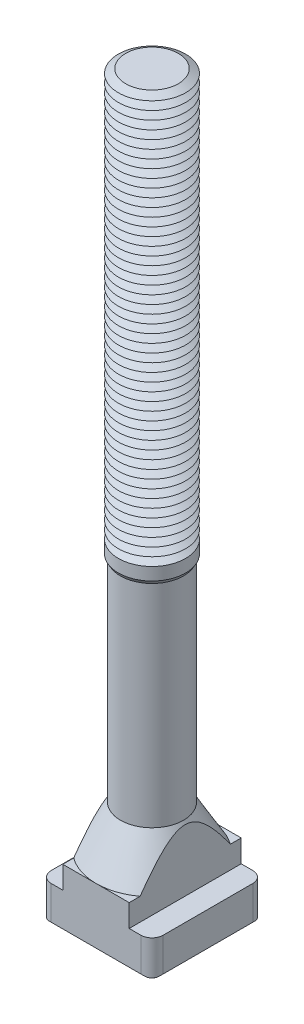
ISO-10303-21;
HEADER;
FILE_DESCRIPTION(('STEP AP214'),'2;1');
FILE_NAME('part.step','',(''),(''),'','','');
FILE_SCHEMA(('AUTOMOTIVE_DESIGN { 1 0 10303 214 1 1 1 1 }'));
ENDSEC;
DATA;
#1=APPLICATION_CONTEXT('core data for automotive mechanical design processes');
#2=APPLICATION_PROTOCOL_DEFINITION('international standard','automotive_design',2000,#1);
#3=PRODUCT_CONTEXT('',#1,'mechanical');
#4=PRODUCT('Part','Part','',(#3));
#5=PRODUCT_RELATED_PRODUCT_CATEGORY('part','',(#4));
#6=PRODUCT_DEFINITION_FORMATION('','',#4);
#7=PRODUCT_DEFINITION_CONTEXT('part definition',#1,'design');
#8=PRODUCT_DEFINITION('design','',#6,#7);
#9=PRODUCT_DEFINITION_SHAPE('','',#8);
#10=(LENGTH_UNIT() NAMED_UNIT(*) SI_UNIT(.MILLI.,.METRE.));
#11=(NAMED_UNIT(*) PLANE_ANGLE_UNIT() SI_UNIT($,.RADIAN.));
#12=(NAMED_UNIT(*) SI_UNIT($,.STERADIAN.) SOLID_ANGLE_UNIT());
#13=UNCERTAINTY_MEASURE_WITH_UNIT(LENGTH_MEASURE(1.E-05),#10,'distance_accuracy_value','');
#14=(GEOMETRIC_REPRESENTATION_CONTEXT(3) GLOBAL_UNCERTAINTY_ASSIGNED_CONTEXT((#13)) GLOBAL_UNIT_ASSIGNED_CONTEXT((#10,
#11,#12)) REPRESENTATION_CONTEXT('',''));
#15=CARTESIAN_POINT('',(0.,0.,0.));
#16=DIRECTION('',(0.,0.,1.));
#17=DIRECTION('',(1.,0.,0.));
#18=AXIS2_PLACEMENT_3D('',#15,#16,#17);
#19=CARTESIAN_POINT('',(0.,254.,0.));
#20=DIRECTION('',(0.,-1.,0.));
#21=DIRECTION('',(0.,0.,-1.));
#22=AXIS2_PLACEMENT_3D('',#19,#20,#21);
#23=CONICAL_SURFACE('',#22,9.40192378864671,1.0471975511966);
#24=CARTESIAN_POINT('',(0.,252.5,0.));
#25=DIRECTION('',(0.,-1.,0.));
#26=DIRECTION('',(0.,0.,-1.));
#27=AXIS2_PLACEMENT_3D('',#24,#25,#26);
#28=CIRCLE('',#27,12.);
#29=CARTESIAN_POINT('',(0.,252.5,-12.));
#30=VERTEX_POINT('',#29);
#31=EDGE_CURVE('E676',#30,#30,#28,.T.);
#32=ORIENTED_EDGE('',*,*,#31,.F.);
#33=EDGE_LOOP('',(#32));
#34=FACE_BOUND('',#33,.T.);
#35=CARTESIAN_POINT('',(0.,254.,0.));
#36=DIRECTION('',(0.,-1.,0.));
#37=DIRECTION('',(0.,0.,-1.));
#38=AXIS2_PLACEMENT_3D('',#35,#36,#37);
#39=CIRCLE('',#38,9.40192378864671);
#40=CARTESIAN_POINT('',(0.,254.,-9.40192378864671));
#41=VERTEX_POINT('',#40);
#42=EDGE_CURVE('E678',#41,#41,#39,.T.);
#43=ORIENTED_EDGE('',*,*,#42,.T.);
#44=EDGE_LOOP('',(#43));
#45=FACE_BOUND('',#44,.T.);
#46=ADVANCED_FACE('F39',(#34,#45),#23,.T.);
#47=CARTESIAN_POINT('',(0.,255.5,0.));
#48=DIRECTION('',(0.,1.,0.));
#49=DIRECTION('',(0.,0.,1.));
#50=AXIS2_PLACEMENT_3D('',#47,#48,#49);
#51=CONICAL_SURFACE('',#50,12.,1.0471975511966);
#52=ORIENTED_EDGE('',*,*,#42,.F.);
#53=EDGE_LOOP('',(#52));
#54=FACE_BOUND('',#53,.T.);
#55=CARTESIAN_POINT('',(0.,255.5,0.));
#56=DIRECTION('',(0.,-1.,0.));
#57=DIRECTION('',(0.,0.,-1.));
#58=AXIS2_PLACEMENT_3D('',#55,#56,#57);
#59=CIRCLE('',#58,12.);
#60=CARTESIAN_POINT('',(0.,255.5,-12.));
#61=VERTEX_POINT('',#60);
#62=EDGE_CURVE('E632',#61,#61,#59,.T.);
#63=ORIENTED_EDGE('',*,*,#62,.T.);
#64=EDGE_LOOP('',(#63));
#65=FACE_BOUND('',#64,.T.);
#66=ADVANCED_FACE('F448',(#54,#65),#51,.T.);
#67=CARTESIAN_POINT('',(5.5651901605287,266.,0.));
#68=DIRECTION('',(0.,-1.,0.));
#69=DIRECTION('',(1.,0.,0.));
#70=AXIS2_PLACEMENT_3D('',#67,#68,#69);
#71=PLANE('',#70);
#72=CARTESIAN_POINT('',(0.,266.,0.));
#73=DIRECTION('',(0.,-1.,0.));
#74=DIRECTION('',(0.,0.,-1.));
#75=AXIS2_PLACEMENT_3D('',#72,#73,#74);
#76=CIRCLE('',#75,9.40192378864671);
#77=CARTESIAN_POINT('',(0.,266.,-9.40192378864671));
#78=VERTEX_POINT('',#77);
#79=EDGE_CURVE('E814',#78,#78,#76,.T.);
#80=ORIENTED_EDGE('',*,*,#79,.F.);
#81=EDGE_LOOP('',(#80));
#82=FACE_BOUND('',#81,.T.);
#83=ADVANCED_FACE('F454',(#82),#71,.F.);
#84=CARTESIAN_POINT('',(0.,266.,0.));
#85=DIRECTION('',(0.,-1.,0.));
#86=DIRECTION('',(0.,0.,-1.));
#87=AXIS2_PLACEMENT_3D('',#84,#85,#86);
#88=CONICAL_SURFACE('',#87,9.40192378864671,1.0471975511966);
#89=CARTESIAN_POINT('',(0.,264.5,0.));
#90=DIRECTION('',(0.,-1.,0.));
#91=DIRECTION('',(0.,0.,-1.));
#92=AXIS2_PLACEMENT_3D('',#89,#90,#91);
#93=CIRCLE('',#92,12.);
#94=CARTESIAN_POINT('',(0.,264.5,-12.));
#95=VERTEX_POINT('',#94);
#96=EDGE_CURVE('E810',#95,#95,#93,.T.);
#97=ORIENTED_EDGE('',*,*,#96,.F.);
#98=EDGE_LOOP('',(#97));
#99=FACE_BOUND('',#98,.T.);
#100=ORIENTED_EDGE('',*,*,#79,.T.);
#101=EDGE_LOOP('',(#100));
#102=FACE_BOUND('',#101,.T.);
#103=ADVANCED_FACE('F482',(#99,#102),#88,.T.);
#104=CARTESIAN_POINT('',(0.,264.5,0.));
#105=DIRECTION('',(0.,1.,0.));
#106=DIRECTION('',(0.,0.,1.));
#107=AXIS2_PLACEMENT_3D('',#104,#105,#106);
#108=CONICAL_SURFACE('',#107,12.,1.0471975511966);
#109=CARTESIAN_POINT('',(0.,263.,0.));
#110=DIRECTION('',(0.,-1.,0.));
#111=DIRECTION('',(0.,0.,-1.));
#112=AXIS2_PLACEMENT_3D('',#109,#110,#111);
#113=CIRCLE('',#112,9.40192378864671);
#114=CARTESIAN_POINT('',(0.,263.,-9.40192378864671));
#115=VERTEX_POINT('',#114);
#116=EDGE_CURVE('E807',#115,#115,#113,.T.);
#117=ORIENTED_EDGE('',*,*,#116,.F.);
#118=EDGE_LOOP('',(#117));
#119=FACE_BOUND('',#118,.T.);
#120=ORIENTED_EDGE('',*,*,#96,.T.);
#121=EDGE_LOOP('',(#120));
#122=FACE_BOUND('',#121,.T.);
#123=ADVANCED_FACE('F479',(#119,#122),#108,.T.);
#124=CARTESIAN_POINT('',(0.,263.,0.));
#125=DIRECTION('',(0.,-1.,0.));
#126=DIRECTION('',(0.,0.,-1.));
#127=AXIS2_PLACEMENT_3D('',#124,#125,#126);
#128=CONICAL_SURFACE('',#127,9.40192378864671,1.0471975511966);
#129=CARTESIAN_POINT('',(0.,261.5,0.));
#130=DIRECTION('',(0.,-1.,0.));
#131=DIRECTION('',(0.,0.,-1.));
#132=AXIS2_PLACEMENT_3D('',#129,#130,#131);
#133=CIRCLE('',#132,12.);
#134=CARTESIAN_POINT('',(0.,261.5,-12.));
#135=VERTEX_POINT('',#134);
#136=EDGE_CURVE('E803',#135,#135,#133,.T.);
#137=ORIENTED_EDGE('',*,*,#136,.F.);
#138=EDGE_LOOP('',(#137));
#139=FACE_BOUND('',#138,.T.);
#140=ORIENTED_EDGE('',*,*,#116,.T.);
#141=EDGE_LOOP('',(#140));
#142=FACE_BOUND('',#141,.T.);
#143=ADVANCED_FACE('F474',(#139,#142),#128,.T.);
#144=CARTESIAN_POINT('',(0.,261.5,0.));
#145=DIRECTION('',(0.,1.,0.));
#146=DIRECTION('',(0.,0.,1.));
#147=AXIS2_PLACEMENT_3D('',#144,#145,#146);
#148=CONICAL_SURFACE('',#147,12.,1.0471975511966);
#149=CARTESIAN_POINT('',(0.,260.,0.));
#150=DIRECTION('',(0.,-1.,0.));
#151=DIRECTION('',(0.,0.,-1.));
#152=AXIS2_PLACEMENT_3D('',#149,#150,#151);
#153=CIRCLE('',#152,9.40192378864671);
#154=CARTESIAN_POINT('',(0.,260.,-9.40192378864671));
#155=VERTEX_POINT('',#154);
#156=EDGE_CURVE('E799',#155,#155,#153,.T.);
#157=ORIENTED_EDGE('',*,*,#156,.F.);
#158=EDGE_LOOP('',(#157));
#159=FACE_BOUND('',#158,.T.);
#160=ORIENTED_EDGE('',*,*,#136,.T.);
#161=EDGE_LOOP('',(#160));
#162=FACE_BOUND('',#161,.T.);
#163=ADVANCED_FACE('F471',(#159,#162),#148,.T.);
#164=CARTESIAN_POINT('',(0.,260.,0.));
#165=DIRECTION('',(0.,-1.,0.));
#166=DIRECTION('',(0.,0.,-1.));
#167=AXIS2_PLACEMENT_3D('',#164,#165,#166);
#168=CONICAL_SURFACE('',#167,9.40192378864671,1.0471975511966);
#169=CARTESIAN_POINT('',(0.,258.5,0.));
#170=DIRECTION('',(0.,-1.,0.));
#171=DIRECTION('',(0.,0.,-1.));
#172=AXIS2_PLACEMENT_3D('',#169,#170,#171);
#173=CIRCLE('',#172,12.);
#174=CARTESIAN_POINT('',(0.,258.5,-12.));
#175=VERTEX_POINT('',#174);
#176=EDGE_CURVE('E795',#175,#175,#173,.T.);
#177=ORIENTED_EDGE('',*,*,#176,.F.);
#178=EDGE_LOOP('',(#177));
#179=FACE_BOUND('',#178,.T.);
#180=ORIENTED_EDGE('',*,*,#156,.T.);
#181=EDGE_LOOP('',(#180));
#182=FACE_BOUND('',#181,.T.);
#183=ADVANCED_FACE('F465',(#179,#182),#168,.T.);
#184=CARTESIAN_POINT('',(0.,258.5,0.));
#185=DIRECTION('',(0.,1.,0.));
#186=DIRECTION('',(0.,0.,1.));
#187=AXIS2_PLACEMENT_3D('',#184,#185,#186);
#188=CONICAL_SURFACE('',#187,12.,1.0471975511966);
#189=CARTESIAN_POINT('',(0.,257.,0.));
#190=DIRECTION('',(0.,-1.,0.));
#191=DIRECTION('',(0.,0.,-1.));
#192=AXIS2_PLACEMENT_3D('',#189,#190,#191);
#193=CIRCLE('',#192,9.40192378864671);
#194=CARTESIAN_POINT('',(0.,257.,-9.40192378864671));
#195=VERTEX_POINT('',#194);
#196=EDGE_CURVE('E791',#195,#195,#193,.T.);
#197=ORIENTED_EDGE('',*,*,#196,.F.);
#198=EDGE_LOOP('',(#197));
#199=FACE_BOUND('',#198,.T.);
#200=ORIENTED_EDGE('',*,*,#176,.T.);
#201=EDGE_LOOP('',(#200));
#202=FACE_BOUND('',#201,.T.);
#203=ADVANCED_FACE('F461',(#199,#202),#188,.T.);
#204=CARTESIAN_POINT('',(0.,257.,0.));
#205=DIRECTION('',(0.,-1.,0.));
#206=DIRECTION('',(0.,0.,-1.));
#207=AXIS2_PLACEMENT_3D('',#204,#205,#206);
#208=CONICAL_SURFACE('',#207,9.40192378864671,1.0471975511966);
#209=ORIENTED_EDGE('',*,*,#62,.F.);
#210=EDGE_LOOP('',(#209));
#211=FACE_BOUND('',#210,.T.);
#212=ORIENTED_EDGE('',*,*,#196,.T.);
#213=EDGE_LOOP('',(#212));
#214=FACE_BOUND('',#213,.T.);
#215=ADVANCED_FACE('F464',(#211,#214),#208,.T.);
#216=CARTESIAN_POINT('',(0.,251.,0.));
#217=DIRECTION('',(0.,-1.,0.));
#218=DIRECTION('',(0.,0.,-1.));
#219=AXIS2_PLACEMENT_3D('',#216,#217,#218);
#220=CONICAL_SURFACE('',#219,9.40192378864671,1.0471975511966);
#221=CARTESIAN_POINT('',(0.,249.5,0.));
#222=DIRECTION('',(0.,-1.,0.));
#223=DIRECTION('',(0.,0.,-1.));
#224=AXIS2_PLACEMENT_3D('',#221,#222,#223);
#225=CIRCLE('',#224,12.);
#226=CARTESIAN_POINT('',(0.,249.5,-12.));
#227=VERTEX_POINT('',#226);
#228=EDGE_CURVE('E780',#227,#227,#225,.T.);
#229=ORIENTED_EDGE('',*,*,#228,.F.);
#230=EDGE_LOOP('',(#229));
#231=FACE_BOUND('',#230,.T.);
#232=CARTESIAN_POINT('',(0.,251.,0.));
#233=DIRECTION('',(0.,-1.,0.));
#234=DIRECTION('',(0.,0.,-1.));
#235=AXIS2_PLACEMENT_3D('',#232,#233,#234);
#236=CIRCLE('',#235,9.40192378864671);
#237=CARTESIAN_POINT('',(0.,251.,-9.40192378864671));
#238=VERTEX_POINT('',#237);
#239=EDGE_CURVE('E679',#238,#238,#236,.T.);
#240=ORIENTED_EDGE('',*,*,#239,.T.);
#241=EDGE_LOOP('',(#240));
#242=FACE_BOUND('',#241,.T.);
#243=ADVANCED_FACE('F469',(#231,#242),#220,.T.);
#244=CARTESIAN_POINT('',(0.,252.5,0.));
#245=DIRECTION('',(0.,1.,0.));
#246=DIRECTION('',(0.,0.,1.));
#247=AXIS2_PLACEMENT_3D('',#244,#245,#246);
#248=CONICAL_SURFACE('',#247,12.,1.0471975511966);
#249=ORIENTED_EDGE('',*,*,#239,.F.);
#250=EDGE_LOOP('',(#249));
#251=FACE_BOUND('',#250,.T.);
#252=ORIENTED_EDGE('',*,*,#31,.T.);
#253=EDGE_LOOP('',(#252));
#254=FACE_BOUND('',#253,.T.);
#255=ADVANCED_FACE('F1078',(#251,#254),#248,.T.);
#256=CARTESIAN_POINT('',(0.,248.,0.));
#257=DIRECTION('',(0.,-1.,0.));
#258=DIRECTION('',(0.,0.,-1.));
#259=AXIS2_PLACEMENT_3D('',#256,#257,#258);
#260=CONICAL_SURFACE('',#259,9.40192378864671,1.0471975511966);
#261=CARTESIAN_POINT('',(0.,246.5,0.));
#262=DIRECTION('',(0.,-1.,0.));
#263=DIRECTION('',(0.,0.,-1.));
#264=AXIS2_PLACEMENT_3D('',#261,#262,#263);
#265=CIRCLE('',#264,12.);
#266=CARTESIAN_POINT('',(0.,246.5,-12.));
#267=VERTEX_POINT('',#266);
#268=EDGE_CURVE('E772',#267,#267,#265,.T.);
#269=ORIENTED_EDGE('',*,*,#268,.F.);
#270=EDGE_LOOP('',(#269));
#271=FACE_BOUND('',#270,.T.);
#272=CARTESIAN_POINT('',(0.,248.,0.));
#273=DIRECTION('',(0.,-1.,0.));
#274=DIRECTION('',(0.,0.,-1.));
#275=AXIS2_PLACEMENT_3D('',#272,#273,#274);
#276=CIRCLE('',#275,9.40192378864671);
#277=CARTESIAN_POINT('',(0.,248.,-9.40192378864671));
#278=VERTEX_POINT('',#277);
#279=EDGE_CURVE('E776',#278,#278,#276,.T.);
#280=ORIENTED_EDGE('',*,*,#279,.T.);
#281=EDGE_LOOP('',(#280));
#282=FACE_BOUND('',#281,.T.);
#283=ADVANCED_FACE('F1074',(#271,#282),#260,.T.);
#284=CARTESIAN_POINT('',(0.,249.5,0.));
#285=DIRECTION('',(0.,1.,0.));
#286=DIRECTION('',(0.,0.,1.));
#287=AXIS2_PLACEMENT_3D('',#284,#285,#286);
#288=CONICAL_SURFACE('',#287,12.,1.0471975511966);
#289=ORIENTED_EDGE('',*,*,#279,.F.);
#290=EDGE_LOOP('',(#289));
#291=FACE_BOUND('',#290,.T.);
#292=ORIENTED_EDGE('',*,*,#228,.T.);
#293=EDGE_LOOP('',(#292));
#294=FACE_BOUND('',#293,.T.);
#295=ADVANCED_FACE('F1070',(#291,#294),#288,.T.);
#296=CARTESIAN_POINT('',(0.,245.,0.));
#297=DIRECTION('',(0.,-1.,0.));
#298=DIRECTION('',(0.,0.,-1.));
#299=AXIS2_PLACEMENT_3D('',#296,#297,#298);
#300=CONICAL_SURFACE('',#299,9.40192378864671,1.0471975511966);
#301=CARTESIAN_POINT('',(0.,243.5,0.));
#302=DIRECTION('',(0.,-1.,0.));
#303=DIRECTION('',(0.,0.,-1.));
#304=AXIS2_PLACEMENT_3D('',#301,#302,#303);
#305=CIRCLE('',#304,12.);
#306=CARTESIAN_POINT('',(0.,243.5,-12.));
#307=VERTEX_POINT('',#306);
#308=EDGE_CURVE('E764',#307,#307,#305,.T.);
#309=ORIENTED_EDGE('',*,*,#308,.F.);
#310=EDGE_LOOP('',(#309));
#311=FACE_BOUND('',#310,.T.);
#312=CARTESIAN_POINT('',(0.,245.,0.));
#313=DIRECTION('',(0.,-1.,0.));
#314=DIRECTION('',(0.,0.,-1.));
#315=AXIS2_PLACEMENT_3D('',#312,#313,#314);
#316=CIRCLE('',#315,9.40192378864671);
#317=CARTESIAN_POINT('',(0.,245.,-9.40192378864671));
#318=VERTEX_POINT('',#317);
#319=EDGE_CURVE('E768',#318,#318,#316,.T.);
#320=ORIENTED_EDGE('',*,*,#319,.T.);
#321=EDGE_LOOP('',(#320));
#322=FACE_BOUND('',#321,.T.);
#323=ADVANCED_FACE('F1066',(#311,#322),#300,.T.);
#324=CARTESIAN_POINT('',(0.,246.5,0.));
#325=DIRECTION('',(0.,1.,0.));
#326=DIRECTION('',(0.,0.,1.));
#327=AXIS2_PLACEMENT_3D('',#324,#325,#326);
#328=CONICAL_SURFACE('',#327,12.,1.0471975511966);
#329=ORIENTED_EDGE('',*,*,#319,.F.);
#330=EDGE_LOOP('',(#329));
#331=FACE_BOUND('',#330,.T.);
#332=ORIENTED_EDGE('',*,*,#268,.T.);
#333=EDGE_LOOP('',(#332));
#334=FACE_BOUND('',#333,.T.);
#335=ADVANCED_FACE('F1062',(#331,#334),#328,.T.);
#336=CARTESIAN_POINT('',(0.,242.,0.));
#337=DIRECTION('',(0.,-1.,0.));
#338=DIRECTION('',(0.,0.,-1.));
#339=AXIS2_PLACEMENT_3D('',#336,#337,#338);
#340=CONICAL_SURFACE('',#339,9.40192378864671,1.0471975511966);
#341=CARTESIAN_POINT('',(0.,240.5,0.));
#342=DIRECTION('',(0.,-1.,0.));
#343=DIRECTION('',(0.,0.,-1.));
#344=AXIS2_PLACEMENT_3D('',#341,#342,#343);
#345=CIRCLE('',#344,12.);
#346=CARTESIAN_POINT('',(0.,240.5,-12.));
#347=VERTEX_POINT('',#346);
#348=EDGE_CURVE('E673',#347,#347,#345,.T.);
#349=ORIENTED_EDGE('',*,*,#348,.F.);
#350=EDGE_LOOP('',(#349));
#351=FACE_BOUND('',#350,.T.);
#352=CARTESIAN_POINT('',(0.,242.,0.));
#353=DIRECTION('',(0.,-1.,0.));
#354=DIRECTION('',(0.,0.,-1.));
#355=AXIS2_PLACEMENT_3D('',#352,#353,#354);
#356=CIRCLE('',#355,9.40192378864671);
#357=CARTESIAN_POINT('',(0.,242.,-9.40192378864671));
#358=VERTEX_POINT('',#357);
#359=EDGE_CURVE('E760',#358,#358,#356,.T.);
#360=ORIENTED_EDGE('',*,*,#359,.T.);
#361=EDGE_LOOP('',(#360));
#362=FACE_BOUND('',#361,.T.);
#363=ADVANCED_FACE('F1058',(#351,#362),#340,.T.);
#364=CARTESIAN_POINT('',(0.,243.5,0.));
#365=DIRECTION('',(0.,1.,0.));
#366=DIRECTION('',(0.,0.,1.));
#367=AXIS2_PLACEMENT_3D('',#364,#365,#366);
#368=CONICAL_SURFACE('',#367,12.,1.0471975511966);
#369=ORIENTED_EDGE('',*,*,#359,.F.);
#370=EDGE_LOOP('',(#369));
#371=FACE_BOUND('',#370,.T.);
#372=ORIENTED_EDGE('',*,*,#308,.T.);
#373=EDGE_LOOP('',(#372));
#374=FACE_BOUND('',#373,.T.);
#375=ADVANCED_FACE('F1054',(#371,#374),#368,.T.);
#376=CARTESIAN_POINT('',(0.,239.,0.));
#377=DIRECTION('',(0.,-1.,0.));
#378=DIRECTION('',(0.,0.,-1.));
#379=AXIS2_PLACEMENT_3D('',#376,#377,#378);
#380=CONICAL_SURFACE('',#379,9.40192378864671,1.0471975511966);
#381=CARTESIAN_POINT('',(0.,237.5,0.));
#382=DIRECTION('',(0.,-1.,0.));
#383=DIRECTION('',(0.,0.,-1.));
#384=AXIS2_PLACEMENT_3D('',#381,#382,#383);
#385=CIRCLE('',#384,12.);
#386=CARTESIAN_POINT('',(0.,237.5,-12.));
#387=VERTEX_POINT('',#386);
#388=EDGE_CURVE('E674',#387,#387,#385,.T.);
#389=ORIENTED_EDGE('',*,*,#388,.F.);
#390=EDGE_LOOP('',(#389));
#391=FACE_BOUND('',#390,.T.);
#392=CARTESIAN_POINT('',(0.,239.,0.));
#393=DIRECTION('',(0.,-1.,0.));
#394=DIRECTION('',(0.,0.,-1.));
#395=AXIS2_PLACEMENT_3D('',#392,#393,#394);
#396=CIRCLE('',#395,9.40192378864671);
#397=CARTESIAN_POINT('',(0.,239.,-9.40192378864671));
#398=VERTEX_POINT('',#397);
#399=EDGE_CURVE('E670',#398,#398,#396,.T.);
#400=ORIENTED_EDGE('',*,*,#399,.T.);
#401=EDGE_LOOP('',(#400));
#402=FACE_BOUND('',#401,.T.);
#403=ADVANCED_FACE('F1050',(#391,#402),#380,.T.);
#404=CARTESIAN_POINT('',(0.,240.5,0.));
#405=DIRECTION('',(0.,1.,0.));
#406=DIRECTION('',(0.,0.,1.));
#407=AXIS2_PLACEMENT_3D('',#404,#405,#406);
#408=CONICAL_SURFACE('',#407,12.,1.0471975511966);
#409=ORIENTED_EDGE('',*,*,#399,.F.);
#410=EDGE_LOOP('',(#409));
#411=FACE_BOUND('',#410,.T.);
#412=ORIENTED_EDGE('',*,*,#348,.T.);
#413=EDGE_LOOP('',(#412));
#414=FACE_BOUND('',#413,.T.);
#415=ADVANCED_FACE('F1046',(#411,#414),#408,.T.);
#416=CARTESIAN_POINT('',(0.,236.,0.));
#417=DIRECTION('',(0.,-1.,0.));
#418=DIRECTION('',(0.,0.,-1.));
#419=AXIS2_PLACEMENT_3D('',#416,#417,#418);
#420=CONICAL_SURFACE('',#419,9.40192378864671,1.0471975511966);
#421=CARTESIAN_POINT('',(0.,234.5,0.));
#422=DIRECTION('',(0.,-1.,0.));
#423=DIRECTION('',(0.,0.,-1.));
#424=AXIS2_PLACEMENT_3D('',#421,#422,#423);
#425=CIRCLE('',#424,12.);
#426=CARTESIAN_POINT('',(0.,234.5,-12.));
#427=VERTEX_POINT('',#426);
#428=EDGE_CURVE('E746',#427,#427,#425,.T.);
#429=ORIENTED_EDGE('',*,*,#428,.F.);
#430=EDGE_LOOP('',(#429));
#431=FACE_BOUND('',#430,.T.);
#432=CARTESIAN_POINT('',(0.,236.,0.));
#433=DIRECTION('',(0.,-1.,0.));
#434=DIRECTION('',(0.,0.,-1.));
#435=AXIS2_PLACEMENT_3D('',#432,#433,#434);
#436=CIRCLE('',#435,9.40192378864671);
#437=CARTESIAN_POINT('',(0.,236.,-9.40192378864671));
#438=VERTEX_POINT('',#437);
#439=EDGE_CURVE('E750',#438,#438,#436,.T.);
#440=ORIENTED_EDGE('',*,*,#439,.T.);
#441=EDGE_LOOP('',(#440));
#442=FACE_BOUND('',#441,.T.);
#443=ADVANCED_FACE('F1042',(#431,#442),#420,.T.);
#444=CARTESIAN_POINT('',(0.,237.5,0.));
#445=DIRECTION('',(0.,1.,0.));
#446=DIRECTION('',(0.,0.,1.));
#447=AXIS2_PLACEMENT_3D('',#444,#445,#446);
#448=CONICAL_SURFACE('',#447,12.,1.0471975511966);
#449=ORIENTED_EDGE('',*,*,#439,.F.);
#450=EDGE_LOOP('',(#449));
#451=FACE_BOUND('',#450,.T.);
#452=ORIENTED_EDGE('',*,*,#388,.T.);
#453=EDGE_LOOP('',(#452));
#454=FACE_BOUND('',#453,.T.);
#455=ADVANCED_FACE('F1038',(#451,#454),#448,.T.);
#456=CARTESIAN_POINT('',(0.,233.,0.));
#457=DIRECTION('',(0.,-1.,0.));
#458=DIRECTION('',(0.,0.,-1.));
#459=AXIS2_PLACEMENT_3D('',#456,#457,#458);
#460=CONICAL_SURFACE('',#459,9.40192378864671,1.0471975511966);
#461=CARTESIAN_POINT('',(0.,231.5,0.));
#462=DIRECTION('',(0.,-1.,0.));
#463=DIRECTION('',(0.,0.,-1.));
#464=AXIS2_PLACEMENT_3D('',#461,#462,#463);
#465=CIRCLE('',#464,12.);
#466=CARTESIAN_POINT('',(0.,231.5,-12.));
#467=VERTEX_POINT('',#466);
#468=EDGE_CURVE('E738',#467,#467,#465,.T.);
#469=ORIENTED_EDGE('',*,*,#468,.F.);
#470=EDGE_LOOP('',(#469));
#471=FACE_BOUND('',#470,.T.);
#472=CARTESIAN_POINT('',(0.,233.,0.));
#473=DIRECTION('',(0.,-1.,0.));
#474=DIRECTION('',(0.,0.,-1.));
#475=AXIS2_PLACEMENT_3D('',#472,#473,#474);
#476=CIRCLE('',#475,9.40192378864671);
#477=CARTESIAN_POINT('',(0.,233.,-9.40192378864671));
#478=VERTEX_POINT('',#477);
#479=EDGE_CURVE('E742',#478,#478,#476,.T.);
#480=ORIENTED_EDGE('',*,*,#479,.T.);
#481=EDGE_LOOP('',(#480));
#482=FACE_BOUND('',#481,.T.);
#483=ADVANCED_FACE('F1034',(#471,#482),#460,.T.);
#484=CARTESIAN_POINT('',(0.,234.5,0.));
#485=DIRECTION('',(0.,1.,0.));
#486=DIRECTION('',(0.,0.,1.));
#487=AXIS2_PLACEMENT_3D('',#484,#485,#486);
#488=CONICAL_SURFACE('',#487,12.,1.0471975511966);
#489=ORIENTED_EDGE('',*,*,#479,.F.);
#490=EDGE_LOOP('',(#489));
#491=FACE_BOUND('',#490,.T.);
#492=ORIENTED_EDGE('',*,*,#428,.T.);
#493=EDGE_LOOP('',(#492));
#494=FACE_BOUND('',#493,.T.);
#495=ADVANCED_FACE('F1030',(#491,#494),#488,.T.);
#496=CARTESIAN_POINT('',(0.,230.,0.));
#497=DIRECTION('',(0.,-1.,0.));
#498=DIRECTION('',(0.,0.,-1.));
#499=AXIS2_PLACEMENT_3D('',#496,#497,#498);
#500=CONICAL_SURFACE('',#499,9.40192378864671,1.0471975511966);
#501=CARTESIAN_POINT('',(0.,228.5,0.));
#502=DIRECTION('',(0.,-1.,0.));
#503=DIRECTION('',(0.,0.,-1.));
#504=AXIS2_PLACEMENT_3D('',#501,#502,#503);
#505=CIRCLE('',#504,12.);
#506=CARTESIAN_POINT('',(0.,228.5,-12.));
#507=VERTEX_POINT('',#506);
#508=EDGE_CURVE('E730',#507,#507,#505,.T.);
#509=ORIENTED_EDGE('',*,*,#508,.F.);
#510=EDGE_LOOP('',(#509));
#511=FACE_BOUND('',#510,.T.);
#512=CARTESIAN_POINT('',(0.,230.,0.));
#513=DIRECTION('',(0.,-1.,0.));
#514=DIRECTION('',(0.,0.,-1.));
#515=AXIS2_PLACEMENT_3D('',#512,#513,#514);
#516=CIRCLE('',#515,9.40192378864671);
#517=CARTESIAN_POINT('',(0.,230.,-9.40192378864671));
#518=VERTEX_POINT('',#517);
#519=EDGE_CURVE('E734',#518,#518,#516,.T.);
#520=ORIENTED_EDGE('',*,*,#519,.T.);
#521=EDGE_LOOP('',(#520));
#522=FACE_BOUND('',#521,.T.);
#523=ADVANCED_FACE('F1026',(#511,#522),#500,.T.);
#524=CARTESIAN_POINT('',(0.,231.5,0.));
#525=DIRECTION('',(0.,1.,0.));
#526=DIRECTION('',(0.,0.,1.));
#527=AXIS2_PLACEMENT_3D('',#524,#525,#526);
#528=CONICAL_SURFACE('',#527,12.,1.0471975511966);
#529=ORIENTED_EDGE('',*,*,#519,.F.);
#530=EDGE_LOOP('',(#529));
#531=FACE_BOUND('',#530,.T.);
#532=ORIENTED_EDGE('',*,*,#468,.T.);
#533=EDGE_LOOP('',(#532));
#534=FACE_BOUND('',#533,.T.);
#535=ADVANCED_FACE('F1022',(#531,#534),#528,.T.);
#536=CARTESIAN_POINT('',(0.,227.,0.));
#537=DIRECTION('',(0.,-1.,0.));
#538=DIRECTION('',(0.,0.,-1.));
#539=AXIS2_PLACEMENT_3D('',#536,#537,#538);
#540=CONICAL_SURFACE('',#539,9.40192378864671,1.0471975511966);
#541=CARTESIAN_POINT('',(0.,225.5,0.));
#542=DIRECTION('',(0.,-1.,0.));
#543=DIRECTION('',(0.,0.,-1.));
#544=AXIS2_PLACEMENT_3D('',#541,#542,#543);
#545=CIRCLE('',#544,12.);
#546=CARTESIAN_POINT('',(0.,225.5,-12.));
#547=VERTEX_POINT('',#546);
#548=EDGE_CURVE('E667',#547,#547,#545,.T.);
#549=ORIENTED_EDGE('',*,*,#548,.F.);
#550=EDGE_LOOP('',(#549));
#551=FACE_BOUND('',#550,.T.);
#552=CARTESIAN_POINT('',(0.,227.,0.));
#553=DIRECTION('',(0.,-1.,0.));
#554=DIRECTION('',(0.,0.,-1.));
#555=AXIS2_PLACEMENT_3D('',#552,#553,#554);
#556=CIRCLE('',#555,9.40192378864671);
#557=CARTESIAN_POINT('',(0.,227.,-9.40192378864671));
#558=VERTEX_POINT('',#557);
#559=EDGE_CURVE('E726',#558,#558,#556,.T.);
#560=ORIENTED_EDGE('',*,*,#559,.T.);
#561=EDGE_LOOP('',(#560));
#562=FACE_BOUND('',#561,.T.);
#563=ADVANCED_FACE('F1018',(#551,#562),#540,.T.);
#564=CARTESIAN_POINT('',(0.,228.5,0.));
#565=DIRECTION('',(0.,1.,0.));
#566=DIRECTION('',(0.,0.,1.));
#567=AXIS2_PLACEMENT_3D('',#564,#565,#566);
#568=CONICAL_SURFACE('',#567,12.,1.0471975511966);
#569=ORIENTED_EDGE('',*,*,#559,.F.);
#570=EDGE_LOOP('',(#569));
#571=FACE_BOUND('',#570,.T.);
#572=ORIENTED_EDGE('',*,*,#508,.T.);
#573=EDGE_LOOP('',(#572));
#574=FACE_BOUND('',#573,.T.);
#575=ADVANCED_FACE('F1014',(#571,#574),#568,.T.);
#576=CARTESIAN_POINT('',(0.,224.,0.));
#577=DIRECTION('',(0.,-1.,0.));
#578=DIRECTION('',(0.,0.,-1.));
#579=AXIS2_PLACEMENT_3D('',#576,#577,#578);
#580=CONICAL_SURFACE('',#579,9.40192378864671,1.0471975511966);
#581=CARTESIAN_POINT('',(0.,222.5,0.));
#582=DIRECTION('',(0.,-1.,0.));
#583=DIRECTION('',(0.,0.,-1.));
#584=AXIS2_PLACEMENT_3D('',#581,#582,#583);
#585=CIRCLE('',#584,12.);
#586=CARTESIAN_POINT('',(0.,222.5,-12.));
#587=VERTEX_POINT('',#586);
#588=EDGE_CURVE('E668',#587,#587,#585,.T.);
#589=ORIENTED_EDGE('',*,*,#588,.F.);
#590=EDGE_LOOP('',(#589));
#591=FACE_BOUND('',#590,.T.);
#592=CARTESIAN_POINT('',(0.,224.,0.));
#593=DIRECTION('',(0.,-1.,0.));
#594=DIRECTION('',(0.,0.,-1.));
#595=AXIS2_PLACEMENT_3D('',#592,#593,#594);
#596=CIRCLE('',#595,9.40192378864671);
#597=CARTESIAN_POINT('',(0.,224.,-9.40192378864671));
#598=VERTEX_POINT('',#597);
#599=EDGE_CURVE('E664',#598,#598,#596,.T.);
#600=ORIENTED_EDGE('',*,*,#599,.T.);
#601=EDGE_LOOP('',(#600));
#602=FACE_BOUND('',#601,.T.);
#603=ADVANCED_FACE('F1010',(#591,#602),#580,.T.);
#604=CARTESIAN_POINT('',(0.,225.5,0.));
#605=DIRECTION('',(0.,1.,0.));
#606=DIRECTION('',(0.,0.,1.));
#607=AXIS2_PLACEMENT_3D('',#604,#605,#606);
#608=CONICAL_SURFACE('',#607,12.,1.0471975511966);
#609=ORIENTED_EDGE('',*,*,#599,.F.);
#610=EDGE_LOOP('',(#609));
#611=FACE_BOUND('',#610,.T.);
#612=ORIENTED_EDGE('',*,*,#548,.T.);
#613=EDGE_LOOP('',(#612));
#614=FACE_BOUND('',#613,.T.);
#615=ADVANCED_FACE('F1006',(#611,#614),#608,.T.);
#616=CARTESIAN_POINT('',(0.,221.,0.));
#617=DIRECTION('',(0.,-1.,0.));
#618=DIRECTION('',(0.,0.,-1.));
#619=AXIS2_PLACEMENT_3D('',#616,#617,#618);
#620=CONICAL_SURFACE('',#619,9.40192378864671,1.0471975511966);
#621=CARTESIAN_POINT('',(0.,219.5,0.));
#622=DIRECTION('',(0.,-1.,0.));
#623=DIRECTION('',(0.,0.,-1.));
#624=AXIS2_PLACEMENT_3D('',#621,#622,#623);
#625=CIRCLE('',#624,12.);
#626=CARTESIAN_POINT('',(0.,219.5,-12.));
#627=VERTEX_POINT('',#626);
#628=EDGE_CURVE('E712',#627,#627,#625,.T.);
#629=ORIENTED_EDGE('',*,*,#628,.F.);
#630=EDGE_LOOP('',(#629));
#631=FACE_BOUND('',#630,.T.);
#632=CARTESIAN_POINT('',(0.,221.,0.));
#633=DIRECTION('',(0.,-1.,0.));
#634=DIRECTION('',(0.,0.,-1.));
#635=AXIS2_PLACEMENT_3D('',#632,#633,#634);
#636=CIRCLE('',#635,9.40192378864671);
#637=CARTESIAN_POINT('',(0.,221.,-9.40192378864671));
#638=VERTEX_POINT('',#637);
#639=EDGE_CURVE('E716',#638,#638,#636,.T.);
#640=ORIENTED_EDGE('',*,*,#639,.T.);
#641=EDGE_LOOP('',(#640));
#642=FACE_BOUND('',#641,.T.);
#643=ADVANCED_FACE('F1002',(#631,#642),#620,.T.);
#644=CARTESIAN_POINT('',(0.,222.5,0.));
#645=DIRECTION('',(0.,1.,0.));
#646=DIRECTION('',(0.,0.,1.));
#647=AXIS2_PLACEMENT_3D('',#644,#645,#646);
#648=CONICAL_SURFACE('',#647,12.,1.0471975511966);
#649=ORIENTED_EDGE('',*,*,#639,.F.);
#650=EDGE_LOOP('',(#649));
#651=FACE_BOUND('',#650,.T.);
#652=ORIENTED_EDGE('',*,*,#588,.T.);
#653=EDGE_LOOP('',(#652));
#654=FACE_BOUND('',#653,.T.);
#655=ADVANCED_FACE('F998',(#651,#654),#648,.T.);
#656=CARTESIAN_POINT('',(0.,218.,0.));
#657=DIRECTION('',(0.,-1.,0.));
#658=DIRECTION('',(0.,0.,-1.));
#659=AXIS2_PLACEMENT_3D('',#656,#657,#658);
#660=CONICAL_SURFACE('',#659,9.40192378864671,1.0471975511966);
#661=CARTESIAN_POINT('',(0.,216.5,0.));
#662=DIRECTION('',(0.,-1.,0.));
#663=DIRECTION('',(0.,0.,-1.));
#664=AXIS2_PLACEMENT_3D('',#661,#662,#663);
#665=CIRCLE('',#664,12.);
#666=CARTESIAN_POINT('',(0.,216.5,-12.));
#667=VERTEX_POINT('',#666);
#668=EDGE_CURVE('E697',#667,#667,#665,.T.);
#669=ORIENTED_EDGE('',*,*,#668,.F.);
#670=EDGE_LOOP('',(#669));
#671=FACE_BOUND('',#670,.T.);
#672=CARTESIAN_POINT('',(0.,218.,0.));
#673=DIRECTION('',(0.,-1.,0.));
#674=DIRECTION('',(0.,0.,-1.));
#675=AXIS2_PLACEMENT_3D('',#672,#673,#674);
#676=CIRCLE('',#675,9.40192378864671);
#677=CARTESIAN_POINT('',(0.,218.,-9.40192378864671));
#678=VERTEX_POINT('',#677);
#679=EDGE_CURVE('E708',#678,#678,#676,.T.);
#680=ORIENTED_EDGE('',*,*,#679,.T.);
#681=EDGE_LOOP('',(#680));
#682=FACE_BOUND('',#681,.T.);
#683=ADVANCED_FACE('F994',(#671,#682),#660,.T.);
#684=CARTESIAN_POINT('',(0.,219.5,0.));
#685=DIRECTION('',(0.,1.,0.));
#686=DIRECTION('',(0.,0.,1.));
#687=AXIS2_PLACEMENT_3D('',#684,#685,#686);
#688=CONICAL_SURFACE('',#687,12.,1.0471975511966);
#689=ORIENTED_EDGE('',*,*,#679,.F.);
#690=EDGE_LOOP('',(#689));
#691=FACE_BOUND('',#690,.T.);
#692=ORIENTED_EDGE('',*,*,#628,.T.);
#693=EDGE_LOOP('',(#692));
#694=FACE_BOUND('',#693,.T.);
#695=ADVANCED_FACE('F990',(#691,#694),#688,.T.);
#696=CARTESIAN_POINT('',(0.,215.,0.));
#697=DIRECTION('',(0.,-1.,0.));
#698=DIRECTION('',(0.,0.,-1.));
#699=AXIS2_PLACEMENT_3D('',#696,#697,#698);
#700=CONICAL_SURFACE('',#699,9.40192378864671,1.0471975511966);
#701=CARTESIAN_POINT('',(0.,213.5,0.));
#702=DIRECTION('',(0.,-1.,0.));
#703=DIRECTION('',(0.,0.,-1.));
#704=AXIS2_PLACEMENT_3D('',#701,#702,#703);
#705=CIRCLE('',#704,12.);
#706=CARTESIAN_POINT('',(0.,213.5,-12.));
#707=VERTEX_POINT('',#706);
#708=EDGE_CURVE('E688',#707,#707,#705,.T.);
#709=ORIENTED_EDGE('',*,*,#708,.F.);
#710=EDGE_LOOP('',(#709));
#711=FACE_BOUND('',#710,.T.);
#712=CARTESIAN_POINT('',(0.,215.,0.));
#713=DIRECTION('',(0.,-1.,0.));
#714=DIRECTION('',(0.,0.,-1.));
#715=AXIS2_PLACEMENT_3D('',#712,#713,#714);
#716=CIRCLE('',#715,9.40192378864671);
#717=CARTESIAN_POINT('',(0.,215.,-9.40192378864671));
#718=VERTEX_POINT('',#717);
#719=EDGE_CURVE('E690',#718,#718,#716,.T.);
#720=ORIENTED_EDGE('',*,*,#719,.T.);
#721=EDGE_LOOP('',(#720));
#722=FACE_BOUND('',#721,.T.);
#723=ADVANCED_FACE('F986',(#711,#722),#700,.T.);
#724=CARTESIAN_POINT('',(0.,216.5,0.));
#725=DIRECTION('',(0.,1.,0.));
#726=DIRECTION('',(0.,0.,1.));
#727=AXIS2_PLACEMENT_3D('',#724,#725,#726);
#728=CONICAL_SURFACE('',#727,12.,1.0471975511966);
#729=ORIENTED_EDGE('',*,*,#719,.F.);
#730=EDGE_LOOP('',(#729));
#731=FACE_BOUND('',#730,.T.);
#732=ORIENTED_EDGE('',*,*,#668,.T.);
#733=EDGE_LOOP('',(#732));
#734=FACE_BOUND('',#733,.T.);
#735=ADVANCED_FACE('F970',(#731,#734),#728,.T.);
#736=CARTESIAN_POINT('',(0.,212.,0.));
#737=DIRECTION('',(0.,-1.,0.));
#738=DIRECTION('',(0.,0.,-1.));
#739=AXIS2_PLACEMENT_3D('',#736,#737,#738);
#740=CONICAL_SURFACE('',#739,9.40192378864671,1.0471975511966);
#741=CARTESIAN_POINT('',(0.,210.5,0.));
#742=DIRECTION('',(0.,-1.,0.));
#743=DIRECTION('',(0.,0.,-1.));
#744=AXIS2_PLACEMENT_3D('',#741,#742,#743);
#745=CIRCLE('',#744,12.);
#746=CARTESIAN_POINT('',(0.,210.5,-12.));
#747=VERTEX_POINT('',#746);
#748=EDGE_CURVE('E701',#747,#747,#745,.T.);
#749=ORIENTED_EDGE('',*,*,#748,.F.);
#750=EDGE_LOOP('',(#749));
#751=FACE_BOUND('',#750,.T.);
#752=CARTESIAN_POINT('',(0.,212.,0.));
#753=DIRECTION('',(0.,-1.,0.));
#754=DIRECTION('',(0.,0.,-1.));
#755=AXIS2_PLACEMENT_3D('',#752,#753,#754);
#756=CIRCLE('',#755,9.40192378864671);
#757=CARTESIAN_POINT('',(0.,212.,-9.40192378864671));
#758=VERTEX_POINT('',#757);
#759=EDGE_CURVE('E691',#758,#758,#756,.T.);
#760=ORIENTED_EDGE('',*,*,#759,.T.);
#761=EDGE_LOOP('',(#760));
#762=FACE_BOUND('',#761,.T.);
#763=ADVANCED_FACE('F966',(#751,#762),#740,.T.);
#764=CARTESIAN_POINT('',(0.,213.5,0.));
#765=DIRECTION('',(0.,1.,0.));
#766=DIRECTION('',(0.,0.,1.));
#767=AXIS2_PLACEMENT_3D('',#764,#765,#766);
#768=CONICAL_SURFACE('',#767,12.,1.0471975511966);
#769=ORIENTED_EDGE('',*,*,#759,.F.);
#770=EDGE_LOOP('',(#769));
#771=FACE_BOUND('',#770,.T.);
#772=ORIENTED_EDGE('',*,*,#708,.T.);
#773=EDGE_LOOP('',(#772));
#774=FACE_BOUND('',#773,.T.);
#775=ADVANCED_FACE('F969',(#771,#774),#768,.T.);
#776=CARTESIAN_POINT('',(0.,209.,0.));
#777=DIRECTION('',(0.,-1.,0.));
#778=DIRECTION('',(0.,0.,-1.));
#779=AXIS2_PLACEMENT_3D('',#776,#777,#778);
#780=CONICAL_SURFACE('',#779,9.40192378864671,1.0471975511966);
#781=CARTESIAN_POINT('',(0.,207.5,0.));
#782=DIRECTION('',(0.,-1.,0.));
#783=DIRECTION('',(0.,0.,-1.));
#784=AXIS2_PLACEMENT_3D('',#781,#782,#783);
#785=CIRCLE('',#784,12.);
#786=CARTESIAN_POINT('',(0.,207.5,-12.));
#787=VERTEX_POINT('',#786);
#788=EDGE_CURVE('E887',#787,#787,#785,.T.);
#789=ORIENTED_EDGE('',*,*,#788,.F.);
#790=EDGE_LOOP('',(#789));
#791=FACE_BOUND('',#790,.T.);
#792=CARTESIAN_POINT('',(0.,209.,0.));
#793=DIRECTION('',(0.,-1.,0.));
#794=DIRECTION('',(0.,0.,-1.));
#795=AXIS2_PLACEMENT_3D('',#792,#793,#794);
#796=CIRCLE('',#795,9.40192378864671);
#797=CARTESIAN_POINT('',(0.,209.,-9.40192378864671));
#798=VERTEX_POINT('',#797);
#799=EDGE_CURVE('E889',#798,#798,#796,.T.);
#800=ORIENTED_EDGE('',*,*,#799,.T.);
#801=EDGE_LOOP('',(#800));
#802=FACE_BOUND('',#801,.T.);
#803=ADVANCED_FACE('F975',(#791,#802),#780,.T.);
#804=CARTESIAN_POINT('',(0.,210.5,0.));
#805=DIRECTION('',(0.,1.,0.));
#806=DIRECTION('',(0.,0.,1.));
#807=AXIS2_PLACEMENT_3D('',#804,#805,#806);
#808=CONICAL_SURFACE('',#807,12.,1.0471975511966);
#809=ORIENTED_EDGE('',*,*,#799,.F.);
#810=EDGE_LOOP('',(#809));
#811=FACE_BOUND('',#810,.T.);
#812=ORIENTED_EDGE('',*,*,#748,.T.);
#813=EDGE_LOOP('',(#812));
#814=FACE_BOUND('',#813,.T.);
#815=ADVANCED_FACE('F964',(#811,#814),#808,.T.);
#816=CARTESIAN_POINT('',(0.,206.,0.));
#817=DIRECTION('',(0.,-1.,0.));
#818=DIRECTION('',(0.,0.,-1.));
#819=AXIS2_PLACEMENT_3D('',#816,#817,#818);
#820=CONICAL_SURFACE('',#819,9.40192378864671,1.0471975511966);
#821=CARTESIAN_POINT('',(0.,204.5,0.));
#822=DIRECTION('',(0.,-1.,0.));
#823=DIRECTION('',(0.,0.,-1.));
#824=AXIS2_PLACEMENT_3D('',#821,#822,#823);
#825=CIRCLE('',#824,12.);
#826=CARTESIAN_POINT('',(0.,204.5,-12.));
#827=VERTEX_POINT('',#826);
#828=EDGE_CURVE('E950',#827,#827,#825,.T.);
#829=ORIENTED_EDGE('',*,*,#828,.F.);
#830=EDGE_LOOP('',(#829));
#831=FACE_BOUND('',#830,.T.);
#832=CARTESIAN_POINT('',(0.,206.,0.));
#833=DIRECTION('',(0.,-1.,0.));
#834=DIRECTION('',(0.,0.,-1.));
#835=AXIS2_PLACEMENT_3D('',#832,#833,#834);
#836=CIRCLE('',#835,9.40192378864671);
#837=CARTESIAN_POINT('',(0.,206.,-9.40192378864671));
#838=VERTEX_POINT('',#837);
#839=EDGE_CURVE('E890',#838,#838,#836,.T.);
#840=ORIENTED_EDGE('',*,*,#839,.T.);
#841=EDGE_LOOP('',(#840));
#842=FACE_BOUND('',#841,.T.);
#843=ADVANCED_FACE('F1186',(#831,#842),#820,.T.);
#844=CARTESIAN_POINT('',(0.,207.5,0.));
#845=DIRECTION('',(0.,1.,0.));
#846=DIRECTION('',(0.,0.,1.));
#847=AXIS2_PLACEMENT_3D('',#844,#845,#846);
#848=CONICAL_SURFACE('',#847,12.,1.0471975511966);
#849=ORIENTED_EDGE('',*,*,#839,.F.);
#850=EDGE_LOOP('',(#849));
#851=FACE_BOUND('',#850,.T.);
#852=ORIENTED_EDGE('',*,*,#788,.T.);
#853=EDGE_LOOP('',(#852));
#854=FACE_BOUND('',#853,.T.);
#855=ADVANCED_FACE('F1194',(#851,#854),#848,.T.);
#856=CARTESIAN_POINT('',(0.,203.,0.));
#857=DIRECTION('',(0.,-1.,0.));
#858=DIRECTION('',(0.,0.,-1.));
#859=AXIS2_PLACEMENT_3D('',#856,#857,#858);
#860=CONICAL_SURFACE('',#859,9.40192378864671,1.0471975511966);
#861=CARTESIAN_POINT('',(0.,201.5,0.));
#862=DIRECTION('',(0.,-1.,0.));
#863=DIRECTION('',(0.,0.,-1.));
#864=AXIS2_PLACEMENT_3D('',#861,#862,#863);
#865=CIRCLE('',#864,12.);
#866=CARTESIAN_POINT('',(0.,201.5,-12.));
#867=VERTEX_POINT('',#866);
#868=EDGE_CURVE('E851',#867,#867,#865,.T.);
#869=ORIENTED_EDGE('',*,*,#868,.F.);
#870=EDGE_LOOP('',(#869));
#871=FACE_BOUND('',#870,.T.);
#872=CARTESIAN_POINT('',(0.,203.,0.));
#873=DIRECTION('',(0.,-1.,0.));
#874=DIRECTION('',(0.,0.,-1.));
#875=AXIS2_PLACEMENT_3D('',#872,#873,#874);
#876=CIRCLE('',#875,9.40192378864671);
#877=CARTESIAN_POINT('',(0.,203.,-9.40192378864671));
#878=VERTEX_POINT('',#877);
#879=EDGE_CURVE('E853',#878,#878,#876,.T.);
#880=ORIENTED_EDGE('',*,*,#879,.T.);
#881=EDGE_LOOP('',(#880));
#882=FACE_BOUND('',#881,.T.);
#883=ADVANCED_FACE('F1203',(#871,#882),#860,.T.);
#884=CARTESIAN_POINT('',(0.,204.5,0.));
#885=DIRECTION('',(0.,1.,0.));
#886=DIRECTION('',(0.,0.,1.));
#887=AXIS2_PLACEMENT_3D('',#884,#885,#886);
#888=CONICAL_SURFACE('',#887,12.,1.0471975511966);
#889=ORIENTED_EDGE('',*,*,#879,.F.);
#890=EDGE_LOOP('',(#889));
#891=FACE_BOUND('',#890,.T.);
#892=ORIENTED_EDGE('',*,*,#828,.T.);
#893=EDGE_LOOP('',(#892));
#894=FACE_BOUND('',#893,.T.);
#895=ADVANCED_FACE('F1212',(#891,#894),#888,.T.);
#896=CARTESIAN_POINT('',(0.,200.,0.));
#897=DIRECTION('',(0.,-1.,0.));
#898=DIRECTION('',(0.,0.,-1.));
#899=AXIS2_PLACEMENT_3D('',#896,#897,#898);
#900=CONICAL_SURFACE('',#899,9.40192378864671,1.0471975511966);
#901=CARTESIAN_POINT('',(0.,198.5,0.));
#902=DIRECTION('',(0.,-1.,0.));
#903=DIRECTION('',(0.,0.,-1.));
#904=AXIS2_PLACEMENT_3D('',#901,#902,#903);
#905=CIRCLE('',#904,12.);
#906=CARTESIAN_POINT('',(0.,198.5,-12.));
#907=VERTEX_POINT('',#906);
#908=EDGE_CURVE('E682',#907,#907,#905,.T.);
#909=ORIENTED_EDGE('',*,*,#908,.F.);
#910=EDGE_LOOP('',(#909));
#911=FACE_BOUND('',#910,.T.);
#912=CARTESIAN_POINT('',(0.,200.,0.));
#913=DIRECTION('',(0.,-1.,0.));
#914=DIRECTION('',(0.,0.,-1.));
#915=AXIS2_PLACEMENT_3D('',#912,#913,#914);
#916=CIRCLE('',#915,9.40192378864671);
#917=CARTESIAN_POINT('',(0.,200.,-9.40192378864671));
#918=VERTEX_POINT('',#917);
#919=EDGE_CURVE('E685',#918,#918,#916,.T.);
#920=ORIENTED_EDGE('',*,*,#919,.T.);
#921=EDGE_LOOP('',(#920));
#922=FACE_BOUND('',#921,.T.);
#923=ADVANCED_FACE('F1221',(#911,#922),#900,.T.);
#924=CARTESIAN_POINT('',(0.,201.5,0.));
#925=DIRECTION('',(0.,1.,0.));
#926=DIRECTION('',(0.,0.,1.));
#927=AXIS2_PLACEMENT_3D('',#924,#925,#926);
#928=CONICAL_SURFACE('',#927,12.,1.0471975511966);
#929=ORIENTED_EDGE('',*,*,#919,.F.);
#930=EDGE_LOOP('',(#929));
#931=FACE_BOUND('',#930,.T.);
#932=ORIENTED_EDGE('',*,*,#868,.T.);
#933=EDGE_LOOP('',(#932));
#934=FACE_BOUND('',#933,.T.);
#935=ADVANCED_FACE('F1230',(#931,#934),#928,.T.);
#936=CARTESIAN_POINT('',(0.,197.,0.));
#937=DIRECTION('',(0.,-1.,0.));
#938=DIRECTION('',(0.,0.,-1.));
#939=AXIS2_PLACEMENT_3D('',#936,#937,#938);
#940=CONICAL_SURFACE('',#939,9.40192378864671,1.0471975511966);
#941=CARTESIAN_POINT('',(0.,195.5,0.));
#942=DIRECTION('',(0.,-1.,0.));
#943=DIRECTION('',(0.,0.,-1.));
#944=AXIS2_PLACEMENT_3D('',#941,#942,#943);
#945=CIRCLE('',#944,12.);
#946=CARTESIAN_POINT('',(0.,195.5,-12.));
#947=VERTEX_POINT('',#946);
#948=EDGE_CURVE('E661',#947,#947,#945,.T.);
#949=ORIENTED_EDGE('',*,*,#948,.F.);
#950=EDGE_LOOP('',(#949));
#951=FACE_BOUND('',#950,.T.);
#952=CARTESIAN_POINT('',(0.,197.,0.));
#953=DIRECTION('',(0.,-1.,0.));
#954=DIRECTION('',(0.,0.,-1.));
#955=AXIS2_PLACEMENT_3D('',#952,#953,#954);
#956=CIRCLE('',#955,9.40192378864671);
#957=CARTESIAN_POINT('',(0.,197.,-9.40192378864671));
#958=VERTEX_POINT('',#957);
#959=EDGE_CURVE('E686',#958,#958,#956,.T.);
#960=ORIENTED_EDGE('',*,*,#959,.T.);
#961=EDGE_LOOP('',(#960));
#962=FACE_BOUND('',#961,.T.);
#963=ADVANCED_FACE('F1239',(#951,#962),#940,.T.);
#964=CARTESIAN_POINT('',(0.,198.5,0.));
#965=DIRECTION('',(0.,1.,0.));
#966=DIRECTION('',(0.,0.,1.));
#967=AXIS2_PLACEMENT_3D('',#964,#965,#966);
#968=CONICAL_SURFACE('',#967,12.,1.0471975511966);
#969=ORIENTED_EDGE('',*,*,#959,.F.);
#970=EDGE_LOOP('',(#969));
#971=FACE_BOUND('',#970,.T.);
#972=ORIENTED_EDGE('',*,*,#908,.T.);
#973=EDGE_LOOP('',(#972));
#974=FACE_BOUND('',#973,.T.);
#975=ADVANCED_FACE('F1248',(#971,#974),#968,.T.);
#976=CARTESIAN_POINT('',(0.,194.,0.));
#977=DIRECTION('',(0.,-1.,0.));
#978=DIRECTION('',(0.,0.,-1.));
#979=AXIS2_PLACEMENT_3D('',#976,#977,#978);
#980=CONICAL_SURFACE('',#979,9.40192378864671,1.0471975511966);
#981=CARTESIAN_POINT('',(0.,192.5,0.));
#982=DIRECTION('',(0.,-1.,0.));
#983=DIRECTION('',(0.,0.,-1.));
#984=AXIS2_PLACEMENT_3D('',#981,#982,#983);
#985=CIRCLE('',#984,12.);
#986=CARTESIAN_POINT('',(0.,192.5,-12.));
#987=VERTEX_POINT('',#986);
#988=EDGE_CURVE('E662',#987,#987,#985,.T.);
#989=ORIENTED_EDGE('',*,*,#988,.F.);
#990=EDGE_LOOP('',(#989));
#991=FACE_BOUND('',#990,.T.);
#992=CARTESIAN_POINT('',(0.,194.,0.));
#993=DIRECTION('',(0.,-1.,0.));
#994=DIRECTION('',(0.,0.,-1.));
#995=AXIS2_PLACEMENT_3D('',#992,#993,#994);
#996=CIRCLE('',#995,9.40192378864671);
#997=CARTESIAN_POINT('',(0.,194.,-9.40192378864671));
#998=VERTEX_POINT('',#997);
#999=EDGE_CURVE('E658',#998,#998,#996,.T.);
#1000=ORIENTED_EDGE('',*,*,#999,.T.);
#1001=EDGE_LOOP('',(#1000));
#1002=FACE_BOUND('',#1001,.T.);
#1003=ADVANCED_FACE('F1257',(#991,#1002),#980,.T.);
#1004=CARTESIAN_POINT('',(0.,195.5,0.));
#1005=DIRECTION('',(0.,1.,0.));
#1006=DIRECTION('',(0.,0.,1.));
#1007=AXIS2_PLACEMENT_3D('',#1004,#1005,#1006);
#1008=CONICAL_SURFACE('',#1007,12.,1.0471975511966);
#1009=ORIENTED_EDGE('',*,*,#999,.F.);
#1010=EDGE_LOOP('',(#1009));
#1011=FACE_BOUND('',#1010,.T.);
#1012=ORIENTED_EDGE('',*,*,#948,.T.);
#1013=EDGE_LOOP('',(#1012));
#1014=FACE_BOUND('',#1013,.T.);
#1015=ADVANCED_FACE('F1266',(#1011,#1014),#1008,.T.);
#1016=CARTESIAN_POINT('',(0.,191.,0.));
#1017=DIRECTION('',(0.,-1.,0.));
#1018=DIRECTION('',(0.,0.,-1.));
#1019=AXIS2_PLACEMENT_3D('',#1016,#1017,#1018);
#1020=CONICAL_SURFACE('',#1019,9.40192378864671,1.0471975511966);
#1021=CARTESIAN_POINT('',(0.,189.5,0.));
#1022=DIRECTION('',(0.,-1.,0.));
#1023=DIRECTION('',(0.,0.,-1.));
#1024=AXIS2_PLACEMENT_3D('',#1021,#1022,#1023);
#1025=CIRCLE('',#1024,12.);
#1026=CARTESIAN_POINT('',(0.,189.5,-12.));
#1027=VERTEX_POINT('',#1026);
#1028=EDGE_CURVE('E916',#1027,#1027,#1025,.T.);
#1029=ORIENTED_EDGE('',*,*,#1028,.F.);
#1030=EDGE_LOOP('',(#1029));
#1031=FACE_BOUND('',#1030,.T.);
#1032=CARTESIAN_POINT('',(0.,191.,0.));
#1033=DIRECTION('',(0.,-1.,0.));
#1034=DIRECTION('',(0.,0.,-1.));
#1035=AXIS2_PLACEMENT_3D('',#1032,#1033,#1034);
#1036=CIRCLE('',#1035,9.40192378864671);
#1037=CARTESIAN_POINT('',(0.,191.,-9.40192378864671));
#1038=VERTEX_POINT('',#1037);
#1039=EDGE_CURVE('E2223',#1038,#1038,#1036,.T.);
#1040=ORIENTED_EDGE('',*,*,#1039,.T.);
#1041=EDGE_LOOP('',(#1040));
#1042=FACE_BOUND('',#1041,.T.);
#1043=ADVANCED_FACE('F1275',(#1031,#1042),#1020,.T.);
#1044=CARTESIAN_POINT('',(0.,192.5,0.));
#1045=DIRECTION('',(0.,1.,0.));
#1046=DIRECTION('',(0.,0.,1.));
#1047=AXIS2_PLACEMENT_3D('',#1044,#1045,#1046);
#1048=CONICAL_SURFACE('',#1047,12.,1.0471975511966);
#1049=ORIENTED_EDGE('',*,*,#1039,.F.);
#1050=EDGE_LOOP('',(#1049));
#1051=FACE_BOUND('',#1050,.T.);
#1052=ORIENTED_EDGE('',*,*,#988,.T.);
#1053=EDGE_LOOP('',(#1052));
#1054=FACE_BOUND('',#1053,.T.);
#1055=ADVANCED_FACE('F1284',(#1051,#1054),#1048,.T.);
#1056=CARTESIAN_POINT('',(0.,188.,0.));
#1057=DIRECTION('',(0.,-1.,0.));
#1058=DIRECTION('',(0.,0.,-1.));
#1059=AXIS2_PLACEMENT_3D('',#1056,#1057,#1058);
#1060=CONICAL_SURFACE('',#1059,9.40192378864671,1.0471975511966);
#1061=CARTESIAN_POINT('',(0.,186.5,0.));
#1062=DIRECTION('',(0.,-1.,0.));
#1063=DIRECTION('',(0.,0.,-1.));
#1064=AXIS2_PLACEMENT_3D('',#1061,#1062,#1063);
#1065=CIRCLE('',#1064,12.);
#1066=CARTESIAN_POINT('',(0.,186.5,-12.));
#1067=VERTEX_POINT('',#1066);
#1068=EDGE_CURVE('E652',#1067,#1067,#1065,.T.);
#1069=ORIENTED_EDGE('',*,*,#1068,.F.);
#1070=EDGE_LOOP('',(#1069));
#1071=FACE_BOUND('',#1070,.T.);
#1072=CARTESIAN_POINT('',(0.,188.,0.));
#1073=DIRECTION('',(0.,-1.,0.));
#1074=DIRECTION('',(0.,0.,-1.));
#1075=AXIS2_PLACEMENT_3D('',#1072,#1073,#1074);
#1076=CIRCLE('',#1075,9.40192378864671);
#1077=CARTESIAN_POINT('',(0.,188.,-9.40192378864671));
#1078=VERTEX_POINT('',#1077);
#1079=EDGE_CURVE('E655',#1078,#1078,#1076,.T.);
#1080=ORIENTED_EDGE('',*,*,#1079,.T.);
#1081=EDGE_LOOP('',(#1080));
#1082=FACE_BOUND('',#1081,.T.);
#1083=ADVANCED_FACE('F1293',(#1071,#1082),#1060,.T.);
#1084=CARTESIAN_POINT('',(0.,189.5,0.));
#1085=DIRECTION('',(0.,1.,0.));
#1086=DIRECTION('',(0.,0.,1.));
#1087=AXIS2_PLACEMENT_3D('',#1084,#1085,#1086);
#1088=CONICAL_SURFACE('',#1087,12.,1.0471975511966);
#1089=ORIENTED_EDGE('',*,*,#1079,.F.);
#1090=EDGE_LOOP('',(#1089));
#1091=FACE_BOUND('',#1090,.T.);
#1092=ORIENTED_EDGE('',*,*,#1028,.T.);
#1093=EDGE_LOOP('',(#1092));
#1094=FACE_BOUND('',#1093,.T.);
#1095=ADVANCED_FACE('F1302',(#1091,#1094),#1088,.T.);
#1096=CARTESIAN_POINT('',(0.,185.,0.));
#1097=DIRECTION('',(0.,-1.,0.));
#1098=DIRECTION('',(0.,0.,-1.));
#1099=AXIS2_PLACEMENT_3D('',#1096,#1097,#1098);
#1100=CONICAL_SURFACE('',#1099,9.40192378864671,1.0471975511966);
#1101=CARTESIAN_POINT('',(0.,183.5,0.));
#1102=DIRECTION('',(0.,-1.,0.));
#1103=DIRECTION('',(0.,0.,-1.));
#1104=AXIS2_PLACEMENT_3D('',#1101,#1102,#1103);
#1105=CIRCLE('',#1104,12.);
#1106=CARTESIAN_POINT('',(0.,183.5,-12.));
#1107=VERTEX_POINT('',#1106);
#1108=EDGE_CURVE('E2238',#1107,#1107,#1105,.T.);
#1109=ORIENTED_EDGE('',*,*,#1108,.F.);
#1110=EDGE_LOOP('',(#1109));
#1111=FACE_BOUND('',#1110,.T.);
#1112=CARTESIAN_POINT('',(0.,185.,0.));
#1113=DIRECTION('',(0.,-1.,0.));
#1114=DIRECTION('',(0.,0.,-1.));
#1115=AXIS2_PLACEMENT_3D('',#1112,#1113,#1114);
#1116=CIRCLE('',#1115,9.40192378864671);
#1117=CARTESIAN_POINT('',(0.,185.,-9.40192378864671));
#1118=VERTEX_POINT('',#1117);
#1119=EDGE_CURVE('E656',#1118,#1118,#1116,.T.);
#1120=ORIENTED_EDGE('',*,*,#1119,.T.);
#1121=EDGE_LOOP('',(#1120));
#1122=FACE_BOUND('',#1121,.T.);
#1123=ADVANCED_FACE('F1311',(#1111,#1122),#1100,.T.);
#1124=CARTESIAN_POINT('',(0.,186.5,0.));
#1125=DIRECTION('',(0.,1.,0.));
#1126=DIRECTION('',(0.,0.,1.));
#1127=AXIS2_PLACEMENT_3D('',#1124,#1125,#1126);
#1128=CONICAL_SURFACE('',#1127,12.,1.0471975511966);
#1129=ORIENTED_EDGE('',*,*,#1119,.F.);
#1130=EDGE_LOOP('',(#1129));
#1131=FACE_BOUND('',#1130,.T.);
#1132=ORIENTED_EDGE('',*,*,#1068,.T.);
#1133=EDGE_LOOP('',(#1132));
#1134=FACE_BOUND('',#1133,.T.);
#1135=ADVANCED_FACE('F1320',(#1131,#1134),#1128,.T.);
#1136=CARTESIAN_POINT('',(0.,182.,0.));
#1137=DIRECTION('',(0.,-1.,0.));
#1138=DIRECTION('',(0.,0.,-1.));
#1139=AXIS2_PLACEMENT_3D('',#1136,#1137,#1138);
#1140=CONICAL_SURFACE('',#1139,9.40192378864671,1.0471975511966);
#1141=CARTESIAN_POINT('',(0.,180.5,0.));
#1142=DIRECTION('',(0.,-1.,0.));
#1143=DIRECTION('',(0.,0.,-1.));
#1144=AXIS2_PLACEMENT_3D('',#1141,#1142,#1143);
#1145=CIRCLE('',#1144,12.);
#1146=CARTESIAN_POINT('',(0.,180.5,-12.));
#1147=VERTEX_POINT('',#1146);
#1148=EDGE_CURVE('E881',#1147,#1147,#1145,.T.);
#1149=ORIENTED_EDGE('',*,*,#1148,.F.);
#1150=EDGE_LOOP('',(#1149));
#1151=FACE_BOUND('',#1150,.T.);
#1152=CARTESIAN_POINT('',(0.,182.,0.));
#1153=DIRECTION('',(0.,-1.,0.));
#1154=DIRECTION('',(0.,0.,-1.));
#1155=AXIS2_PLACEMENT_3D('',#1152,#1153,#1154);
#1156=CIRCLE('',#1155,9.40192378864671);
#1157=CARTESIAN_POINT('',(0.,182.,-9.40192378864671));
#1158=VERTEX_POINT('',#1157);
#1159=EDGE_CURVE('E884',#1158,#1158,#1156,.T.);
#1160=ORIENTED_EDGE('',*,*,#1159,.T.);
#1161=EDGE_LOOP('',(#1160));
#1162=FACE_BOUND('',#1161,.T.);
#1163=ADVANCED_FACE('F1329',(#1151,#1162),#1140,.T.);
#1164=CARTESIAN_POINT('',(0.,183.5,0.));
#1165=DIRECTION('',(0.,1.,0.));
#1166=DIRECTION('',(0.,0.,1.));
#1167=AXIS2_PLACEMENT_3D('',#1164,#1165,#1166);
#1168=CONICAL_SURFACE('',#1167,12.,1.0471975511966);
#1169=ORIENTED_EDGE('',*,*,#1159,.F.);
#1170=EDGE_LOOP('',(#1169));
#1171=FACE_BOUND('',#1170,.T.);
#1172=ORIENTED_EDGE('',*,*,#1108,.T.);
#1173=EDGE_LOOP('',(#1172));
#1174=FACE_BOUND('',#1173,.T.);
#1175=ADVANCED_FACE('F1338',(#1171,#1174),#1168,.T.);
#1176=CARTESIAN_POINT('',(0.,179.,0.));
#1177=DIRECTION('',(0.,-1.,0.));
#1178=DIRECTION('',(0.,0.,-1.));
#1179=AXIS2_PLACEMENT_3D('',#1176,#1177,#1178);
#1180=CONICAL_SURFACE('',#1179,9.40192378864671,1.0471975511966);
#1181=CARTESIAN_POINT('',(0.,177.5,0.));
#1182=DIRECTION('',(0.,-1.,0.));
#1183=DIRECTION('',(0.,0.,-1.));
#1184=AXIS2_PLACEMENT_3D('',#1181,#1182,#1183);
#1185=CIRCLE('',#1184,12.);
#1186=CARTESIAN_POINT('',(0.,177.5,-12.));
#1187=VERTEX_POINT('',#1186);
#1188=EDGE_CURVE('E921',#1187,#1187,#1185,.T.);
#1189=ORIENTED_EDGE('',*,*,#1188,.F.);
#1190=EDGE_LOOP('',(#1189));
#1191=FACE_BOUND('',#1190,.T.);
#1192=CARTESIAN_POINT('',(0.,179.,0.));
#1193=DIRECTION('',(0.,-1.,0.));
#1194=DIRECTION('',(0.,0.,-1.));
#1195=AXIS2_PLACEMENT_3D('',#1192,#1193,#1194);
#1196=CIRCLE('',#1195,9.40192378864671);
#1197=CARTESIAN_POINT('',(0.,179.,-9.40192378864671));
#1198=VERTEX_POINT('',#1197);
#1199=EDGE_CURVE('E885',#1198,#1198,#1196,.T.);
#1200=ORIENTED_EDGE('',*,*,#1199,.T.);
#1201=EDGE_LOOP('',(#1200));
#1202=FACE_BOUND('',#1201,.T.);
#1203=ADVANCED_FACE('F1347',(#1191,#1202),#1180,.T.);
#1204=CARTESIAN_POINT('',(0.,180.5,0.));
#1205=DIRECTION('',(0.,1.,0.));
#1206=DIRECTION('',(0.,0.,1.));
#1207=AXIS2_PLACEMENT_3D('',#1204,#1205,#1206);
#1208=CONICAL_SURFACE('',#1207,12.,1.0471975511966);
#1209=ORIENTED_EDGE('',*,*,#1199,.F.);
#1210=EDGE_LOOP('',(#1209));
#1211=FACE_BOUND('',#1210,.T.);
#1212=ORIENTED_EDGE('',*,*,#1148,.T.);
#1213=EDGE_LOOP('',(#1212));
#1214=FACE_BOUND('',#1213,.T.);
#1215=ADVANCED_FACE('F1356',(#1211,#1214),#1208,.T.);
#1216=CARTESIAN_POINT('',(0.,176.,0.));
#1217=DIRECTION('',(0.,-1.,0.));
#1218=DIRECTION('',(0.,0.,-1.));
#1219=AXIS2_PLACEMENT_3D('',#1216,#1217,#1218);
#1220=CONICAL_SURFACE('',#1219,9.40192378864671,1.0471975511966);
#1221=CARTESIAN_POINT('',(0.,174.5,0.));
#1222=DIRECTION('',(0.,-1.,0.));
#1223=DIRECTION('',(0.,0.,-1.));
#1224=AXIS2_PLACEMENT_3D('',#1221,#1222,#1223);
#1225=CIRCLE('',#1224,12.);
#1226=CARTESIAN_POINT('',(0.,174.5,-12.));
#1227=VERTEX_POINT('',#1226);
#1228=EDGE_CURVE('E2280',#1227,#1227,#1225,.T.);
#1229=ORIENTED_EDGE('',*,*,#1228,.F.);
#1230=EDGE_LOOP('',(#1229));
#1231=FACE_BOUND('',#1230,.T.);
#1232=CARTESIAN_POINT('',(0.,176.,0.));
#1233=DIRECTION('',(0.,-1.,0.));
#1234=DIRECTION('',(0.,0.,-1.));
#1235=AXIS2_PLACEMENT_3D('',#1232,#1233,#1234);
#1236=CIRCLE('',#1235,9.40192378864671);
#1237=CARTESIAN_POINT('',(0.,176.,-9.40192378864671));
#1238=VERTEX_POINT('',#1237);
#1239=EDGE_CURVE('E923',#1238,#1238,#1236,.T.);
#1240=ORIENTED_EDGE('',*,*,#1239,.T.);
#1241=EDGE_LOOP('',(#1240));
#1242=FACE_BOUND('',#1241,.T.);
#1243=ADVANCED_FACE('F1365',(#1231,#1242),#1220,.T.);
#1244=CARTESIAN_POINT('',(0.,177.5,0.));
#1245=DIRECTION('',(0.,1.,0.));
#1246=DIRECTION('',(0.,0.,1.));
#1247=AXIS2_PLACEMENT_3D('',#1244,#1245,#1246);
#1248=CONICAL_SURFACE('',#1247,12.,1.0471975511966);
#1249=ORIENTED_EDGE('',*,*,#1239,.F.);
#1250=EDGE_LOOP('',(#1249));
#1251=FACE_BOUND('',#1250,.T.);
#1252=ORIENTED_EDGE('',*,*,#1188,.T.);
#1253=EDGE_LOOP('',(#1252));
#1254=FACE_BOUND('',#1253,.T.);
#1255=ADVANCED_FACE('F1374',(#1251,#1254),#1248,.T.);
#1256=CARTESIAN_POINT('',(0.,173.,0.));
#1257=DIRECTION('',(0.,-1.,0.));
#1258=DIRECTION('',(0.,0.,-1.));
#1259=AXIS2_PLACEMENT_3D('',#1256,#1257,#1258);
#1260=CONICAL_SURFACE('',#1259,9.40192378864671,1.0471975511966);
#1261=CARTESIAN_POINT('',(0.,171.5,0.));
#1262=DIRECTION('',(0.,-1.,0.));
#1263=DIRECTION('',(0.,0.,-1.));
#1264=AXIS2_PLACEMENT_3D('',#1261,#1262,#1263);
#1265=CIRCLE('',#1264,12.);
#1266=CARTESIAN_POINT('',(0.,171.5,-12.));
#1267=VERTEX_POINT('',#1266);
#1268=EDGE_CURVE('E874',#1267,#1267,#1265,.T.);
#1269=ORIENTED_EDGE('',*,*,#1268,.F.);
#1270=EDGE_LOOP('',(#1269));
#1271=FACE_BOUND('',#1270,.T.);
#1272=CARTESIAN_POINT('',(0.,173.,0.));
#1273=DIRECTION('',(0.,-1.,0.));
#1274=DIRECTION('',(0.,0.,-1.));
#1275=AXIS2_PLACEMENT_3D('',#1272,#1273,#1274);
#1276=CIRCLE('',#1275,9.40192378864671);
#1277=CARTESIAN_POINT('',(0.,173.,-9.40192378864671));
#1278=VERTEX_POINT('',#1277);
#1279=EDGE_CURVE('E879',#1278,#1278,#1276,.T.);
#1280=ORIENTED_EDGE('',*,*,#1279,.T.);
#1281=EDGE_LOOP('',(#1280));
#1282=FACE_BOUND('',#1281,.T.);
#1283=ADVANCED_FACE('F1383',(#1271,#1282),#1260,.T.);
#1284=CARTESIAN_POINT('',(0.,174.5,0.));
#1285=DIRECTION('',(0.,1.,0.));
#1286=DIRECTION('',(0.,0.,1.));
#1287=AXIS2_PLACEMENT_3D('',#1284,#1285,#1286);
#1288=CONICAL_SURFACE('',#1287,12.,1.0471975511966);
#1289=ORIENTED_EDGE('',*,*,#1279,.F.);
#1290=EDGE_LOOP('',(#1289));
#1291=FACE_BOUND('',#1290,.T.);
#1292=ORIENTED_EDGE('',*,*,#1228,.T.);
#1293=EDGE_LOOP('',(#1292));
#1294=FACE_BOUND('',#1293,.T.);
#1295=ADVANCED_FACE('F1392',(#1291,#1294),#1288,.T.);
#1296=CARTESIAN_POINT('',(0.,170.,0.));
#1297=DIRECTION('',(0.,-1.,0.));
#1298=DIRECTION('',(0.,0.,-1.));
#1299=AXIS2_PLACEMENT_3D('',#1296,#1297,#1298);
#1300=CONICAL_SURFACE('',#1299,9.40192378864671,1.0471975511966);
#1301=CARTESIAN_POINT('',(0.,168.5,0.));
#1302=DIRECTION('',(0.,-1.,0.));
#1303=DIRECTION('',(0.,0.,-1.));
#1304=AXIS2_PLACEMENT_3D('',#1301,#1302,#1303);
#1305=CIRCLE('',#1304,12.);
#1306=CARTESIAN_POINT('',(0.,168.5,-12.));
#1307=VERTEX_POINT('',#1306);
#1308=EDGE_CURVE('E875',#1307,#1307,#1305,.T.);
#1309=ORIENTED_EDGE('',*,*,#1308,.F.);
#1310=EDGE_LOOP('',(#1309));
#1311=FACE_BOUND('',#1310,.T.);
#1312=CARTESIAN_POINT('',(0.,170.,0.));
#1313=DIRECTION('',(0.,-1.,0.));
#1314=DIRECTION('',(0.,0.,-1.));
#1315=AXIS2_PLACEMENT_3D('',#1312,#1313,#1314);
#1316=CIRCLE('',#1315,9.40192378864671);
#1317=CARTESIAN_POINT('',(0.,170.,-9.40192378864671));
#1318=VERTEX_POINT('',#1317);
#1319=EDGE_CURVE('E871',#1318,#1318,#1316,.T.);
#1320=ORIENTED_EDGE('',*,*,#1319,.T.);
#1321=EDGE_LOOP('',(#1320));
#1322=FACE_BOUND('',#1321,.T.);
#1323=ADVANCED_FACE('F1401',(#1311,#1322),#1300,.T.);
#1324=CARTESIAN_POINT('',(0.,171.5,0.));
#1325=DIRECTION('',(0.,1.,0.));
#1326=DIRECTION('',(0.,0.,1.));
#1327=AXIS2_PLACEMENT_3D('',#1324,#1325,#1326);
#1328=CONICAL_SURFACE('',#1327,12.,1.0471975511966);
#1329=ORIENTED_EDGE('',*,*,#1319,.F.);
#1330=EDGE_LOOP('',(#1329));
#1331=FACE_BOUND('',#1330,.T.);
#1332=ORIENTED_EDGE('',*,*,#1268,.T.);
#1333=EDGE_LOOP('',(#1332));
#1334=FACE_BOUND('',#1333,.T.);
#1335=ADVANCED_FACE('F1410',(#1331,#1334),#1328,.T.);
#1336=CARTESIAN_POINT('',(0.,167.,0.));
#1337=DIRECTION('',(0.,-1.,0.));
#1338=DIRECTION('',(0.,0.,-1.));
#1339=AXIS2_PLACEMENT_3D('',#1336,#1337,#1338);
#1340=CONICAL_SURFACE('',#1339,9.40192378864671,1.0471975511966);
#1341=CARTESIAN_POINT('',(0.,165.5,0.));
#1342=DIRECTION('',(0.,-1.,0.));
#1343=DIRECTION('',(0.,0.,-1.));
#1344=AXIS2_PLACEMENT_3D('',#1341,#1342,#1343);
#1345=CIRCLE('',#1344,12.);
#1346=CARTESIAN_POINT('',(0.,165.5,-12.));
#1347=VERTEX_POINT('',#1346);
#1348=EDGE_CURVE('E2232',#1347,#1347,#1345,.T.);
#1349=ORIENTED_EDGE('',*,*,#1348,.F.);
#1350=EDGE_LOOP('',(#1349));
#1351=FACE_BOUND('',#1350,.T.);
#1352=CARTESIAN_POINT('',(0.,167.,0.));
#1353=DIRECTION('',(0.,-1.,0.));
#1354=DIRECTION('',(0.,0.,-1.));
#1355=AXIS2_PLACEMENT_3D('',#1352,#1353,#1354);
#1356=CIRCLE('',#1355,9.40192378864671);
#1357=CARTESIAN_POINT('',(0.,167.,-9.40192378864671));
#1358=VERTEX_POINT('',#1357);
#1359=EDGE_CURVE('E2235',#1358,#1358,#1356,.T.);
#1360=ORIENTED_EDGE('',*,*,#1359,.T.);
#1361=EDGE_LOOP('',(#1360));
#1362=FACE_BOUND('',#1361,.T.);
#1363=ADVANCED_FACE('F1419',(#1351,#1362),#1340,.T.);
#1364=CARTESIAN_POINT('',(0.,168.5,0.));
#1365=DIRECTION('',(0.,1.,0.));
#1366=DIRECTION('',(0.,0.,1.));
#1367=AXIS2_PLACEMENT_3D('',#1364,#1365,#1366);
#1368=CONICAL_SURFACE('',#1367,12.,1.0471975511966);
#1369=ORIENTED_EDGE('',*,*,#1359,.F.);
#1370=EDGE_LOOP('',(#1369));
#1371=FACE_BOUND('',#1370,.T.);
#1372=ORIENTED_EDGE('',*,*,#1308,.T.);
#1373=EDGE_LOOP('',(#1372));
#1374=FACE_BOUND('',#1373,.T.);
#1375=ADVANCED_FACE('F1428',(#1371,#1374),#1368,.T.);
#1376=CARTESIAN_POINT('',(0.,164.,0.));
#1377=DIRECTION('',(0.,-1.,0.));
#1378=DIRECTION('',(0.,0.,-1.));
#1379=AXIS2_PLACEMENT_3D('',#1376,#1377,#1378);
#1380=CONICAL_SURFACE('',#1379,9.40192378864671,1.0471975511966);
#1381=CARTESIAN_POINT('',(0.,162.5,0.));
#1382=DIRECTION('',(0.,-1.,0.));
#1383=DIRECTION('',(0.,0.,-1.));
#1384=AXIS2_PLACEMENT_3D('',#1381,#1382,#1383);
#1385=CIRCLE('',#1384,12.);
#1386=CARTESIAN_POINT('',(0.,162.5,-12.));
#1387=VERTEX_POINT('',#1386);
#1388=EDGE_CURVE('E845',#1387,#1387,#1385,.T.);
#1389=ORIENTED_EDGE('',*,*,#1388,.F.);
#1390=EDGE_LOOP('',(#1389));
#1391=FACE_BOUND('',#1390,.T.);
#1392=CARTESIAN_POINT('',(0.,164.,0.));
#1393=DIRECTION('',(0.,-1.,0.));
#1394=DIRECTION('',(0.,0.,-1.));
#1395=AXIS2_PLACEMENT_3D('',#1392,#1393,#1394);
#1396=CIRCLE('',#1395,9.40192378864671);
#1397=CARTESIAN_POINT('',(0.,164.,-9.40192378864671));
#1398=VERTEX_POINT('',#1397);
#1399=EDGE_CURVE('E848',#1398,#1398,#1396,.T.);
#1400=ORIENTED_EDGE('',*,*,#1399,.T.);
#1401=EDGE_LOOP('',(#1400));
#1402=FACE_BOUND('',#1401,.T.);
#1403=ADVANCED_FACE('F1437',(#1391,#1402),#1380,.T.);
#1404=CARTESIAN_POINT('',(0.,165.5,0.));
#1405=DIRECTION('',(0.,1.,0.));
#1406=DIRECTION('',(0.,0.,1.));
#1407=AXIS2_PLACEMENT_3D('',#1404,#1405,#1406);
#1408=CONICAL_SURFACE('',#1407,12.,1.0471975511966);
#1409=ORIENTED_EDGE('',*,*,#1399,.F.);
#1410=EDGE_LOOP('',(#1409));
#1411=FACE_BOUND('',#1410,.T.);
#1412=ORIENTED_EDGE('',*,*,#1348,.T.);
#1413=EDGE_LOOP('',(#1412));
#1414=FACE_BOUND('',#1413,.T.);
#1415=ADVANCED_FACE('F1446',(#1411,#1414),#1408,.T.);
#1416=CARTESIAN_POINT('',(0.,161.,0.));
#1417=DIRECTION('',(0.,-1.,0.));
#1418=DIRECTION('',(0.,0.,-1.));
#1419=AXIS2_PLACEMENT_3D('',#1416,#1417,#1418);
#1420=CONICAL_SURFACE('',#1419,9.40192378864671,1.0471975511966);
#1421=CARTESIAN_POINT('',(0.,159.5,0.));
#1422=DIRECTION('',(0.,-1.,0.));
#1423=DIRECTION('',(0.,0.,-1.));
#1424=AXIS2_PLACEMENT_3D('',#1421,#1422,#1423);
#1425=CIRCLE('',#1424,12.);
#1426=CARTESIAN_POINT('',(0.,159.5,-12.));
#1427=VERTEX_POINT('',#1426);
#1428=EDGE_CURVE('E867',#1427,#1427,#1425,.T.);
#1429=ORIENTED_EDGE('',*,*,#1428,.F.);
#1430=EDGE_LOOP('',(#1429));
#1431=FACE_BOUND('',#1430,.T.);
#1432=CARTESIAN_POINT('',(0.,161.,0.));
#1433=DIRECTION('',(0.,-1.,0.));
#1434=DIRECTION('',(0.,0.,-1.));
#1435=AXIS2_PLACEMENT_3D('',#1432,#1433,#1434);
#1436=CIRCLE('',#1435,9.40192378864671);
#1437=CARTESIAN_POINT('',(0.,161.,-9.40192378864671));
#1438=VERTEX_POINT('',#1437);
#1439=EDGE_CURVE('E849',#1438,#1438,#1436,.T.);
#1440=ORIENTED_EDGE('',*,*,#1439,.T.);
#1441=EDGE_LOOP('',(#1440));
#1442=FACE_BOUND('',#1441,.T.);
#1443=ADVANCED_FACE('F1455',(#1431,#1442),#1420,.T.);
#1444=CARTESIAN_POINT('',(0.,162.5,0.));
#1445=DIRECTION('',(0.,1.,0.));
#1446=DIRECTION('',(0.,0.,1.));
#1447=AXIS2_PLACEMENT_3D('',#1444,#1445,#1446);
#1448=CONICAL_SURFACE('',#1447,12.,1.0471975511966);
#1449=ORIENTED_EDGE('',*,*,#1439,.F.);
#1450=EDGE_LOOP('',(#1449));
#1451=FACE_BOUND('',#1450,.T.);
#1452=ORIENTED_EDGE('',*,*,#1388,.T.);
#1453=EDGE_LOOP('',(#1452));
#1454=FACE_BOUND('',#1453,.T.);
#1455=ADVANCED_FACE('F1464',(#1451,#1454),#1448,.T.);
#1456=CARTESIAN_POINT('',(0.,158.,0.));
#1457=DIRECTION('',(0.,-1.,0.));
#1458=DIRECTION('',(0.,0.,-1.));
#1459=AXIS2_PLACEMENT_3D('',#1456,#1457,#1458);
#1460=CONICAL_SURFACE('',#1459,9.40192378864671,1.0471975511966);
#1461=CARTESIAN_POINT('',(0.,156.5,0.));
#1462=DIRECTION('',(0.,-1.,0.));
#1463=DIRECTION('',(0.,0.,-1.));
#1464=AXIS2_PLACEMENT_3D('',#1461,#1462,#1463);
#1465=CIRCLE('',#1464,12.);
#1466=CARTESIAN_POINT('',(0.,156.5,-12.));
#1467=VERTEX_POINT('',#1466);
#1468=EDGE_CURVE('E842',#1467,#1467,#1465,.T.);
#1469=ORIENTED_EDGE('',*,*,#1468,.F.);
#1470=EDGE_LOOP('',(#1469));
#1471=FACE_BOUND('',#1470,.T.);
#1472=CARTESIAN_POINT('',(0.,158.,0.));
#1473=DIRECTION('',(0.,-1.,0.));
#1474=DIRECTION('',(0.,0.,-1.));
#1475=AXIS2_PLACEMENT_3D('',#1472,#1473,#1474);
#1476=CIRCLE('',#1475,9.40192378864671);
#1477=CARTESIAN_POINT('',(0.,158.,-9.40192378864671));
#1478=VERTEX_POINT('',#1477);
#1479=EDGE_CURVE('E865',#1478,#1478,#1476,.T.);
#1480=ORIENTED_EDGE('',*,*,#1479,.T.);
#1481=EDGE_LOOP('',(#1480));
#1482=FACE_BOUND('',#1481,.T.);
#1483=ADVANCED_FACE('F1473',(#1471,#1482),#1460,.T.);
#1484=CARTESIAN_POINT('',(0.,159.5,0.));
#1485=DIRECTION('',(0.,1.,0.));
#1486=DIRECTION('',(0.,0.,1.));
#1487=AXIS2_PLACEMENT_3D('',#1484,#1485,#1486);
#1488=CONICAL_SURFACE('',#1487,12.,1.0471975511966);
#1489=ORIENTED_EDGE('',*,*,#1479,.F.);
#1490=EDGE_LOOP('',(#1489));
#1491=FACE_BOUND('',#1490,.T.);
#1492=ORIENTED_EDGE('',*,*,#1428,.T.);
#1493=EDGE_LOOP('',(#1492));
#1494=FACE_BOUND('',#1493,.T.);
#1495=ADVANCED_FACE('F1482',(#1491,#1494),#1488,.T.);
#1496=CARTESIAN_POINT('',(0.,155.,0.));
#1497=DIRECTION('',(0.,-1.,0.));
#1498=DIRECTION('',(0.,0.,-1.));
#1499=AXIS2_PLACEMENT_3D('',#1496,#1497,#1498);
#1500=CONICAL_SURFACE('',#1499,9.40192378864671,1.0471975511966);
#1501=CARTESIAN_POINT('',(0.,153.5,0.));
#1502=DIRECTION('',(0.,-1.,0.));
#1503=DIRECTION('',(0.,0.,-1.));
#1504=AXIS2_PLACEMENT_3D('',#1501,#1502,#1503);
#1505=CIRCLE('',#1504,12.);
#1506=CARTESIAN_POINT('',(0.,153.5,-12.));
#1507=VERTEX_POINT('',#1506);
#1508=EDGE_CURVE('E843',#1507,#1507,#1505,.T.);
#1509=ORIENTED_EDGE('',*,*,#1508,.F.);
#1510=EDGE_LOOP('',(#1509));
#1511=FACE_BOUND('',#1510,.T.);
#1512=CARTESIAN_POINT('',(0.,155.,0.));
#1513=DIRECTION('',(0.,-1.,0.));
#1514=DIRECTION('',(0.,0.,-1.));
#1515=AXIS2_PLACEMENT_3D('',#1512,#1513,#1514);
#1516=CIRCLE('',#1515,9.40192378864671);
#1517=CARTESIAN_POINT('',(0.,155.,-9.40192378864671));
#1518=VERTEX_POINT('',#1517);
#1519=EDGE_CURVE('E839',#1518,#1518,#1516,.T.);
#1520=ORIENTED_EDGE('',*,*,#1519,.T.);
#1521=EDGE_LOOP('',(#1520));
#1522=FACE_BOUND('',#1521,.T.);
#1523=ADVANCED_FACE('F1491',(#1511,#1522),#1500,.T.);
#1524=CARTESIAN_POINT('',(0.,156.5,0.));
#1525=DIRECTION('',(0.,1.,0.));
#1526=DIRECTION('',(0.,0.,1.));
#1527=AXIS2_PLACEMENT_3D('',#1524,#1525,#1526);
#1528=CONICAL_SURFACE('',#1527,12.,1.0471975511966);
#1529=ORIENTED_EDGE('',*,*,#1519,.F.);
#1530=EDGE_LOOP('',(#1529));
#1531=FACE_BOUND('',#1530,.T.);
#1532=ORIENTED_EDGE('',*,*,#1468,.T.);
#1533=EDGE_LOOP('',(#1532));
#1534=FACE_BOUND('',#1533,.T.);
#1535=ADVANCED_FACE('F1500',(#1531,#1534),#1528,.T.);
#1536=CARTESIAN_POINT('',(0.,152.,0.));
#1537=DIRECTION('',(0.,-1.,0.));
#1538=DIRECTION('',(0.,0.,-1.));
#1539=AXIS2_PLACEMENT_3D('',#1536,#1537,#1538);
#1540=CONICAL_SURFACE('',#1539,9.40192378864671,1.0471975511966);
#1541=CARTESIAN_POINT('',(0.,150.5,0.));
#1542=DIRECTION('',(0.,-1.,0.));
#1543=DIRECTION('',(0.,0.,-1.));
#1544=AXIS2_PLACEMENT_3D('',#1541,#1542,#1543);
#1545=CIRCLE('',#1544,12.);
#1546=CARTESIAN_POINT('',(0.,150.5,-12.));
#1547=VERTEX_POINT('',#1546);
#1548=EDGE_CURVE('E912',#1547,#1547,#1545,.T.);
#1549=ORIENTED_EDGE('',*,*,#1548,.F.);
#1550=EDGE_LOOP('',(#1549));
#1551=FACE_BOUND('',#1550,.T.);
#1552=CARTESIAN_POINT('',(0.,152.,0.));
#1553=DIRECTION('',(0.,-1.,0.));
#1554=DIRECTION('',(0.,0.,-1.));
#1555=AXIS2_PLACEMENT_3D('',#1552,#1553,#1554);
#1556=CIRCLE('',#1555,9.40192378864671);
#1557=CARTESIAN_POINT('',(0.,152.,-9.40192378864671));
#1558=VERTEX_POINT('',#1557);
#1559=EDGE_CURVE('E909',#1558,#1558,#1556,.T.);
#1560=ORIENTED_EDGE('',*,*,#1559,.T.);
#1561=EDGE_LOOP('',(#1560));
#1562=FACE_BOUND('',#1561,.T.);
#1563=ADVANCED_FACE('F1509',(#1551,#1562),#1540,.T.);
#1564=CARTESIAN_POINT('',(0.,153.5,0.));
#1565=DIRECTION('',(0.,1.,0.));
#1566=DIRECTION('',(0.,0.,1.));
#1567=AXIS2_PLACEMENT_3D('',#1564,#1565,#1566);
#1568=CONICAL_SURFACE('',#1567,12.,1.0471975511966);
#1569=ORIENTED_EDGE('',*,*,#1559,.F.);
#1570=EDGE_LOOP('',(#1569));
#1571=FACE_BOUND('',#1570,.T.);
#1572=ORIENTED_EDGE('',*,*,#1508,.T.);
#1573=EDGE_LOOP('',(#1572));
#1574=FACE_BOUND('',#1573,.T.);
#1575=ADVANCED_FACE('F1518',(#1571,#1574),#1568,.T.);
#1576=CARTESIAN_POINT('',(0.,149.,0.));
#1577=DIRECTION('',(0.,-1.,0.));
#1578=DIRECTION('',(0.,0.,-1.));
#1579=AXIS2_PLACEMENT_3D('',#1576,#1577,#1578);
#1580=CONICAL_SURFACE('',#1579,9.40192378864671,1.0471975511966);
#1581=CARTESIAN_POINT('',(0.,147.5,0.));
#1582=DIRECTION('',(0.,-1.,0.));
#1583=DIRECTION('',(0.,0.,-1.));
#1584=AXIS2_PLACEMENT_3D('',#1581,#1582,#1583);
#1585=CIRCLE('',#1584,12.);
#1586=CARTESIAN_POINT('',(0.,147.5,-12.));
#1587=VERTEX_POINT('',#1586);
#1588=EDGE_CURVE('E2220',#1587,#1587,#1585,.T.);
#1589=ORIENTED_EDGE('',*,*,#1588,.F.);
#1590=EDGE_LOOP('',(#1589));
#1591=FACE_BOUND('',#1590,.T.);
#1592=CARTESIAN_POINT('',(0.,149.,0.));
#1593=DIRECTION('',(0.,-1.,0.));
#1594=DIRECTION('',(0.,0.,-1.));
#1595=AXIS2_PLACEMENT_3D('',#1592,#1593,#1594);
#1596=CIRCLE('',#1595,9.40192378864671);
#1597=CARTESIAN_POINT('',(0.,149.,-9.40192378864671));
#1598=VERTEX_POINT('',#1597);
#1599=EDGE_CURVE('E937',#1598,#1598,#1596,.T.);
#1600=ORIENTED_EDGE('',*,*,#1599,.T.);
#1601=EDGE_LOOP('',(#1600));
#1602=FACE_BOUND('',#1601,.T.);
#1603=ADVANCED_FACE('F1527',(#1591,#1602),#1580,.T.);
#1604=CARTESIAN_POINT('',(0.,150.5,0.));
#1605=DIRECTION('',(0.,1.,0.));
#1606=DIRECTION('',(0.,0.,1.));
#1607=AXIS2_PLACEMENT_3D('',#1604,#1605,#1606);
#1608=CONICAL_SURFACE('',#1607,12.,1.0471975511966);
#1609=ORIENTED_EDGE('',*,*,#1599,.F.);
#1610=EDGE_LOOP('',(#1609));
#1611=FACE_BOUND('',#1610,.T.);
#1612=ORIENTED_EDGE('',*,*,#1548,.T.);
#1613=EDGE_LOOP('',(#1612));
#1614=FACE_BOUND('',#1613,.T.);
#1615=ADVANCED_FACE('F1536',(#1611,#1614),#1608,.T.);
#1616=CARTESIAN_POINT('',(0.,146.,0.));
#1617=DIRECTION('',(0.,-1.,0.));
#1618=DIRECTION('',(0.,0.,-1.));
#1619=AXIS2_PLACEMENT_3D('',#1616,#1617,#1618);
#1620=CONICAL_SURFACE('',#1619,9.40192378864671,1.0471975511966);
#1621=CARTESIAN_POINT('',(0.,144.5,0.));
#1622=DIRECTION('',(0.,-1.,0.));
#1623=DIRECTION('',(0.,0.,-1.));
#1624=AXIS2_PLACEMENT_3D('',#1621,#1622,#1623);
#1625=CIRCLE('',#1624,12.);
#1626=CARTESIAN_POINT('',(0.,144.5,-12.));
#1627=VERTEX_POINT('',#1626);
#1628=EDGE_CURVE('E858',#1627,#1627,#1625,.T.);
#1629=ORIENTED_EDGE('',*,*,#1628,.F.);
#1630=EDGE_LOOP('',(#1629));
#1631=FACE_BOUND('',#1630,.T.);
#1632=CARTESIAN_POINT('',(0.,146.,0.));
#1633=DIRECTION('',(0.,-1.,0.));
#1634=DIRECTION('',(0.,0.,-1.));
#1635=AXIS2_PLACEMENT_3D('',#1632,#1633,#1634);
#1636=CIRCLE('',#1635,9.40192378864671);
#1637=CARTESIAN_POINT('',(0.,146.,-9.40192378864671));
#1638=VERTEX_POINT('',#1637);
#1639=EDGE_CURVE('E860',#1638,#1638,#1636,.T.);
#1640=ORIENTED_EDGE('',*,*,#1639,.T.);
#1641=EDGE_LOOP('',(#1640));
#1642=FACE_BOUND('',#1641,.T.);
#1643=ADVANCED_FACE('F1545',(#1631,#1642),#1620,.T.);
#1644=CARTESIAN_POINT('',(0.,147.5,0.));
#1645=DIRECTION('',(0.,1.,0.));
#1646=DIRECTION('',(0.,0.,1.));
#1647=AXIS2_PLACEMENT_3D('',#1644,#1645,#1646);
#1648=CONICAL_SURFACE('',#1647,12.,1.0471975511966);
#1649=ORIENTED_EDGE('',*,*,#1639,.F.);
#1650=EDGE_LOOP('',(#1649));
#1651=FACE_BOUND('',#1650,.T.);
#1652=ORIENTED_EDGE('',*,*,#1588,.T.);
#1653=EDGE_LOOP('',(#1652));
#1654=FACE_BOUND('',#1653,.T.);
#1655=ADVANCED_FACE('F1554',(#1651,#1654),#1648,.T.);
#1656=CARTESIAN_POINT('',(0.,143.,0.));
#1657=DIRECTION('',(0.,-1.,0.));
#1658=DIRECTION('',(0.,0.,-1.));
#1659=AXIS2_PLACEMENT_3D('',#1656,#1657,#1658);
#1660=CONICAL_SURFACE('',#1659,9.40192378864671,1.0471975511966);
#1661=CARTESIAN_POINT('',(0.,141.5,0.));
#1662=DIRECTION('',(0.,-1.,0.));
#1663=DIRECTION('',(0.,0.,-1.));
#1664=AXIS2_PLACEMENT_3D('',#1661,#1662,#1663);
#1665=CIRCLE('',#1664,12.);
#1666=CARTESIAN_POINT('',(0.,141.5,-12.));
#1667=VERTEX_POINT('',#1666);
#1668=EDGE_CURVE('E649',#1667,#1667,#1665,.T.);
#1669=ORIENTED_EDGE('',*,*,#1668,.F.);
#1670=EDGE_LOOP('',(#1669));
#1671=FACE_BOUND('',#1670,.T.);
#1672=CARTESIAN_POINT('',(0.,143.,0.));
#1673=DIRECTION('',(0.,-1.,0.));
#1674=DIRECTION('',(0.,0.,-1.));
#1675=AXIS2_PLACEMENT_3D('',#1672,#1673,#1674);
#1676=CIRCLE('',#1675,9.40192378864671);
#1677=CARTESIAN_POINT('',(0.,143.,-9.40192378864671));
#1678=VERTEX_POINT('',#1677);
#1679=EDGE_CURVE('E837',#1678,#1678,#1676,.T.);
#1680=ORIENTED_EDGE('',*,*,#1679,.T.);
#1681=EDGE_LOOP('',(#1680));
#1682=FACE_BOUND('',#1681,.T.);
#1683=ADVANCED_FACE('F1563',(#1671,#1682),#1660,.T.);
#1684=CARTESIAN_POINT('',(0.,144.5,0.));
#1685=DIRECTION('',(0.,1.,0.));
#1686=DIRECTION('',(0.,0.,1.));
#1687=AXIS2_PLACEMENT_3D('',#1684,#1685,#1686);
#1688=CONICAL_SURFACE('',#1687,12.,1.0471975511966);
#1689=ORIENTED_EDGE('',*,*,#1679,.F.);
#1690=EDGE_LOOP('',(#1689));
#1691=FACE_BOUND('',#1690,.T.);
#1692=ORIENTED_EDGE('',*,*,#1628,.T.);
#1693=EDGE_LOOP('',(#1692));
#1694=FACE_BOUND('',#1693,.T.);
#1695=ADVANCED_FACE('F1572',(#1691,#1694),#1688,.T.);
#1696=CARTESIAN_POINT('',(0.,140.,0.));
#1697=DIRECTION('',(0.,-1.,0.));
#1698=DIRECTION('',(0.,0.,-1.));
#1699=AXIS2_PLACEMENT_3D('',#1696,#1697,#1698);
#1700=CONICAL_SURFACE('',#1699,9.40192378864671,1.0471975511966);
#1701=CARTESIAN_POINT('',(0.,138.5,0.));
#1702=DIRECTION('',(0.,-1.,0.));
#1703=DIRECTION('',(0.,0.,-1.));
#1704=AXIS2_PLACEMENT_3D('',#1701,#1702,#1703);
#1705=CIRCLE('',#1704,12.);
#1706=CARTESIAN_POINT('',(0.,138.5,-12.));
#1707=VERTEX_POINT('',#1706);
#1708=EDGE_CURVE('E650',#1707,#1707,#1705,.T.);
#1709=ORIENTED_EDGE('',*,*,#1708,.F.);
#1710=EDGE_LOOP('',(#1709));
#1711=FACE_BOUND('',#1710,.T.);
#1712=CARTESIAN_POINT('',(0.,140.,0.));
#1713=DIRECTION('',(0.,-1.,0.));
#1714=DIRECTION('',(0.,0.,-1.));
#1715=AXIS2_PLACEMENT_3D('',#1712,#1713,#1714);
#1716=CIRCLE('',#1715,9.40192378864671);
#1717=CARTESIAN_POINT('',(0.,140.,-9.40192378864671));
#1718=VERTEX_POINT('',#1717);
#1719=EDGE_CURVE('E646',#1718,#1718,#1716,.T.);
#1720=ORIENTED_EDGE('',*,*,#1719,.T.);
#1721=EDGE_LOOP('',(#1720));
#1722=FACE_BOUND('',#1721,.T.);
#1723=ADVANCED_FACE('F1581',(#1711,#1722),#1700,.T.);
#1724=CARTESIAN_POINT('',(0.,141.5,0.));
#1725=DIRECTION('',(0.,1.,0.));
#1726=DIRECTION('',(0.,0.,1.));
#1727=AXIS2_PLACEMENT_3D('',#1724,#1725,#1726);
#1728=CONICAL_SURFACE('',#1727,12.,1.0471975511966);
#1729=ORIENTED_EDGE('',*,*,#1719,.F.);
#1730=EDGE_LOOP('',(#1729));
#1731=FACE_BOUND('',#1730,.T.);
#1732=ORIENTED_EDGE('',*,*,#1668,.T.);
#1733=EDGE_LOOP('',(#1732));
#1734=FACE_BOUND('',#1733,.T.);
#1735=ADVANCED_FACE('F1590',(#1731,#1734),#1728,.T.);
#1736=CARTESIAN_POINT('',(0.,137.,0.));
#1737=DIRECTION('',(0.,-1.,0.));
#1738=DIRECTION('',(0.,0.,-1.));
#1739=AXIS2_PLACEMENT_3D('',#1736,#1737,#1738);
#1740=CONICAL_SURFACE('',#1739,9.40192378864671,1.0471975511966);
#1741=CARTESIAN_POINT('',(0.,135.5,0.));
#1742=DIRECTION('',(0.,-1.,0.));
#1743=DIRECTION('',(0.,0.,-1.));
#1744=AXIS2_PLACEMENT_3D('',#1741,#1742,#1743);
#1745=CIRCLE('',#1744,12.);
#1746=CARTESIAN_POINT('',(0.,135.5,-12.));
#1747=VERTEX_POINT('',#1746);
#1748=EDGE_CURVE('E833',#1747,#1747,#1745,.T.);
#1749=ORIENTED_EDGE('',*,*,#1748,.F.);
#1750=EDGE_LOOP('',(#1749));
#1751=FACE_BOUND('',#1750,.T.);
#1752=CARTESIAN_POINT('',(0.,137.,0.));
#1753=DIRECTION('',(0.,-1.,0.));
#1754=DIRECTION('',(0.,0.,-1.));
#1755=AXIS2_PLACEMENT_3D('',#1752,#1753,#1754);
#1756=CIRCLE('',#1755,9.40192378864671);
#1757=CARTESIAN_POINT('',(0.,137.,-9.40192378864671));
#1758=VERTEX_POINT('',#1757);
#1759=EDGE_CURVE('E830',#1758,#1758,#1756,.T.);
#1760=ORIENTED_EDGE('',*,*,#1759,.T.);
#1761=EDGE_LOOP('',(#1760));
#1762=FACE_BOUND('',#1761,.T.);
#1763=ADVANCED_FACE('F1599',(#1751,#1762),#1740,.T.);
#1764=CARTESIAN_POINT('',(0.,138.5,0.));
#1765=DIRECTION('',(0.,1.,0.));
#1766=DIRECTION('',(0.,0.,1.));
#1767=AXIS2_PLACEMENT_3D('',#1764,#1765,#1766);
#1768=CONICAL_SURFACE('',#1767,12.,1.0471975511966);
#1769=ORIENTED_EDGE('',*,*,#1759,.F.);
#1770=EDGE_LOOP('',(#1769));
#1771=FACE_BOUND('',#1770,.T.);
#1772=ORIENTED_EDGE('',*,*,#1708,.T.);
#1773=EDGE_LOOP('',(#1772));
#1774=FACE_BOUND('',#1773,.T.);
#1775=ADVANCED_FACE('F1608',(#1771,#1774),#1768,.T.);
#1776=CARTESIAN_POINT('',(0.,134.,0.));
#1777=DIRECTION('',(0.,-1.,0.));
#1778=DIRECTION('',(0.,0.,-1.));
#1779=AXIS2_PLACEMENT_3D('',#1776,#1777,#1778);
#1780=CONICAL_SURFACE('',#1779,9.40192378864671,1.0471975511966);
#1781=CARTESIAN_POINT('',(0.,132.5,0.));
#1782=DIRECTION('',(0.,-1.,0.));
#1783=DIRECTION('',(0.,0.,-1.));
#1784=AXIS2_PLACEMENT_3D('',#1781,#1782,#1783);
#1785=CIRCLE('',#1784,12.);
#1786=CARTESIAN_POINT('',(0.,132.5,-12.));
#1787=VERTEX_POINT('',#1786);
#1788=EDGE_CURVE('E644',#1787,#1787,#1785,.T.);
#1789=ORIENTED_EDGE('',*,*,#1788,.F.);
#1790=EDGE_LOOP('',(#1789));
#1791=FACE_BOUND('',#1790,.T.);
#1792=CARTESIAN_POINT('',(0.,134.,0.));
#1793=DIRECTION('',(0.,-1.,0.));
#1794=DIRECTION('',(0.,0.,-1.));
#1795=AXIS2_PLACEMENT_3D('',#1792,#1793,#1794);
#1796=CIRCLE('',#1795,9.40192378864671);
#1797=CARTESIAN_POINT('',(0.,134.,-9.40192378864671));
#1798=VERTEX_POINT('',#1797);
#1799=EDGE_CURVE('E907',#1798,#1798,#1796,.T.);
#1800=ORIENTED_EDGE('',*,*,#1799,.T.);
#1801=EDGE_LOOP('',(#1800));
#1802=FACE_BOUND('',#1801,.T.);
#1803=ADVANCED_FACE('F1617',(#1791,#1802),#1780,.T.);
#1804=CARTESIAN_POINT('',(0.,135.5,0.));
#1805=DIRECTION('',(0.,1.,0.));
#1806=DIRECTION('',(0.,0.,1.));
#1807=AXIS2_PLACEMENT_3D('',#1804,#1805,#1806);
#1808=CONICAL_SURFACE('',#1807,12.,1.0471975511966);
#1809=ORIENTED_EDGE('',*,*,#1799,.F.);
#1810=EDGE_LOOP('',(#1809));
#1811=FACE_BOUND('',#1810,.T.);
#1812=ORIENTED_EDGE('',*,*,#1748,.T.);
#1813=EDGE_LOOP('',(#1812));
#1814=FACE_BOUND('',#1813,.T.);
#1815=ADVANCED_FACE('F1626',(#1811,#1814),#1808,.T.);
#1816=CARTESIAN_POINT('',(0.,131.,0.));
#1817=DIRECTION('',(0.,-1.,0.));
#1818=DIRECTION('',(0.,0.,-1.));
#1819=AXIS2_PLACEMENT_3D('',#1816,#1817,#1818);
#1820=CONICAL_SURFACE('',#1819,9.40192378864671,1.0471975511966);
#1821=CARTESIAN_POINT('',(0.,129.5,0.));
#1822=DIRECTION('',(0.,-1.,0.));
#1823=DIRECTION('',(0.,0.,-1.));
#1824=AXIS2_PLACEMENT_3D('',#1821,#1822,#1823);
#1825=CIRCLE('',#1824,12.);
#1826=CARTESIAN_POINT('',(0.,129.5,-12.));
#1827=VERTEX_POINT('',#1826);
#1828=EDGE_CURVE('E638',#1827,#1827,#1825,.T.);
#1829=ORIENTED_EDGE('',*,*,#1828,.F.);
#1830=EDGE_LOOP('',(#1829));
#1831=FACE_BOUND('',#1830,.T.);
#1832=CARTESIAN_POINT('',(0.,131.,0.));
#1833=DIRECTION('',(0.,-1.,0.));
#1834=DIRECTION('',(0.,0.,-1.));
#1835=AXIS2_PLACEMENT_3D('',#1832,#1833,#1834);
#1836=CIRCLE('',#1835,9.40192378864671);
#1837=CARTESIAN_POINT('',(0.,131.,-9.40192378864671));
#1838=VERTEX_POINT('',#1837);
#1839=EDGE_CURVE('E641',#1838,#1838,#1836,.T.);
#1840=ORIENTED_EDGE('',*,*,#1839,.T.);
#1841=EDGE_LOOP('',(#1840));
#1842=FACE_BOUND('',#1841,.T.);
#1843=ADVANCED_FACE('F1635',(#1831,#1842),#1820,.T.);
#1844=CARTESIAN_POINT('',(0.,132.5,0.));
#1845=DIRECTION('',(0.,1.,0.));
#1846=DIRECTION('',(0.,0.,1.));
#1847=AXIS2_PLACEMENT_3D('',#1844,#1845,#1846);
#1848=CONICAL_SURFACE('',#1847,12.,1.0471975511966);
#1849=ORIENTED_EDGE('',*,*,#1839,.F.);
#1850=EDGE_LOOP('',(#1849));
#1851=FACE_BOUND('',#1850,.T.);
#1852=ORIENTED_EDGE('',*,*,#1788,.T.);
#1853=EDGE_LOOP('',(#1852));
#1854=FACE_BOUND('',#1853,.T.);
#1855=ADVANCED_FACE('F1644',(#1851,#1854),#1848,.T.);
#1856=CARTESIAN_POINT('',(0.,128.,0.));
#1857=DIRECTION('',(0.,-1.,0.));
#1858=DIRECTION('',(0.,0.,-1.));
#1859=AXIS2_PLACEMENT_3D('',#1856,#1857,#1858);
#1860=CONICAL_SURFACE('',#1859,9.40192378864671,1.0471975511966);
#1861=CARTESIAN_POINT('',(0.,126.5,0.));
#1862=DIRECTION('',(0.,-1.,0.));
#1863=DIRECTION('',(0.,0.,-1.));
#1864=AXIS2_PLACEMENT_3D('',#1861,#1862,#1863);
#1865=CIRCLE('',#1864,12.);
#1866=CARTESIAN_POINT('',(0.,126.5,-12.));
#1867=VERTEX_POINT('',#1866);
#1868=EDGE_CURVE('E639',#1867,#1867,#1865,.T.);
#1869=ORIENTED_EDGE('',*,*,#1868,.F.);
#1870=EDGE_LOOP('',(#1869));
#1871=FACE_BOUND('',#1870,.T.);
#1872=CARTESIAN_POINT('',(0.,128.,0.));
#1873=DIRECTION('',(0.,-1.,0.));
#1874=DIRECTION('',(0.,0.,-1.));
#1875=AXIS2_PLACEMENT_3D('',#1872,#1873,#1874);
#1876=CIRCLE('',#1875,9.40192378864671);
#1877=CARTESIAN_POINT('',(0.,128.,-9.40192378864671));
#1878=VERTEX_POINT('',#1877);
#1879=EDGE_CURVE('E635',#1878,#1878,#1876,.T.);
#1880=ORIENTED_EDGE('',*,*,#1879,.T.);
#1881=EDGE_LOOP('',(#1880));
#1882=FACE_BOUND('',#1881,.T.);
#1883=ADVANCED_FACE('F1653',(#1871,#1882),#1860,.T.);
#1884=CARTESIAN_POINT('',(0.,129.5,0.));
#1885=DIRECTION('',(0.,1.,0.));
#1886=DIRECTION('',(0.,0.,1.));
#1887=AXIS2_PLACEMENT_3D('',#1884,#1885,#1886);
#1888=CONICAL_SURFACE('',#1887,12.,1.0471975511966);
#1889=ORIENTED_EDGE('',*,*,#1879,.F.);
#1890=EDGE_LOOP('',(#1889));
#1891=FACE_BOUND('',#1890,.T.);
#1892=ORIENTED_EDGE('',*,*,#1828,.T.);
#1893=EDGE_LOOP('',(#1892));
#1894=FACE_BOUND('',#1893,.T.);
#1895=ADVANCED_FACE('F1662',(#1891,#1894),#1888,.T.);
#1896=CARTESIAN_POINT('',(0.,125.,0.));
#1897=DIRECTION('',(0.,-1.,0.));
#1898=DIRECTION('',(0.,0.,-1.));
#1899=AXIS2_PLACEMENT_3D('',#1896,#1897,#1898);
#1900=CONICAL_SURFACE('',#1899,9.40192378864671,1.0471975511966);
#1901=CARTESIAN_POINT('',(0.,123.5,0.));
#1902=DIRECTION('',(0.,-1.,0.));
#1903=DIRECTION('',(0.,0.,-1.));
#1904=AXIS2_PLACEMENT_3D('',#1901,#1902,#1903);
#1905=CIRCLE('',#1904,12.);
#1906=CARTESIAN_POINT('',(0.,123.5,-12.));
#1907=VERTEX_POINT('',#1906);
#1908=EDGE_CURVE('E900',#1907,#1907,#1905,.T.);
#1909=ORIENTED_EDGE('',*,*,#1908,.F.);
#1910=EDGE_LOOP('',(#1909));
#1911=FACE_BOUND('',#1910,.T.);
#1912=CARTESIAN_POINT('',(0.,125.,0.));
#1913=DIRECTION('',(0.,-1.,0.));
#1914=DIRECTION('',(0.,0.,-1.));
#1915=AXIS2_PLACEMENT_3D('',#1912,#1913,#1914);
#1916=CIRCLE('',#1915,9.40192378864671);
#1917=CARTESIAN_POINT('',(0.,125.,-9.40192378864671));
#1918=VERTEX_POINT('',#1917);
#1919=EDGE_CURVE('E895',#1918,#1918,#1916,.T.);
#1920=ORIENTED_EDGE('',*,*,#1919,.T.);
#1921=EDGE_LOOP('',(#1920));
#1922=FACE_BOUND('',#1921,.T.);
#1923=ADVANCED_FACE('F1671',(#1911,#1922),#1900,.T.);
#1924=CARTESIAN_POINT('',(0.,126.5,0.));
#1925=DIRECTION('',(0.,1.,0.));
#1926=DIRECTION('',(0.,0.,1.));
#1927=AXIS2_PLACEMENT_3D('',#1924,#1925,#1926);
#1928=CONICAL_SURFACE('',#1927,12.,1.0471975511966);
#1929=ORIENTED_EDGE('',*,*,#1919,.F.);
#1930=EDGE_LOOP('',(#1929));
#1931=FACE_BOUND('',#1930,.T.);
#1932=ORIENTED_EDGE('',*,*,#1868,.T.);
#1933=EDGE_LOOP('',(#1932));
#1934=FACE_BOUND('',#1933,.T.);
#1935=ADVANCED_FACE('F1680',(#1931,#1934),#1928,.T.);
#1936=CARTESIAN_POINT('',(0.,122.,0.));
#1937=DIRECTION('',(0.,-1.,0.));
#1938=DIRECTION('',(0.,0.,-1.));
#1939=AXIS2_PLACEMENT_3D('',#1936,#1937,#1938);
#1940=CONICAL_SURFACE('',#1939,9.40192378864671,1.0471975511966);
#1941=CARTESIAN_POINT('',(0.,120.5,0.));
#1942=DIRECTION('',(0.,-1.,0.));
#1943=DIRECTION('',(0.,0.,-1.));
#1944=AXIS2_PLACEMENT_3D('',#1941,#1942,#1943);
#1945=CIRCLE('',#1944,12.);
#1946=CARTESIAN_POINT('',(0.,120.5,-12.));
#1947=VERTEX_POINT('',#1946);
#1948=EDGE_CURVE('E898',#1947,#1947,#1945,.T.);
#1949=ORIENTED_EDGE('',*,*,#1948,.F.);
#1950=EDGE_LOOP('',(#1949));
#1951=FACE_BOUND('',#1950,.T.);
#1952=CARTESIAN_POINT('',(0.,122.,0.));
#1953=DIRECTION('',(0.,-1.,0.));
#1954=DIRECTION('',(0.,0.,-1.));
#1955=AXIS2_PLACEMENT_3D('',#1952,#1953,#1954);
#1956=CIRCLE('',#1955,9.40192378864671);
#1957=CARTESIAN_POINT('',(0.,122.,-9.40192378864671));
#1958=VERTEX_POINT('',#1957);
#1959=EDGE_CURVE('E903',#1958,#1958,#1956,.T.);
#1960=ORIENTED_EDGE('',*,*,#1959,.T.);
#1961=EDGE_LOOP('',(#1960));
#1962=FACE_BOUND('',#1961,.T.);
#1963=ADVANCED_FACE('F566',(#1951,#1962),#1940,.T.);
#1964=CARTESIAN_POINT('',(0.,123.5,0.));
#1965=DIRECTION('',(0.,1.,0.));
#1966=DIRECTION('',(0.,0.,1.));
#1967=AXIS2_PLACEMENT_3D('',#1964,#1965,#1966);
#1968=CONICAL_SURFACE('',#1967,12.,1.0471975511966);
#1969=ORIENTED_EDGE('',*,*,#1959,.F.);
#1970=EDGE_LOOP('',(#1969));
#1971=FACE_BOUND('',#1970,.T.);
#1972=ORIENTED_EDGE('',*,*,#1908,.T.);
#1973=EDGE_LOOP('',(#1972));
#1974=FACE_BOUND('',#1973,.T.);
#1975=ADVANCED_FACE('F561',(#1971,#1974),#1968,.T.);
#1976=CARTESIAN_POINT('',(-18.1143819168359,7.77123616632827,-18.1143819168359));
#1977=DIRECTION('',(-0.577350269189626,0.577350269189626,-0.577350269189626));
#1978=DIRECTION('',(-0.707106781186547,0.,0.707106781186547));
#1979=AXIS2_PLACEMENT_3D('',#1976,#1977,#1978);
#1980=CYLINDRICAL_SURFACE('',#1979,4.);
#1981=CARTESIAN_POINT('',(-10.3431457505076,0.,-10.3431457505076));
#1982=DIRECTION('',(0.,1.,0.));
#1983=DIRECTION('',(-0.707106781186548,0.,-0.707106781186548));
#1984=AXIS2_PLACEMENT_3D('',#1981,#1982,#1983);
#1985=ELLIPSE('',#1984,6.92820323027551,4.);
#1986=CARTESIAN_POINT('',(-16.,0.,-13.1715728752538));
#1987=VERTEX_POINT('',#1986);
#1988=CARTESIAN_POINT('',(-13.1715728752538,0.,-16.));
#1989=VERTEX_POINT('',#1988);
#1990=EDGE_CURVE('E325',#1987,#1989,#1985,.F.);
#1991=ORIENTED_EDGE('',*,*,#1990,.F.);
#1992=DIRECTION('',(0.577350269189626,-0.577350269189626,0.577350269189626));
#1993=VECTOR('',#1992,1.);
#1994=CARTESIAN_POINT('',(-7.60947570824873,-8.39052429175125,-4.78104858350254));
#1995=LINE('',#1994,#1993);
#1996=CARTESIAN_POINT('',(-19.8637033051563,3.86370330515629,-17.0352761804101));
#1997=VERTEX_POINT('',#1996);
#1998=EDGE_CURVE('E365',#1997,#1987,#1995,.T.);
#1999=ORIENTED_EDGE('',*,*,#1998,.F.);
#2000=CARTESIAN_POINT('',(-16.,5.6568542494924,-16.));
#2001=DIRECTION('',(0.325057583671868,-0.888073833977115,0.325057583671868));
#2002=DIRECTION('',(-0.627963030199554,-0.459700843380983,-0.627963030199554));
#2003=AXIS2_PLACEMENT_3D('',#2000,#2001,#2002);
#2004=ELLIPSE('',#2003,4.50413000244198,4.);
#2005=CARTESIAN_POINT('',(-17.0352761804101,3.86370330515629,-19.8637033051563));
#2006=VERTEX_POINT('',#2005);
#2007=EDGE_CURVE('E263',#1997,#2006,#2004,.T.);
#2008=ORIENTED_EDGE('',*,*,#2007,.T.);
#2009=DIRECTION('',(0.577350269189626,-0.577350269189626,0.577350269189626));
#2010=VECTOR('',#2009,1.);
#2011=CARTESIAN_POINT('',(-18.1143819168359,4.94280904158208,-20.9428090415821));
#2012=LINE('',#2011,#2010);
#2013=EDGE_CURVE('E358',#1989,#2006,#2012,.F.);
#2014=ORIENTED_EDGE('',*,*,#2013,.F.);
#2015=EDGE_LOOP('',(#1991,#1999,#2008,#2014));
#2016=FACE_BOUND('',#2015,.T.);
#2017=ADVANCED_FACE('F550',(#2016),#1980,.T.);
#2018=CARTESIAN_POINT('',(4.78104858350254,-5.56209716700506,-4.78104858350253));
#2019=DIRECTION('',(0.577350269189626,0.577350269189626,-0.577350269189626));
#2020=DIRECTION('',(-0.707106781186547,0.,-0.707106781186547));
#2021=AXIS2_PLACEMENT_3D('',#2018,#2019,#2020);
#2022=CYLINDRICAL_SURFACE('',#2021,4.);
#2023=CARTESIAN_POINT('',(10.3431457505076,0.,-10.3431457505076));
#2024=DIRECTION('',(0.,1.,0.));
#2025=DIRECTION('',(0.707106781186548,0.,-0.707106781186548));
#2026=AXIS2_PLACEMENT_3D('',#2023,#2024,#2025);
#2027=ELLIPSE('',#2026,6.92820323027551,4.);
#2028=CARTESIAN_POINT('',(13.1715728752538,0.,-16.));
#2029=VERTEX_POINT('',#2028);
#2030=CARTESIAN_POINT('',(16.,0.,-13.1715728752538));
#2031=VERTEX_POINT('',#2030);
#2032=EDGE_CURVE('E331',#2029,#2031,#2027,.F.);
#2033=ORIENTED_EDGE('',*,*,#2032,.F.);
#2034=DIRECTION('',(-0.577350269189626,-0.577350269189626,0.577350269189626));
#2035=VECTOR('',#2034,1.);
#2036=CARTESIAN_POINT('',(4.78104858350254,-8.39052429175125,-7.60947570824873));
#2037=LINE('',#2036,#2035);
#2038=CARTESIAN_POINT('',(17.0352761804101,3.86370330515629,-19.8637033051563));
#2039=VERTEX_POINT('',#2038);
#2040=EDGE_CURVE('E353',#2039,#2029,#2037,.T.);
#2041=ORIENTED_EDGE('',*,*,#2040,.F.);
#2042=CARTESIAN_POINT('',(16.,5.6568542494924,-16.));
#2043=DIRECTION('',(-0.325057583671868,-0.888073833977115,0.325057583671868));
#2044=DIRECTION('',(0.627963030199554,-0.459700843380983,-0.627963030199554));
#2045=AXIS2_PLACEMENT_3D('',#2042,#2043,#2044);
#2046=ELLIPSE('',#2045,4.50413000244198,4.);
#2047=CARTESIAN_POINT('',(19.8637033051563,3.86370330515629,-17.0352761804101));
#2048=VERTEX_POINT('',#2047);
#2049=EDGE_CURVE('E406',#2039,#2048,#2046,.T.);
#2050=ORIENTED_EDGE('',*,*,#2049,.T.);
#2051=DIRECTION('',(-0.577350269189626,-0.577350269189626,0.577350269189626));
#2052=VECTOR('',#2051,1.);
#2053=CARTESIAN_POINT('',(7.60947570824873,-8.39052429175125,-4.78104858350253));
#2054=LINE('',#2053,#2052);
#2055=EDGE_CURVE('E321',#2031,#2048,#2054,.F.);
#2056=ORIENTED_EDGE('',*,*,#2055,.F.);
#2057=EDGE_LOOP('',(#2033,#2041,#2050,#2056));
#2058=FACE_BOUND('',#2057,.T.);
#2059=ADVANCED_FACE('F546',(#2058),#2022,.T.);
#2060=CARTESIAN_POINT('',(20.,0.,-20.));
#2061=DIRECTION('',(0.,1.,0.));
#2062=DIRECTION('',(0.,0.,1.));
#2063=AXIS2_PLACEMENT_3D('',#2060,#2061,#2062);
#2064=PLANE('',#2063);
#2065=DIRECTION('',(0.,0.,1.));
#2066=VECTOR('',#2065,1.);
#2067=CARTESIAN_POINT('',(16.,0.,-20.));
#2068=LINE('',#2067,#2066);
#2069=CARTESIAN_POINT('',(16.,0.,13.1715728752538));
#2070=VERTEX_POINT('',#2069);
#2071=EDGE_CURVE('E295',#2031,#2070,#2068,.T.);
#2072=ORIENTED_EDGE('',*,*,#2071,.T.);
#2073=CARTESIAN_POINT('',(10.3431457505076,0.,10.3431457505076));
#2074=DIRECTION('',(0.,1.,0.));
#2075=DIRECTION('',(-0.707106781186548,0.,-0.707106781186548));
#2076=AXIS2_PLACEMENT_3D('',#2073,#2074,#2075);
#2077=ELLIPSE('',#2076,6.92820323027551,4.);
#2078=CARTESIAN_POINT('',(13.1715728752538,0.,16.));
#2079=VERTEX_POINT('',#2078);
#2080=EDGE_CURVE('E334',#2070,#2079,#2077,.F.);
#2081=ORIENTED_EDGE('',*,*,#2080,.T.);
#2082=DIRECTION('',(-1.,0.,0.));
#2083=VECTOR('',#2082,1.);
#2084=CARTESIAN_POINT('',(20.,0.,16.));
#2085=LINE('',#2084,#2083);
#2086=CARTESIAN_POINT('',(-13.1715728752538,0.,16.));
#2087=VERTEX_POINT('',#2086);
#2088=EDGE_CURVE('E282',#2079,#2087,#2085,.T.);
#2089=ORIENTED_EDGE('',*,*,#2088,.T.);
#2090=CARTESIAN_POINT('',(-10.3431457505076,0.,10.3431457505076));
#2091=DIRECTION('',(0.,1.,0.));
#2092=DIRECTION('',(0.707106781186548,0.,-0.707106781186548));
#2093=AXIS2_PLACEMENT_3D('',#2090,#2091,#2092);
#2094=ELLIPSE('',#2093,6.92820323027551,4.);
#2095=CARTESIAN_POINT('',(-16.,0.,13.1715728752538));
#2096=VERTEX_POINT('',#2095);
#2097=EDGE_CURVE('E328',#2087,#2096,#2094,.F.);
#2098=ORIENTED_EDGE('',*,*,#2097,.T.);
#2099=DIRECTION('',(0.,0.,-1.));
#2100=VECTOR('',#2099,1.);
#2101=CARTESIAN_POINT('',(-16.,0.,-20.));
#2102=LINE('',#2101,#2100);
#2103=EDGE_CURVE('E287',#2096,#1987,#2102,.T.);
#2104=ORIENTED_EDGE('',*,*,#2103,.T.);
#2105=ORIENTED_EDGE('',*,*,#1990,.T.);
#2106=DIRECTION('',(1.,0.,0.));
#2107=VECTOR('',#2106,1.);
#2108=CARTESIAN_POINT('',(20.,0.,-16.));
#2109=LINE('',#2108,#2107);
#2110=EDGE_CURVE('E291',#1989,#2029,#2109,.T.);
#2111=ORIENTED_EDGE('',*,*,#2110,.T.);
#2112=ORIENTED_EDGE('',*,*,#2032,.T.);
#2113=EDGE_LOOP('',(#2072,#2081,#2089,#2098,#2104,#2105,#2111,#2112));
#2114=FACE_BOUND('',#2113,.T.);
#2115=ADVANCED_FACE('F549',(#2114),#2064,.F.);
#2116=CARTESIAN_POINT('',(-18.1143819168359,7.77123616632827,18.1143819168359));
#2117=DIRECTION('',(0.577350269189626,-0.577350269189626,-0.577350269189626));
#2118=DIRECTION('',(-0.707106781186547,0.,-0.707106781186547));
#2119=AXIS2_PLACEMENT_3D('',#2116,#2117,#2118);
#2120=CYLINDRICAL_SURFACE('',#2119,4.);
#2121=CARTESIAN_POINT('',(-16.,5.6568542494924,16.));
#2122=DIRECTION('',(0.325057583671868,-0.888073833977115,-0.325057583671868));
#2123=DIRECTION('',(-0.627963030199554,-0.459700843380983,0.627963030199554));
#2124=AXIS2_PLACEMENT_3D('',#2121,#2122,#2123);
#2125=ELLIPSE('',#2124,4.50413000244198,4.);
#2126=CARTESIAN_POINT('',(-17.0352761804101,3.86370330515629,19.8637033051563));
#2127=VERTEX_POINT('',#2126);
#2128=CARTESIAN_POINT('',(-19.8637033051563,3.86370330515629,17.0352761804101));
#2129=VERTEX_POINT('',#2128);
#2130=EDGE_CURVE('E409',#2127,#2129,#2125,.T.);
#2131=ORIENTED_EDGE('',*,*,#2130,.T.);
#2132=DIRECTION('',(-0.577350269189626,0.577350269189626,0.577350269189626));
#2133=VECTOR('',#2132,1.);
#2134=CARTESIAN_POINT('',(-20.9428090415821,4.94280904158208,18.1143819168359));
#2135=LINE('',#2134,#2133);
#2136=EDGE_CURVE('E371',#2096,#2129,#2135,.T.);
#2137=ORIENTED_EDGE('',*,*,#2136,.F.);
#2138=ORIENTED_EDGE('',*,*,#2097,.F.);
#2139=DIRECTION('',(-0.577350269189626,0.577350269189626,0.577350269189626));
#2140=VECTOR('',#2139,1.);
#2141=CARTESIAN_POINT('',(-18.1143819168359,4.94280904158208,20.9428090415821));
#2142=LINE('',#2141,#2140);
#2143=EDGE_CURVE('E346',#2127,#2087,#2142,.F.);
#2144=ORIENTED_EDGE('',*,*,#2143,.F.);
#2145=EDGE_LOOP('',(#2131,#2137,#2138,#2144));
#2146=FACE_BOUND('',#2145,.T.);
#2147=ADVANCED_FACE('F541',(#2146),#2120,.T.);
#2148=CARTESIAN_POINT('',(-20.,4.00000000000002,20.));
#2149=DIRECTION('',(0.707106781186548,0.707106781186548,0.));
#2150=DIRECTION('',(-0.707106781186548,0.707106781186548,0.));
#2151=AXIS2_PLACEMENT_3D('',#2148,#2149,#2150);
#2152=PLANE('',#2151);
#2153=ORIENTED_EDGE('',*,*,#2103,.F.);
#2154=ORIENTED_EDGE('',*,*,#2136,.T.);
#2155=CARTESIAN_POINT('',(-16.,0.,16.));
#2156=DIRECTION('',(0.707106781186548,0.707106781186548,0.));
#2157=DIRECTION('',(0.707106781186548,-0.707106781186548,0.));
#2158=AXIS2_PLACEMENT_3D('',#2155,#2156,#2157);
#2159=ELLIPSE('',#2158,5.65685424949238,4.);
#2160=CARTESIAN_POINT('',(-20.,4.00000000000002,16.));
#2161=VERTEX_POINT('',#2160);
#2162=EDGE_CURVE('E368',#2129,#2161,#2159,.F.);
#2163=ORIENTED_EDGE('',*,*,#2162,.T.);
#2164=DIRECTION('',(0.,0.,1.));
#2165=VECTOR('',#2164,1.);
#2166=CARTESIAN_POINT('',(-20.,4.00000000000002,20.));
#2167=LINE('',#2166,#2165);
#2168=CARTESIAN_POINT('',(-20.,4.00000000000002,-16.));
#2169=VERTEX_POINT('',#2168);
#2170=EDGE_CURVE('E303',#2169,#2161,#2167,.T.);
#2171=ORIENTED_EDGE('',*,*,#2170,.F.);
#2172=CARTESIAN_POINT('',(-16.,0.,-16.));
#2173=DIRECTION('',(0.707106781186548,0.707106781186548,0.));
#2174=DIRECTION('',(0.707106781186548,-0.707106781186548,0.));
#2175=AXIS2_PLACEMENT_3D('',#2172,#2173,#2174);
#2176=ELLIPSE('',#2175,5.65685424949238,4.);
#2177=EDGE_CURVE('E362',#2169,#1997,#2176,.F.);
#2178=ORIENTED_EDGE('',*,*,#2177,.T.);
#2179=ORIENTED_EDGE('',*,*,#1998,.T.);
#2180=EDGE_LOOP('',(#2153,#2154,#2163,#2171,#2178,#2179));
#2181=FACE_BOUND('',#2180,.T.);
#2182=ADVANCED_FACE('F528',(#2181),#2152,.F.);
#2183=CARTESIAN_POINT('',(20.,4.00000000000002,20.));
#2184=DIRECTION('',(-0.707106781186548,0.707106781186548,0.));
#2185=DIRECTION('',(-0.707106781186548,-0.707106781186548,0.));
#2186=AXIS2_PLACEMENT_3D('',#2183,#2184,#2185);
#2187=PLANE('',#2186);
#2188=ORIENTED_EDGE('',*,*,#2071,.F.);
#2189=ORIENTED_EDGE('',*,*,#2055,.T.);
#2190=CARTESIAN_POINT('',(16.,0.,-16.));
#2191=DIRECTION('',(-0.707106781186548,0.707106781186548,0.));
#2192=DIRECTION('',(-0.707106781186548,-0.707106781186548,0.));
#2193=AXIS2_PLACEMENT_3D('',#2190,#2191,#2192);
#2194=ELLIPSE('',#2193,5.65685424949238,4.);
#2195=CARTESIAN_POINT('',(20.,4.00000000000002,-16.));
#2196=VERTEX_POINT('',#2195);
#2197=EDGE_CURVE('E318',#2048,#2196,#2194,.F.);
#2198=ORIENTED_EDGE('',*,*,#2197,.T.);
#2199=DIRECTION('',(0.,0.,-1.));
#2200=VECTOR('',#2199,1.);
#2201=CARTESIAN_POINT('',(20.,4.00000000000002,20.));
#2202=LINE('',#2201,#2200);
#2203=CARTESIAN_POINT('',(20.,4.00000000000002,16.));
#2204=VERTEX_POINT('',#2203);
#2205=EDGE_CURVE('E278',#2204,#2196,#2202,.T.);
#2206=ORIENTED_EDGE('',*,*,#2205,.F.);
#2207=CARTESIAN_POINT('',(16.,0.,16.));
#2208=DIRECTION('',(-0.707106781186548,0.707106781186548,0.));
#2209=DIRECTION('',(-0.707106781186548,-0.707106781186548,0.));
#2210=AXIS2_PLACEMENT_3D('',#2207,#2208,#2209);
#2211=ELLIPSE('',#2210,5.65685424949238,4.);
#2212=CARTESIAN_POINT('',(19.8637033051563,3.86370330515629,17.0352761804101));
#2213=VERTEX_POINT('',#2212);
#2214=EDGE_CURVE('E311',#2204,#2213,#2211,.F.);
#2215=ORIENTED_EDGE('',*,*,#2214,.T.);
#2216=DIRECTION('',(0.577350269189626,0.577350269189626,0.577350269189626));
#2217=VECTOR('',#2216,1.);
#2218=CARTESIAN_POINT('',(20.9428090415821,4.94280904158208,18.1143819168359));
#2219=LINE('',#2218,#2217);
#2220=EDGE_CURVE('E314',#2213,#2070,#2219,.F.);
#2221=ORIENTED_EDGE('',*,*,#2220,.T.);
#2222=EDGE_LOOP('',(#2188,#2189,#2198,#2206,#2215,#2221));
#2223=FACE_BOUND('',#2222,.T.);
#2224=ADVANCED_FACE('F525',(#2223),#2187,.F.);
#2225=CARTESIAN_POINT('',(18.1143819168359,7.77123616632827,18.1143819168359));
#2226=DIRECTION('',(-0.577350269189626,-0.577350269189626,-0.577350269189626));
#2227=DIRECTION('',(-0.707106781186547,0.,0.707106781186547));
#2228=AXIS2_PLACEMENT_3D('',#2225,#2226,#2227);
#2229=CYLINDRICAL_SURFACE('',#2228,4.);
#2230=CARTESIAN_POINT('',(16.,5.6568542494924,16.));
#2231=DIRECTION('',(-0.325057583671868,-0.888073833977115,-0.325057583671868));
#2232=DIRECTION('',(0.627963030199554,-0.459700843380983,0.627963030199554));
#2233=AXIS2_PLACEMENT_3D('',#2230,#2231,#2232);
#2234=ELLIPSE('',#2233,4.50413000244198,4.);
#2235=CARTESIAN_POINT('',(17.0352761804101,3.86370330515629,19.8637033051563));
#2236=VERTEX_POINT('',#2235);
#2237=EDGE_CURVE('E268',#2213,#2236,#2234,.T.);
#2238=ORIENTED_EDGE('',*,*,#2237,.T.);
#2239=DIRECTION('',(0.577350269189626,0.577350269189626,0.577350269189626));
#2240=VECTOR('',#2239,1.);
#2241=CARTESIAN_POINT('',(4.78104858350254,-8.39052429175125,7.60947570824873));
#2242=LINE('',#2241,#2240);
#2243=EDGE_CURVE('E340',#2079,#2236,#2242,.T.);
#2244=ORIENTED_EDGE('',*,*,#2243,.F.);
#2245=ORIENTED_EDGE('',*,*,#2080,.F.);
#2246=ORIENTED_EDGE('',*,*,#2220,.F.);
#2247=EDGE_LOOP('',(#2238,#2244,#2245,#2246));
#2248=FACE_BOUND('',#2247,.T.);
#2249=ADVANCED_FACE('F522',(#2248),#2229,.T.);
#2250=CARTESIAN_POINT('',(-20.,24.,20.));
#2251=DIRECTION('',(1.,0.,0.));
#2252=DIRECTION('',(0.,0.,-1.));
#2253=AXIS2_PLACEMENT_3D('',#2250,#2251,#2252);
#2254=PLANE('',#2253);
#2255=DIRECTION('',(0.,-1.,0.));
#2256=VECTOR('',#2255,1.);
#2257=CARTESIAN_POINT('',(-20.,24.,16.));
#2258=LINE('',#2257,#2256);
#2259=CARTESIAN_POINT('',(-20.,16.,16.));
#2260=VERTEX_POINT('',#2259);
#2261=EDGE_CURVE('E384',#2161,#2260,#2258,.F.);
#2262=ORIENTED_EDGE('',*,*,#2261,.T.);
#2263=DIRECTION('',(0.,0.,-1.));
#2264=VECTOR('',#2263,1.);
#2265=CARTESIAN_POINT('',(-20.,16.,20.));
#2266=LINE('',#2265,#2264);
#2267=CARTESIAN_POINT('',(-20.,16.,-16.));
#2268=VERTEX_POINT('',#2267);
#2269=EDGE_CURVE('E231',#2260,#2268,#2266,.T.);
#2270=ORIENTED_EDGE('',*,*,#2269,.T.);
#2271=DIRECTION('',(0.,-1.,0.));
#2272=VECTOR('',#2271,1.);
#2273=CARTESIAN_POINT('',(-20.,24.,-16.));
#2274=LINE('',#2273,#2272);
#2275=EDGE_CURVE('E381',#2268,#2169,#2274,.T.);
#2276=ORIENTED_EDGE('',*,*,#2275,.T.);
#2277=ORIENTED_EDGE('',*,*,#2170,.T.);
#2278=EDGE_LOOP('',(#2262,#2270,#2276,#2277));
#2279=FACE_BOUND('',#2278,.T.);
#2280=ADVANCED_FACE('F520',(#2279),#2254,.F.);
#2281=CARTESIAN_POINT('',(-16.,24.,-16.));
#2282=DIRECTION('',(0.,-1.,0.));
#2283=DIRECTION('',(0.,0.,-1.));
#2284=AXIS2_PLACEMENT_3D('',#2281,#2282,#2283);
#2285=CYLINDRICAL_SURFACE('',#2284,4.);
#2286=CARTESIAN_POINT('',(-16.,16.,-16.));
#2287=DIRECTION('',(0.,-1.,0.));
#2288=DIRECTION('',(0.,0.,-1.));
#2289=AXIS2_PLACEMENT_3D('',#2286,#2287,#2288);
#2290=CIRCLE('',#2289,4.);
#2291=CARTESIAN_POINT('',(-16.,16.,-20.));
#2292=VERTEX_POINT('',#2291);
#2293=EDGE_CURVE('E402',#2292,#2268,#2290,.F.);
#2294=ORIENTED_EDGE('',*,*,#2293,.F.);
#2295=DIRECTION('',(0.,-1.,0.));
#2296=VECTOR('',#2295,1.);
#2297=CARTESIAN_POINT('',(-16.,24.,-20.));
#2298=LINE('',#2297,#2296);
#2299=CARTESIAN_POINT('',(-16.,4.00000000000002,-20.));
#2300=VERTEX_POINT('',#2299);
#2301=EDGE_CURVE('E391',#2300,#2292,#2298,.F.);
#2302=ORIENTED_EDGE('',*,*,#2301,.F.);
#2303=CARTESIAN_POINT('',(-16.,0.,-16.));
#2304=DIRECTION('',(0.,0.707106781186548,0.707106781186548));
#2305=DIRECTION('',(0.,-0.707106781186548,0.707106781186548));
#2306=AXIS2_PLACEMENT_3D('',#2303,#2304,#2305);
#2307=ELLIPSE('',#2306,5.65685424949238,4.);
#2308=EDGE_CURVE('E356',#2006,#2300,#2307,.F.);
#2309=ORIENTED_EDGE('',*,*,#2308,.F.);
#2310=ORIENTED_EDGE('',*,*,#2007,.F.);
#2311=ORIENTED_EDGE('',*,*,#2177,.F.);
#2312=ORIENTED_EDGE('',*,*,#2275,.F.);
#2313=EDGE_LOOP('',(#2294,#2302,#2309,#2310,#2311,#2312));
#2314=FACE_BOUND('',#2313,.T.);
#2315=ADVANCED_FACE('F41',(#2314),#2285,.T.);
#2316=CARTESIAN_POINT('',(-20.,4.00000000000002,-20.));
#2317=DIRECTION('',(0.,0.707106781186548,0.707106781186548));
#2318=DIRECTION('',(0.,-0.707106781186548,0.707106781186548));
#2319=AXIS2_PLACEMENT_3D('',#2316,#2317,#2318);
#2320=PLANE('',#2319);
#2321=ORIENTED_EDGE('',*,*,#2110,.F.);
#2322=ORIENTED_EDGE('',*,*,#2013,.T.);
#2323=ORIENTED_EDGE('',*,*,#2308,.T.);
#2324=DIRECTION('',(-1.,0.,0.));
#2325=VECTOR('',#2324,1.);
#2326=CARTESIAN_POINT('',(-20.,4.00000000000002,-20.));
#2327=LINE('',#2326,#2325);
#2328=CARTESIAN_POINT('',(16.,4.00000000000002,-20.));
#2329=VERTEX_POINT('',#2328);
#2330=EDGE_CURVE('E299',#2329,#2300,#2327,.T.);
#2331=ORIENTED_EDGE('',*,*,#2330,.F.);
#2332=CARTESIAN_POINT('',(16.,0.,-16.));
#2333=DIRECTION('',(0.,0.707106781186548,0.707106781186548));
#2334=DIRECTION('',(0.,-0.707106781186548,0.707106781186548));
#2335=AXIS2_PLACEMENT_3D('',#2332,#2333,#2334);
#2336=ELLIPSE('',#2335,5.65685424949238,4.);
#2337=EDGE_CURVE('E350',#2329,#2039,#2336,.F.);
#2338=ORIENTED_EDGE('',*,*,#2337,.T.);
#2339=ORIENTED_EDGE('',*,*,#2040,.T.);
#2340=EDGE_LOOP('',(#2321,#2322,#2323,#2331,#2338,#2339));
#2341=FACE_BOUND('',#2340,.T.);
#2342=ADVANCED_FACE('F530',(#2341),#2320,.F.);
#2343=CARTESIAN_POINT('',(16.,24.,-16.));
#2344=DIRECTION('',(0.,-1.,0.));
#2345=DIRECTION('',(0.,0.,-1.));
#2346=AXIS2_PLACEMENT_3D('',#2343,#2344,#2345);
#2347=CYLINDRICAL_SURFACE('',#2346,4.);
#2348=CARTESIAN_POINT('',(16.,16.,-16.));
#2349=DIRECTION('',(0.,-1.,0.));
#2350=DIRECTION('',(0.,0.,-1.));
#2351=AXIS2_PLACEMENT_3D('',#2348,#2349,#2350);
#2352=CIRCLE('',#2351,4.);
#2353=CARTESIAN_POINT('',(20.,16.,-16.));
#2354=VERTEX_POINT('',#2353);
#2355=CARTESIAN_POINT('',(16.,16.,-20.));
#2356=VERTEX_POINT('',#2355);
#2357=EDGE_CURVE('E53',#2354,#2356,#2352,.F.);
#2358=ORIENTED_EDGE('',*,*,#2357,.F.);
#2359=DIRECTION('',(0.,-1.,0.));
#2360=VECTOR('',#2359,1.);
#2361=CARTESIAN_POINT('',(20.,24.,-16.));
#2362=LINE('',#2361,#2360);
#2363=EDGE_CURVE('E398',#2196,#2354,#2362,.F.);
#2364=ORIENTED_EDGE('',*,*,#2363,.F.);
#2365=ORIENTED_EDGE('',*,*,#2197,.F.);
#2366=ORIENTED_EDGE('',*,*,#2049,.F.);
#2367=ORIENTED_EDGE('',*,*,#2337,.F.);
#2368=DIRECTION('',(0.,-1.,0.));
#2369=VECTOR('',#2368,1.);
#2370=CARTESIAN_POINT('',(16.,24.,-20.));
#2371=LINE('',#2370,#2369);
#2372=EDGE_CURVE('E388',#2356,#2329,#2371,.T.);
#2373=ORIENTED_EDGE('',*,*,#2372,.F.);
#2374=EDGE_LOOP('',(#2358,#2364,#2365,#2366,#2367,#2373));
#2375=FACE_BOUND('',#2374,.T.);
#2376=ADVANCED_FACE('F533',(#2375),#2347,.T.);
#2377=CARTESIAN_POINT('',(20.,24.,20.));
#2378=DIRECTION('',(-1.,0.,0.));
#2379=DIRECTION('',(0.,0.,1.));
#2380=AXIS2_PLACEMENT_3D('',#2377,#2378,#2379);
#2381=PLANE('',#2380);
#2382=ORIENTED_EDGE('',*,*,#2363,.T.);
#2383=DIRECTION('',(0.,0.,1.));
#2384=VECTOR('',#2383,1.);
#2385=CARTESIAN_POINT('',(20.,16.,20.));
#2386=LINE('',#2385,#2384);
#2387=CARTESIAN_POINT('',(20.,16.,16.));
#2388=VERTEX_POINT('',#2387);
#2389=EDGE_CURVE('E60',#2354,#2388,#2386,.T.);
#2390=ORIENTED_EDGE('',*,*,#2389,.T.);
#2391=DIRECTION('',(0.,-1.,0.));
#2392=VECTOR('',#2391,1.);
#2393=CARTESIAN_POINT('',(20.,24.,16.));
#2394=LINE('',#2393,#2392);
#2395=EDGE_CURVE('E395',#2388,#2204,#2394,.T.);
#2396=ORIENTED_EDGE('',*,*,#2395,.T.);
#2397=ORIENTED_EDGE('',*,*,#2205,.T.);
#2398=EDGE_LOOP('',(#2382,#2390,#2396,#2397));
#2399=FACE_BOUND('',#2398,.T.);
#2400=ADVANCED_FACE('F518',(#2399),#2381,.F.);
#2401=CARTESIAN_POINT('',(-20.,4.00000000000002,20.));
#2402=DIRECTION('',(0.,0.707106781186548,-0.707106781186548));
#2403=DIRECTION('',(0.,0.707106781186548,0.707106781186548));
#2404=AXIS2_PLACEMENT_3D('',#2401,#2402,#2403);
#2405=PLANE('',#2404);
#2406=CARTESIAN_POINT('',(-16.,0.,16.));
#2407=DIRECTION('',(0.,0.707106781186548,-0.707106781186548));
#2408=DIRECTION('',(0.,-0.707106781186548,-0.707106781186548));
#2409=AXIS2_PLACEMENT_3D('',#2406,#2407,#2408);
#2410=ELLIPSE('',#2409,5.65685424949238,4.);
#2411=CARTESIAN_POINT('',(-16.,4.00000000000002,20.));
#2412=VERTEX_POINT('',#2411);
#2413=EDGE_CURVE('E343',#2412,#2127,#2410,.F.);
#2414=ORIENTED_EDGE('',*,*,#2413,.T.);
#2415=ORIENTED_EDGE('',*,*,#2143,.T.);
#2416=ORIENTED_EDGE('',*,*,#2088,.F.);
#2417=ORIENTED_EDGE('',*,*,#2243,.T.);
#2418=CARTESIAN_POINT('',(16.,0.,16.));
#2419=DIRECTION('',(0.,0.707106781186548,-0.707106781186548));
#2420=DIRECTION('',(0.,-0.707106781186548,-0.707106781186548));
#2421=AXIS2_PLACEMENT_3D('',#2418,#2419,#2420);
#2422=ELLIPSE('',#2421,5.65685424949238,4.);
#2423=CARTESIAN_POINT('',(16.,4.00000000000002,20.));
#2424=VERTEX_POINT('',#2423);
#2425=EDGE_CURVE('E337',#2236,#2424,#2422,.F.);
#2426=ORIENTED_EDGE('',*,*,#2425,.T.);
#2427=DIRECTION('',(1.,0.,0.));
#2428=VECTOR('',#2427,1.);
#2429=CARTESIAN_POINT('',(-20.,4.00000000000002,20.));
#2430=LINE('',#2429,#2428);
#2431=EDGE_CURVE('E307',#2412,#2424,#2430,.T.);
#2432=ORIENTED_EDGE('',*,*,#2431,.F.);
#2433=EDGE_LOOP('',(#2414,#2415,#2416,#2417,#2426,#2432));
#2434=FACE_BOUND('',#2433,.T.);
#2435=ADVANCED_FACE('F535',(#2434),#2405,.F.);
#2436=CARTESIAN_POINT('',(-16.,24.,16.));
#2437=DIRECTION('',(0.,-1.,0.));
#2438=DIRECTION('',(0.,0.,-1.));
#2439=AXIS2_PLACEMENT_3D('',#2436,#2437,#2438);
#2440=CYLINDRICAL_SURFACE('',#2439,4.);
#2441=CARTESIAN_POINT('',(-16.,16.,16.));
#2442=DIRECTION('',(0.,-1.,0.));
#2443=DIRECTION('',(0.,0.,-1.));
#2444=AXIS2_PLACEMENT_3D('',#2441,#2442,#2443);
#2445=CIRCLE('',#2444,4.);
#2446=CARTESIAN_POINT('',(-16.,16.,20.));
#2447=VERTEX_POINT('',#2446);
#2448=EDGE_CURVE('E242',#2260,#2447,#2445,.F.);
#2449=ORIENTED_EDGE('',*,*,#2448,.F.);
#2450=ORIENTED_EDGE('',*,*,#2261,.F.);
#2451=ORIENTED_EDGE('',*,*,#2162,.F.);
#2452=ORIENTED_EDGE('',*,*,#2130,.F.);
#2453=ORIENTED_EDGE('',*,*,#2413,.F.);
#2454=DIRECTION('',(0.,-1.,0.));
#2455=VECTOR('',#2454,1.);
#2456=CARTESIAN_POINT('',(-16.,24.,20.));
#2457=LINE('',#2456,#2455);
#2458=EDGE_CURVE('E378',#2447,#2412,#2457,.T.);
#2459=ORIENTED_EDGE('',*,*,#2458,.F.);
#2460=EDGE_LOOP('',(#2449,#2450,#2451,#2452,#2453,#2459));
#2461=FACE_BOUND('',#2460,.T.);
#2462=ADVANCED_FACE('F444',(#2461),#2440,.T.);
#2463=CARTESIAN_POINT('',(16.,24.,16.));
#2464=DIRECTION('',(0.,-1.,0.));
#2465=DIRECTION('',(0.,0.,-1.));
#2466=AXIS2_PLACEMENT_3D('',#2463,#2464,#2465);
#2467=CYLINDRICAL_SURFACE('',#2466,4.);
#2468=CARTESIAN_POINT('',(16.,16.,16.));
#2469=DIRECTION('',(0.,-1.,0.));
#2470=DIRECTION('',(0.,0.,-1.));
#2471=AXIS2_PLACEMENT_3D('',#2468,#2469,#2470);
#2472=CIRCLE('',#2471,4.);
#2473=CARTESIAN_POINT('',(16.,16.,20.));
#2474=VERTEX_POINT('',#2473);
#2475=EDGE_CURVE('E209',#2474,#2388,#2472,.F.);
#2476=ORIENTED_EDGE('',*,*,#2475,.F.);
#2477=DIRECTION('',(0.,-1.,0.));
#2478=VECTOR('',#2477,1.);
#2479=CARTESIAN_POINT('',(16.,24.,20.));
#2480=LINE('',#2479,#2478);
#2481=EDGE_CURVE('E374',#2424,#2474,#2480,.F.);
#2482=ORIENTED_EDGE('',*,*,#2481,.F.);
#2483=ORIENTED_EDGE('',*,*,#2425,.F.);
#2484=ORIENTED_EDGE('',*,*,#2237,.F.);
#2485=ORIENTED_EDGE('',*,*,#2214,.F.);
#2486=ORIENTED_EDGE('',*,*,#2395,.F.);
#2487=EDGE_LOOP('',(#2476,#2482,#2483,#2484,#2485,#2486));
#2488=FACE_BOUND('',#2487,.T.);
#2489=ADVANCED_FACE('F438',(#2488),#2467,.T.);
#2490=CARTESIAN_POINT('',(-61.85,16.,-50.));
#2491=DIRECTION('',(0.,-1.,0.));
#2492=DIRECTION('',(0.,0.,-1.));
#2493=AXIS2_PLACEMENT_3D('',#2490,#2491,#2492);
#2494=PLANE('',#2493);
#2495=DIRECTION('',(0.,0.,1.));
#2496=VECTOR('',#2495,1.);
#2497=CARTESIAN_POINT('',(-11.85,16.,-50.));
#2498=LINE('',#2497,#2496);
#2499=CARTESIAN_POINT('',(-11.85,16.,-20.));
#2500=VERTEX_POINT('',#2499);
#2501=CARTESIAN_POINT('',(-11.85,16.,20.));
#2502=VERTEX_POINT('',#2501);
#2503=EDGE_CURVE('E225',#2500,#2502,#2498,.T.);
#2504=ORIENTED_EDGE('',*,*,#2503,.F.);
#2505=DIRECTION('',(1.,0.,0.));
#2506=VECTOR('',#2505,1.);
#2507=CARTESIAN_POINT('',(-20.,16.,-20.));
#2508=LINE('',#2507,#2506);
#2509=EDGE_CURVE('E68',#2292,#2500,#2508,.T.);
#2510=ORIENTED_EDGE('',*,*,#2509,.F.);
#2511=ORIENTED_EDGE('',*,*,#2293,.T.);
#2512=ORIENTED_EDGE('',*,*,#2269,.F.);
#2513=ORIENTED_EDGE('',*,*,#2448,.T.);
#2514=DIRECTION('',(-1.,0.,0.));
#2515=VECTOR('',#2514,1.);
#2516=CARTESIAN_POINT('',(-20.,16.,20.));
#2517=LINE('',#2516,#2515);
#2518=EDGE_CURVE('E245',#2502,#2447,#2517,.T.);
#2519=ORIENTED_EDGE('',*,*,#2518,.F.);
#2520=EDGE_LOOP('',(#2504,#2510,#2511,#2512,#2513,#2519));
#2521=FACE_BOUND('',#2520,.T.);
#2522=ADVANCED_FACE('F436',(#2521),#2494,.F.);
#2523=CARTESIAN_POINT('',(-20.,24.,-20.));
#2524=DIRECTION('',(0.,0.,1.));
#2525=DIRECTION('',(1.,0.,0.));
#2526=AXIS2_PLACEMENT_3D('',#2523,#2524,#2525);
#2527=PLANE('',#2526);
#2528=DIRECTION('',(0.,-1.,0.));
#2529=VECTOR('',#2528,1.);
#2530=CARTESIAN_POINT('',(11.85,24.,-20.));
#2531=LINE('',#2530,#2529);
#2532=CARTESIAN_POINT('',(11.85,24.,-20.));
#2533=VERTEX_POINT('',#2532);
#2534=CARTESIAN_POINT('',(11.85,16.,-20.));
#2535=VERTEX_POINT('',#2534);
#2536=EDGE_CURVE('E213',#2533,#2535,#2531,.T.);
#2537=ORIENTED_EDGE('',*,*,#2536,.T.);
#2538=DIRECTION('',(1.,0.,0.));
#2539=VECTOR('',#2538,1.);
#2540=CARTESIAN_POINT('',(-20.,16.,-20.));
#2541=LINE('',#2540,#2539);
#2542=EDGE_CURVE('E200',#2535,#2356,#2541,.T.);
#2543=ORIENTED_EDGE('',*,*,#2542,.T.);
#2544=ORIENTED_EDGE('',*,*,#2372,.T.);
#2545=ORIENTED_EDGE('',*,*,#2330,.T.);
#2546=ORIENTED_EDGE('',*,*,#2301,.T.);
#2547=ORIENTED_EDGE('',*,*,#2509,.T.);
#2548=DIRECTION('',(0.,1.,0.));
#2549=VECTOR('',#2548,1.);
#2550=CARTESIAN_POINT('',(-11.85,24.,-20.));
#2551=LINE('',#2550,#2549);
#2552=CARTESIAN_POINT('',(-11.85,24.,-20.));
#2553=VERTEX_POINT('',#2552);
#2554=EDGE_CURVE('E259',#2500,#2553,#2551,.T.);
#2555=ORIENTED_EDGE('',*,*,#2554,.T.);
#2556=DIRECTION('',(-1.,0.,0.));
#2557=VECTOR('',#2556,1.);
#2558=CARTESIAN_POINT('',(-20.,24.,-20.));
#2559=LINE('',#2558,#2557);
#2560=CARTESIAN_POINT('',(0.,24.,-20.));
#2561=VERTEX_POINT('',#2560);
#2562=EDGE_CURVE('E267',#2561,#2553,#2559,.T.);
#2563=ORIENTED_EDGE('',*,*,#2562,.F.);
#2564=EDGE_CURVE('E223',#2533,#2561,#2559,.T.);
#2565=ORIENTED_EDGE('',*,*,#2564,.F.);
#2566=EDGE_LOOP('',(#2537,#2543,#2544,#2545,#2546,#2547,#2555,#2563,#2565));
#2567=FACE_BOUND('',#2566,.T.);
#2568=ADVANCED_FACE('F221',(#2567),#2527,.F.);
#2569=CARTESIAN_POINT('',(61.85,16.,-50.));
#2570=DIRECTION('',(0.,-1.,0.));
#2571=DIRECTION('',(0.,0.,-1.));
#2572=AXIS2_PLACEMENT_3D('',#2569,#2570,#2571);
#2573=PLANE('',#2572);
#2574=ORIENTED_EDGE('',*,*,#2475,.T.);
#2575=ORIENTED_EDGE('',*,*,#2389,.F.);
#2576=ORIENTED_EDGE('',*,*,#2357,.T.);
#2577=ORIENTED_EDGE('',*,*,#2542,.F.);
#2578=DIRECTION('',(0.,0.,1.));
#2579=VECTOR('',#2578,1.);
#2580=CARTESIAN_POINT('',(11.85,16.,-50.));
#2581=LINE('',#2580,#2579);
#2582=CARTESIAN_POINT('',(11.85,16.,20.));
#2583=VERTEX_POINT('',#2582);
#2584=EDGE_CURVE('E203',#2535,#2583,#2581,.T.);
#2585=ORIENTED_EDGE('',*,*,#2584,.T.);
#2586=DIRECTION('',(-1.,0.,0.));
#2587=VECTOR('',#2586,1.);
#2588=CARTESIAN_POINT('',(-20.,16.,20.));
#2589=LINE('',#2588,#2587);
#2590=EDGE_CURVE('E613',#2474,#2583,#2589,.T.);
#2591=ORIENTED_EDGE('',*,*,#2590,.F.);
#2592=EDGE_LOOP('',(#2574,#2575,#2576,#2577,#2585,#2591));
#2593=FACE_BOUND('',#2592,.T.);
#2594=ADVANCED_FACE('F202',(#2593),#2573,.F.);
#2595=CARTESIAN_POINT('',(-20.,24.,20.));
#2596=DIRECTION('',(0.,0.,-1.));
#2597=DIRECTION('',(-1.,0.,0.));
#2598=AXIS2_PLACEMENT_3D('',#2595,#2596,#2597);
#2599=PLANE('',#2598);
#2600=ORIENTED_EDGE('',*,*,#2481,.T.);
#2601=ORIENTED_EDGE('',*,*,#2590,.T.);
#2602=DIRECTION('',(0.,1.,0.));
#2603=VECTOR('',#2602,1.);
#2604=CARTESIAN_POINT('',(11.85,24.,20.));
#2605=LINE('',#2604,#2603);
#2606=CARTESIAN_POINT('',(11.85,24.,20.));
#2607=VERTEX_POINT('',#2606);
#2608=EDGE_CURVE('E216',#2583,#2607,#2605,.T.);
#2609=ORIENTED_EDGE('',*,*,#2608,.T.);
#2610=DIRECTION('',(1.,0.,0.));
#2611=VECTOR('',#2610,1.);
#2612=CARTESIAN_POINT('',(-20.,24.,20.));
#2613=LINE('',#2612,#2611);
#2614=CARTESIAN_POINT('',(0.,24.,20.));
#2615=VERTEX_POINT('',#2614);
#2616=EDGE_CURVE('E273',#2615,#2607,#2613,.T.);
#2617=ORIENTED_EDGE('',*,*,#2616,.F.);
#2618=CARTESIAN_POINT('',(-11.85,24.,20.));
#2619=VERTEX_POINT('',#2618);
#2620=EDGE_CURVE('E274',#2619,#2615,#2613,.T.);
#2621=ORIENTED_EDGE('',*,*,#2620,.F.);
#2622=DIRECTION('',(0.,-1.,0.));
#2623=VECTOR('',#2622,1.);
#2624=CARTESIAN_POINT('',(-11.85,24.,20.));
#2625=LINE('',#2624,#2623);
#2626=EDGE_CURVE('E255',#2619,#2502,#2625,.T.);
#2627=ORIENTED_EDGE('',*,*,#2626,.T.);
#2628=ORIENTED_EDGE('',*,*,#2518,.T.);
#2629=ORIENTED_EDGE('',*,*,#2458,.T.);
#2630=ORIENTED_EDGE('',*,*,#2431,.T.);
#2631=EDGE_LOOP('',(#2600,#2601,#2609,#2617,#2621,#2627,#2628,#2629,#2630));
#2632=FACE_BOUND('',#2631,.T.);
#2633=ADVANCED_FACE('F505',(#2632),#2599,.F.);
#2634=CARTESIAN_POINT('',(20.,24.,-20.));
#2635=DIRECTION('',(0.,1.,0.));
#2636=DIRECTION('',(0.,0.,1.));
#2637=AXIS2_PLACEMENT_3D('',#2634,#2635,#2636);
#2638=PLANE('',#2637);
#2639=DIRECTION('',(0.,0.,-1.));
#2640=VECTOR('',#2639,1.);
#2641=CARTESIAN_POINT('',(-11.85,24.,-20.));
#2642=LINE('',#2641,#2640);
#2643=CARTESIAN_POINT('',(-11.85,24.,16.1114090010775));
#2644=VERTEX_POINT('',#2643);
#2645=EDGE_CURVE('E252',#2619,#2644,#2642,.T.);
#2646=ORIENTED_EDGE('',*,*,#2645,.F.);
#2647=ORIENTED_EDGE('',*,*,#2620,.T.);
#2648=CARTESIAN_POINT('',(0.,24.,0.));
#2649=DIRECTION('',(0.,-1.,0.));
#2650=DIRECTION('',(1.,0.,0.));
#2651=AXIS2_PLACEMENT_3D('',#2648,#2649,#2650);
#2652=CIRCLE('',#2651,20.);
#2653=EDGE_CURVE('E283',#2615,#2644,#2652,.T.);
#2654=ORIENTED_EDGE('',*,*,#2653,.T.);
#2655=EDGE_LOOP('',(#2646,#2647,#2654));
#2656=FACE_BOUND('',#2655,.T.);
#2657=ADVANCED_FACE('F432',(#2656),#2638,.T.);
#2658=CARTESIAN_POINT('',(-11.85,66.,-50.));
#2659=DIRECTION('',(1.,0.,0.));
#2660=DIRECTION('',(0.,1.,0.));
#2661=AXIS2_PLACEMENT_3D('',#2658,#2659,#2660);
#2662=PLANE('',#2661);
#2663=ORIENTED_EDGE('',*,*,#2503,.T.);
#2664=ORIENTED_EDGE('',*,*,#2626,.F.);
#2665=ORIENTED_EDGE('',*,*,#2645,.T.);
#2666=CARTESIAN_POINT('',(-11.85,6.73305900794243,-27.5267658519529));
#2667=CARTESIAN_POINT('',(-11.85,7.57128679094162,-26.9998347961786));
#2668=CARTESIAN_POINT('',(-11.85,8.40848850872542,-26.4712630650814));
#2669=CARTESIAN_POINT('',(-11.85,10.0803607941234,-25.4100855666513));
#2670=CARTESIAN_POINT('',(-11.85,10.9150312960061,-24.8774796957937));
#2671=CARTESIAN_POINT('',(-11.85,12.5825507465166,-23.8067172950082));
#2672=CARTESIAN_POINT('',(-11.85,13.4153951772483,-23.2685537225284));
#2673=CARTESIAN_POINT('',(-11.85,15.0773169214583,-22.186454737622));
#2674=CARTESIAN_POINT('',(-11.85,15.9063942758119,-21.6425193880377));
#2675=CARTESIAN_POINT('',(-11.85,17.6036324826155,-20.5185982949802));
#2676=CARTESIAN_POINT('',(-11.85,18.4715391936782,-19.9382283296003));
#2677=CARTESIAN_POINT('',(-11.85,20.200685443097,-18.7676362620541));
#2678=CARTESIAN_POINT('',(-11.85,21.0619250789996,-18.1774143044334));
#2679=CARTESIAN_POINT('',(-11.85,22.346769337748,-17.2828198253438));
#2680=CARTESIAN_POINT('',(-11.85,22.7736934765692,-16.9832132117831));
#2681=CARTESIAN_POINT('',(-11.85,23.6249599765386,-16.380356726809));
#2682=CARTESIAN_POINT('',(-11.85,24.0493023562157,-16.077106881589));
#2683=CARTESIAN_POINT('',(-11.85,24.8949375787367,-15.4664284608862));
#2684=CARTESIAN_POINT('',(-11.85,25.3162305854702,-15.159000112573));
#2685=CARTESIAN_POINT('',(-11.85,26.1552178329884,-14.5392767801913));
#2686=CARTESIAN_POINT('',(-11.85,26.5729121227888,-14.2269818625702));
#2687=CARTESIAN_POINT('',(-11.85,27.3987077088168,-13.6006922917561));
#2688=CARTESIAN_POINT('',(-11.85,27.8068634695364,-13.2867695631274));
#2689=CARTESIAN_POINT('',(-11.85,28.6180714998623,-12.6523662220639));
#2690=CARTESIAN_POINT('',(-11.85,29.0211236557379,-12.3318854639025));
#2691=CARTESIAN_POINT('',(-11.85,29.8215734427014,-11.6825955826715));
#2692=CARTESIAN_POINT('',(-11.85,30.2189607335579,-11.353773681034));
#2693=CARTESIAN_POINT('',(-11.85,31.0057597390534,-10.6867360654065));
#2694=CARTESIAN_POINT('',(-11.85,31.395171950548,-10.3485209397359));
#2695=CARTESIAN_POINT('',(-11.85,32.158632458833,-9.66524522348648));
#2696=CARTESIAN_POINT('',(-11.85,32.5328166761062,-9.32033698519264));
#2697=CARTESIAN_POINT('',(-11.85,33.2683103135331,-8.61671602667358));
#2698=CARTESIAN_POINT('',(-11.85,33.629615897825,-8.25799925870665));
#2699=CARTESIAN_POINT('',(-11.85,34.1578776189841,-7.70769912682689));
#2700=CARTESIAN_POINT('',(-11.85,34.3314666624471,-7.52247535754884));
#2701=CARTESIAN_POINT('',(-11.85,34.6734661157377,-7.14731603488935));
#2702=CARTESIAN_POINT('',(-11.85,34.841876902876,-6.95738082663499));
#2703=CARTESIAN_POINT('',(-11.85,35.1724868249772,-6.57237024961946));
#2704=CARTESIAN_POINT('',(-11.85,35.3346897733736,-6.37729816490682));
#2705=CARTESIAN_POINT('',(-11.85,35.651799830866,-5.9813327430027));
#2706=CARTESIAN_POINT('',(-11.85,35.8067079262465,-5.78044019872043));
#2707=CARTESIAN_POINT('',(-11.85,36.1074213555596,-5.37268529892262));
#2708=CARTESIAN_POINT('',(-11.85,36.2532480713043,-5.16583878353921));
#2709=CARTESIAN_POINT('',(-11.85,36.5344314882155,-4.74505465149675));
#2710=CARTESIAN_POINT('',(-11.85,36.6697863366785,-4.53111578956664));
#2711=CARTESIAN_POINT('',(-11.85,36.9276970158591,-4.09577660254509));
#2712=CARTESIAN_POINT('',(-11.85,37.05026021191,-3.87438066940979));
#2713=CARTESIAN_POINT('',(-11.85,37.2799846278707,-3.42370232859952));
#2714=CARTESIAN_POINT('',(-11.85,37.3871483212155,-3.19442119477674));
#2715=CARTESIAN_POINT('',(-11.85,37.5684208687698,-2.76272824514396));
#2716=CARTESIAN_POINT('',(-11.85,37.6450753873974,-2.5613900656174));
#2717=CARTESIAN_POINT('',(-11.85,37.7829316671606,-2.15345986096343));
#2718=CARTESIAN_POINT('',(-11.85,37.8441347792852,-1.94686829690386));
#2719=CARTESIAN_POINT('',(-11.85,37.9490459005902,-1.52947121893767));
#2720=CARTESIAN_POINT('',(-11.85,37.9927717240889,-1.31867022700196));
#2721=CARTESIAN_POINT('',(-11.85,38.0611470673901,-0.893971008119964));
#2722=CARTESIAN_POINT('',(-11.85,38.0857973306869,-0.680072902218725));
#2723=CARTESIAN_POINT('',(-11.85,38.1150687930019,-0.249482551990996));
#2724=CARTESIAN_POINT('',(-11.85,38.119557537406,-0.0327811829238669));
#2725=CARTESIAN_POINT('',(-11.85,38.1079417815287,0.400058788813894));
#2726=CARTESIAN_POINT('',(-11.85,38.0918374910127,0.616197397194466));
#2727=CARTESIAN_POINT('',(-11.85,38.039746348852,1.04607100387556));
#2728=CARTESIAN_POINT('',(-11.85,38.003756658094,1.2598056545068));
#2729=CARTESIAN_POINT('',(-11.85,37.9133620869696,1.68332610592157));
#2730=CARTESIAN_POINT('',(-11.85,37.8589542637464,1.89311126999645));
#2731=CARTESIAN_POINT('',(-11.85,37.7147661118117,2.3700873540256));
#2732=CARTESIAN_POINT('',(-11.85,37.619267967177,2.63554816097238));
#2733=CARTESIAN_POINT('',(-11.85,37.4049241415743,3.15683356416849));
#2734=CARTESIAN_POINT('',(-11.85,37.2860686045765,3.41265403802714));
#2735=CARTESIAN_POINT('',(-11.85,37.0288849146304,3.91537120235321));
#2736=CARTESIAN_POINT('',(-11.85,36.8904887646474,4.16223277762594));
#2737=CARTESIAN_POINT('',(-11.85,36.5982642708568,4.64649980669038));
#2738=CARTESIAN_POINT('',(-11.85,36.4444383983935,4.88390676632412));
#2739=CARTESIAN_POINT('',(-11.85,36.0542985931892,5.45211649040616));
#2740=CARTESIAN_POINT('',(-11.85,35.8113378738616,5.77834202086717));
#2741=CARTESIAN_POINT('',(-11.85,35.3062602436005,6.41571368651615));
#2742=CARTESIAN_POINT('',(-11.85,35.0441321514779,6.72685084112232));
#2743=CARTESIAN_POINT('',(-11.85,34.5048948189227,7.33693004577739));
#2744=CARTESIAN_POINT('',(-11.85,34.2277557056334,7.63584553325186));
#2745=CARTESIAN_POINT('',(-11.85,33.6623731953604,8.22280217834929));
#2746=CARTESIAN_POINT('',(-11.85,33.3741320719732,8.510845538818));
#2747=CARTESIAN_POINT('',(-11.85,32.7851639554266,9.08142726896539));
#2748=CARTESIAN_POINT('',(-11.85,32.484325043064,9.36384966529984));
#2749=CARTESIAN_POINT('',(-11.85,31.8754465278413,9.92082197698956));
#2750=CARTESIAN_POINT('',(-11.85,31.5674066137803,10.1953715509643));
#2751=CARTESIAN_POINT('',(-11.85,30.9459032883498,10.7374014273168));
#2752=CARTESIAN_POINT('',(-11.85,30.6324476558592,11.0048906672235));
#2753=CARTESIAN_POINT('',(-11.85,30.1586735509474,11.4018104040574));
#2754=CARTESIAN_POINT('',(-11.85,30.0001529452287,11.5333959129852));
#2755=CARTESIAN_POINT('',(-11.85,29.6820129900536,11.795231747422));
#2756=CARTESIAN_POINT('',(-11.85,29.5223936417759,11.925482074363));
#2757=CARTESIAN_POINT('',(-11.85,28.975476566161,12.3682592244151));
#2758=CARTESIAN_POINT('',(-11.85,28.5857540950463,12.677795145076));
#2759=CARTESIAN_POINT('',(-11.85,27.8015378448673,13.2907717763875));
#2760=CARTESIAN_POINT('',(-11.85,27.4070439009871,13.5942122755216));
#2761=CARTESIAN_POINT('',(-11.85,26.614062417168,14.19592240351));
#2762=CARTESIAN_POINT('',(-11.85,26.2155744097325,14.4941914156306));
#2763=CARTESIAN_POINT('',(-11.85,25.4152800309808,15.0862478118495));
#2764=CARTESIAN_POINT('',(-11.85,25.0134736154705,15.3800351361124));
#2765=CARTESIAN_POINT('',(-11.85,23.8035050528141,16.2558514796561));
#2766=CARTESIAN_POINT('',(-11.85,22.9911391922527,16.8320744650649));
#2767=CARTESIAN_POINT('',(-11.85,21.3581464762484,17.9726930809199));
#2768=CARTESIAN_POINT('',(-11.85,20.5375193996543,18.5370883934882));
#2769=CARTESIAN_POINT('',(-11.85,19.3008447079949,19.3773654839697));
#2770=CARTESIAN_POINT('',(-11.85,18.8871626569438,19.6567376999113));
#2771=CARTESIAN_POINT('',(-11.85,18.0583962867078,20.2133803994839));
#2772=CARTESIAN_POINT('',(-11.85,17.6433119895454,20.4906509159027));
#2773=CARTESIAN_POINT('',(-11.85,16.3961772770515,21.3196653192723));
#2774=CARTESIAN_POINT('',(-11.85,15.5622601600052,21.8686018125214));
#2775=CARTESIAN_POINT('',(-11.85,13.8907011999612,22.9602419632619));
#2776=CARTESIAN_POINT('',(-11.85,13.0530604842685,23.5029473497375));
#2777=CARTESIAN_POINT('',(-11.85,11.374555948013,24.5833381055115));
#2778=CARTESIAN_POINT('',(-11.85,10.5336921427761,25.1210234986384));
#2779=CARTESIAN_POINT('',(-11.85,8.19986043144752,26.60525726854));
#2780=CARTESIAN_POINT('',(-11.85,6.70406151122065,27.5473533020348));
#2781=CARTESIAN_POINT('',(-11.85,3.70627344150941,29.421906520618));
#2782=CARTESIAN_POINT('',(-11.85,2.20428378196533,30.3543628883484));
#2783=CARTESIAN_POINT('',(-11.85,-0.797844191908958,32.2078274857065));
#2784=CARTESIAN_POINT('',(-11.85,-2.29796278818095,33.1288676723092));
#2785=CARTESIAN_POINT('',(-11.85,-4.55072637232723,34.506022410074));
#2786=CARTESIAN_POINT('',(-11.85,-5.30204052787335,34.9643167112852));
#2787=CARTESIAN_POINT('',(-11.85,-6.80546203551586,35.8796003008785));
#2788=CARTESIAN_POINT('',(-11.85,-7.55756938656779,36.336589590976));
#2789=CARTESIAN_POINT('',(-11.85,-8.31002743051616,36.7930008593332));
#2790=B_SPLINE_CURVE_WITH_KNOTS('',3,(#2666,#2667,#2668,#2669,#2670,#2671,#2672,#2673,#2674,
#2675,#2676,#2677,#2678,#2679,#2680,#2681,#2682,#2683,#2684,#2685,#2686,#2687,#2688,#2689,#2690,
#2691,#2692,#2693,#2694,#2695,#2696,#2697,#2698,#2699,#2700,#2701,#2702,#2703,#2704,#2705,#2706,
#2707,#2708,#2709,#2710,#2711,#2712,#2713,#2714,#2715,#2716,#2717,#2718,#2719,#2720,#2721,#2722,
#2723,#2724,#2725,#2726,#2727,#2728,#2729,#2730,#2731,#2732,#2733,#2734,#2735,#2736,#2737,#2738,
#2739,#2740,#2741,#2742,#2743,#2744,#2745,#2746,#2747,#2748,#2749,#2750,#2751,#2752,#2753,#2754,
#2755,#2756,#2757,#2758,#2759,#2760,#2761,#2762,#2763,#2764,#2765,#2766,#2767,#2768,#2769,#2770,
#2771,#2772,#2773,#2774,#2775,#2776,#2777,#2778,#2779,#2780,#2781,#2782,#2783,#2784,#2785,#2786,
#2787,#2788,#2789),.UNSPECIFIED.,.F.,.F.,(4,2,2,2,2,2,2,2,2,2,2,2,2,2,2,2,2,2,2,2,2,2,2,2,2,2,2,
2,2,2,2,2,2,2,2,2,2,2,2,2,2,2,2,2,2,2,2,2,2,2,2,2,2,2,2,2,2,2,2,2,2,4),(0.,2.97028079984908,
5.94063808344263,8.91538715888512,11.8901038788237,15.0222784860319,18.1544071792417,
19.719082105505,21.2837457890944,22.8483247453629,24.4128823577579,25.9575753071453,
27.5023026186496,29.0495594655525,30.5967196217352,32.1231582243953,33.6500477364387,
34.411527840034,35.1729523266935,35.93390131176,36.69474711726,37.4537279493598,
38.2128427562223,38.9715180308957,39.7300713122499,40.3758403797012,41.0215529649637,
41.6666056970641,42.3116332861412,42.9608923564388,43.6101448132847,44.2594899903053,
44.9089389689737,45.7538956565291,46.5992096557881,47.4475411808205,48.2957370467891,
49.5149942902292,50.7349685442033,51.9574668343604,53.1797160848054,54.4174498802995,
55.6552372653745,56.891374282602,57.5094232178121,58.1274714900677,59.6204614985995,
61.1135032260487,62.6067218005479,64.099960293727,67.0877352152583,70.0755903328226,
71.5731278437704,73.0706419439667,76.0657249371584,79.0599557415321,82.0541723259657,
87.3573819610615,92.6610376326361,97.9419321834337,100.582112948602,103.222290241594),.UNSPECIFIED.);
#2791=CARTESIAN_POINT('',(-11.85,24.,-16.1114090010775));
#2792=VERTEX_POINT('',#2791);
#2793=EDGE_CURVE('E417',#2792,#2644,#2790,.T.);
#2794=ORIENTED_EDGE('',*,*,#2793,.F.);
#2795=DIRECTION('',(0.,0.,-1.));
#2796=VECTOR('',#2795,1.);
#2797=CARTESIAN_POINT('',(-11.85,24.,-20.));
#2798=LINE('',#2797,#2796);
#2799=EDGE_CURVE('E249',#2792,#2553,#2798,.T.);
#2800=ORIENTED_EDGE('',*,*,#2799,.T.);
#2801=ORIENTED_EDGE('',*,*,#2554,.F.);
#2802=EDGE_LOOP('',(#2663,#2664,#2665,#2794,#2800,#2801));
#2803=FACE_BOUND('',#2802,.T.);
#2804=ADVANCED_FACE('F428',(#2803),#2662,.F.);
#2805=ORIENTED_EDGE('',*,*,#2799,.F.);
#2806=EDGE_CURVE('E269',#2792,#2561,#2652,.T.);
#2807=ORIENTED_EDGE('',*,*,#2806,.T.);
#2808=ORIENTED_EDGE('',*,*,#2562,.T.);
#2809=EDGE_LOOP('',(#2805,#2807,#2808));
#2810=FACE_BOUND('',#2809,.T.);
#2811=ADVANCED_FACE('F431',(#2810),#2638,.T.);
#2812=DIRECTION('',(0.,0.,1.));
#2813=VECTOR('',#2812,1.);
#2814=CARTESIAN_POINT('',(11.85,24.,-20.));
#2815=LINE('',#2814,#2813);
#2816=CARTESIAN_POINT('',(11.85,24.,-16.1114090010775));
#2817=VERTEX_POINT('',#2816);
#2818=EDGE_CURVE('E616',#2533,#2817,#2815,.T.);
#2819=ORIENTED_EDGE('',*,*,#2818,.F.);
#2820=ORIENTED_EDGE('',*,*,#2564,.T.);
#2821=EDGE_CURVE('E270',#2561,#2817,#2652,.T.);
#2822=ORIENTED_EDGE('',*,*,#2821,.T.);
#2823=EDGE_LOOP('',(#2819,#2820,#2822));
#2824=FACE_BOUND('',#2823,.T.);
#2825=ADVANCED_FACE('F1816',(#2824),#2638,.T.);
#2826=CARTESIAN_POINT('',(11.85,66.,-50.));
#2827=DIRECTION('',(-1.,0.,0.));
#2828=DIRECTION('',(0.,-1.,0.));
#2829=AXIS2_PLACEMENT_3D('',#2826,#2827,#2828);
#2830=PLANE('',#2829);
#2831=ORIENTED_EDGE('',*,*,#2818,.T.);
#2832=CARTESIAN_POINT('',(11.85,6.73305900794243,-27.5267658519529));
#2833=CARTESIAN_POINT('',(11.85,7.57128679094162,-26.9998347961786));
#2834=CARTESIAN_POINT('',(11.85,8.40848850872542,-26.4712630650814));
#2835=CARTESIAN_POINT('',(11.85,10.0803607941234,-25.4100855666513));
#2836=CARTESIAN_POINT('',(11.85,10.9150312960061,-24.8774796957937));
#2837=CARTESIAN_POINT('',(11.85,12.5825507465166,-23.8067172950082));
#2838=CARTESIAN_POINT('',(11.85,13.4153951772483,-23.2685537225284));
#2839=CARTESIAN_POINT('',(11.85,15.0773169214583,-22.186454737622));
#2840=CARTESIAN_POINT('',(11.85,15.9063942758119,-21.6425193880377));
#2841=CARTESIAN_POINT('',(11.85,17.6036324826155,-20.5185982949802));
#2842=CARTESIAN_POINT('',(11.85,18.4715391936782,-19.9382283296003));
#2843=CARTESIAN_POINT('',(11.85,20.200685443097,-18.7676362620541));
#2844=CARTESIAN_POINT('',(11.85,21.0619250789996,-18.1774143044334));
#2845=CARTESIAN_POINT('',(11.85,22.346769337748,-17.2828198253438));
#2846=CARTESIAN_POINT('',(11.85,22.7736934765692,-16.9832132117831));
#2847=CARTESIAN_POINT('',(11.85,23.6249599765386,-16.380356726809));
#2848=CARTESIAN_POINT('',(11.85,24.0493023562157,-16.077106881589));
#2849=CARTESIAN_POINT('',(11.85,24.8949375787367,-15.4664284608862));
#2850=CARTESIAN_POINT('',(11.85,25.3162305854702,-15.159000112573));
#2851=CARTESIAN_POINT('',(11.85,26.1552178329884,-14.5392767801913));
#2852=CARTESIAN_POINT('',(11.85,26.5729121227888,-14.2269818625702));
#2853=CARTESIAN_POINT('',(11.85,27.3987077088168,-13.6006922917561));
#2854=CARTESIAN_POINT('',(11.85,27.8068634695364,-13.2867695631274));
#2855=CARTESIAN_POINT('',(11.85,28.6180714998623,-12.6523662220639));
#2856=CARTESIAN_POINT('',(11.85,29.0211236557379,-12.3318854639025));
#2857=CARTESIAN_POINT('',(11.85,29.8215734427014,-11.6825955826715));
#2858=CARTESIAN_POINT('',(11.85,30.2189607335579,-11.353773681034));
#2859=CARTESIAN_POINT('',(11.85,31.0057597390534,-10.6867360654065));
#2860=CARTESIAN_POINT('',(11.85,31.395171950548,-10.3485209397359));
#2861=CARTESIAN_POINT('',(11.85,32.158632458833,-9.66524522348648));
#2862=CARTESIAN_POINT('',(11.85,32.5328166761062,-9.32033698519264));
#2863=CARTESIAN_POINT('',(11.85,33.2683103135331,-8.61671602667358));
#2864=CARTESIAN_POINT('',(11.85,33.629615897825,-8.25799925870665));
#2865=CARTESIAN_POINT('',(11.85,34.1578776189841,-7.70769912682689));
#2866=CARTESIAN_POINT('',(11.85,34.3314666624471,-7.52247535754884));
#2867=CARTESIAN_POINT('',(11.85,34.6734661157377,-7.14731603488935));
#2868=CARTESIAN_POINT('',(11.85,34.841876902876,-6.95738082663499));
#2869=CARTESIAN_POINT('',(11.85,35.1724868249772,-6.57237024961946));
#2870=CARTESIAN_POINT('',(11.85,35.3346897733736,-6.37729816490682));
#2871=CARTESIAN_POINT('',(11.85,35.651799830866,-5.9813327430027));
#2872=CARTESIAN_POINT('',(11.85,35.8067079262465,-5.78044019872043));
#2873=CARTESIAN_POINT('',(11.85,36.1074213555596,-5.37268529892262));
#2874=CARTESIAN_POINT('',(11.85,36.2532480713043,-5.16583878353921));
#2875=CARTESIAN_POINT('',(11.85,36.5344314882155,-4.74505465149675));
#2876=CARTESIAN_POINT('',(11.85,36.6697863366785,-4.53111578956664));
#2877=CARTESIAN_POINT('',(11.85,36.9276970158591,-4.09577660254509));
#2878=CARTESIAN_POINT('',(11.85,37.05026021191,-3.87438066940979));
#2879=CARTESIAN_POINT('',(11.85,37.2799846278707,-3.42370232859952));
#2880=CARTESIAN_POINT('',(11.85,37.3871483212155,-3.19442119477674));
#2881=CARTESIAN_POINT('',(11.85,37.5684208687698,-2.76272824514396));
#2882=CARTESIAN_POINT('',(11.85,37.6450753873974,-2.5613900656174));
#2883=CARTESIAN_POINT('',(11.85,37.7829316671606,-2.15345986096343));
#2884=CARTESIAN_POINT('',(11.85,37.8441347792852,-1.94686829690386));
#2885=CARTESIAN_POINT('',(11.85,37.9490459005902,-1.52947121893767));
#2886=CARTESIAN_POINT('',(11.85,37.9927717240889,-1.31867022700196));
#2887=CARTESIAN_POINT('',(11.85,38.0611470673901,-0.893971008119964));
#2888=CARTESIAN_POINT('',(11.85,38.0857973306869,-0.680072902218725));
#2889=CARTESIAN_POINT('',(11.85,38.1150687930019,-0.249482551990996));
#2890=CARTESIAN_POINT('',(11.85,38.119557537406,-0.0327811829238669));
#2891=CARTESIAN_POINT('',(11.85,38.1079417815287,0.400058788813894));
#2892=CARTESIAN_POINT('',(11.85,38.0918374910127,0.616197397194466));
#2893=CARTESIAN_POINT('',(11.85,38.039746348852,1.04607100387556));
#2894=CARTESIAN_POINT('',(11.85,38.003756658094,1.2598056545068));
#2895=CARTESIAN_POINT('',(11.85,37.9133620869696,1.68332610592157));
#2896=CARTESIAN_POINT('',(11.85,37.8589542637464,1.89311126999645));
#2897=CARTESIAN_POINT('',(11.85,37.7147661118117,2.3700873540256));
#2898=CARTESIAN_POINT('',(11.85,37.619267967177,2.63554816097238));
#2899=CARTESIAN_POINT('',(11.85,37.4049241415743,3.15683356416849));
#2900=CARTESIAN_POINT('',(11.85,37.2860686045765,3.41265403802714));
#2901=CARTESIAN_POINT('',(11.85,37.0288849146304,3.91537120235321));
#2902=CARTESIAN_POINT('',(11.85,36.8904887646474,4.16223277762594));
#2903=CARTESIAN_POINT('',(11.85,36.5982642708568,4.64649980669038));
#2904=CARTESIAN_POINT('',(11.85,36.4444383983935,4.88390676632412));
#2905=CARTESIAN_POINT('',(11.85,36.0542985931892,5.45211649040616));
#2906=CARTESIAN_POINT('',(11.85,35.8113378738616,5.77834202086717));
#2907=CARTESIAN_POINT('',(11.85,35.3062602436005,6.41571368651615));
#2908=CARTESIAN_POINT('',(11.85,35.0441321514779,6.72685084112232));
#2909=CARTESIAN_POINT('',(11.85,34.5048948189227,7.33693004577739));
#2910=CARTESIAN_POINT('',(11.85,34.2277557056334,7.63584553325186));
#2911=CARTESIAN_POINT('',(11.85,33.6623731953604,8.22280217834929));
#2912=CARTESIAN_POINT('',(11.85,33.3741320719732,8.510845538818));
#2913=CARTESIAN_POINT('',(11.85,32.7851639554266,9.08142726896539));
#2914=CARTESIAN_POINT('',(11.85,32.484325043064,9.36384966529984));
#2915=CARTESIAN_POINT('',(11.85,31.8754465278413,9.92082197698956));
#2916=CARTESIAN_POINT('',(11.85,31.5674066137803,10.1953715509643));
#2917=CARTESIAN_POINT('',(11.85,30.9459032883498,10.7374014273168));
#2918=CARTESIAN_POINT('',(11.85,30.6324476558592,11.0048906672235));
#2919=CARTESIAN_POINT('',(11.85,30.1586735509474,11.4018104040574));
#2920=CARTESIAN_POINT('',(11.85,30.0001529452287,11.5333959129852));
#2921=CARTESIAN_POINT('',(11.85,29.6820129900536,11.795231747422));
#2922=CARTESIAN_POINT('',(11.85,29.5223936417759,11.925482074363));
#2923=CARTESIAN_POINT('',(11.85,28.975476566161,12.3682592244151));
#2924=CARTESIAN_POINT('',(11.85,28.5857540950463,12.677795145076));
#2925=CARTESIAN_POINT('',(11.85,27.8015378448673,13.2907717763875));
#2926=CARTESIAN_POINT('',(11.85,27.4070439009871,13.5942122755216));
#2927=CARTESIAN_POINT('',(11.85,26.614062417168,14.19592240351));
#2928=CARTESIAN_POINT('',(11.85,26.2155744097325,14.4941914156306));
#2929=CARTESIAN_POINT('',(11.85,25.4152800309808,15.0862478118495));
#2930=CARTESIAN_POINT('',(11.85,25.0134736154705,15.3800351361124));
#2931=CARTESIAN_POINT('',(11.85,23.8035050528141,16.2558514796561));
#2932=CARTESIAN_POINT('',(11.85,22.9911391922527,16.8320744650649));
#2933=CARTESIAN_POINT('',(11.85,21.3581464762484,17.9726930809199));
#2934=CARTESIAN_POINT('',(11.85,20.5375193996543,18.5370883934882));
#2935=CARTESIAN_POINT('',(11.85,19.3008447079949,19.3773654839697));
#2936=CARTESIAN_POINT('',(11.85,18.8871626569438,19.6567376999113));
#2937=CARTESIAN_POINT('',(11.85,18.0583962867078,20.2133803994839));
#2938=CARTESIAN_POINT('',(11.85,17.6433119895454,20.4906509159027));
#2939=CARTESIAN_POINT('',(11.85,16.3961772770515,21.3196653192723));
#2940=CARTESIAN_POINT('',(11.85,15.5622601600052,21.8686018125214));
#2941=CARTESIAN_POINT('',(11.85,13.8907011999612,22.9602419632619));
#2942=CARTESIAN_POINT('',(11.85,13.0530604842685,23.5029473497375));
#2943=CARTESIAN_POINT('',(11.85,11.374555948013,24.5833381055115));
#2944=CARTESIAN_POINT('',(11.85,10.5336921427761,25.1210234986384));
#2945=CARTESIAN_POINT('',(11.85,8.19986043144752,26.60525726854));
#2946=CARTESIAN_POINT('',(11.85,6.70406151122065,27.5473533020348));
#2947=CARTESIAN_POINT('',(11.85,3.70627344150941,29.421906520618));
#2948=CARTESIAN_POINT('',(11.85,2.20428378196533,30.3543628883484));
#2949=CARTESIAN_POINT('',(11.85,-0.797844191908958,32.2078274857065));
#2950=CARTESIAN_POINT('',(11.85,-2.29796278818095,33.1288676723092));
#2951=CARTESIAN_POINT('',(11.85,-4.55072637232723,34.506022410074));
#2952=CARTESIAN_POINT('',(11.85,-5.30204052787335,34.9643167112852));
#2953=CARTESIAN_POINT('',(11.85,-6.80546203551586,35.8796003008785));
#2954=CARTESIAN_POINT('',(11.85,-7.55756938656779,36.336589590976));
#2955=CARTESIAN_POINT('',(11.85,-8.31002743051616,36.7930008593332));
#2956=B_SPLINE_CURVE_WITH_KNOTS('',3,(#2832,#2833,#2834,#2835,#2836,#2837,#2838,#2839,#2840,
#2841,#2842,#2843,#2844,#2845,#2846,#2847,#2848,#2849,#2850,#2851,#2852,#2853,#2854,#2855,#2856,
#2857,#2858,#2859,#2860,#2861,#2862,#2863,#2864,#2865,#2866,#2867,#2868,#2869,#2870,#2871,#2872,
#2873,#2874,#2875,#2876,#2877,#2878,#2879,#2880,#2881,#2882,#2883,#2884,#2885,#2886,#2887,#2888,
#2889,#2890,#2891,#2892,#2893,#2894,#2895,#2896,#2897,#2898,#2899,#2900,#2901,#2902,#2903,#2904,
#2905,#2906,#2907,#2908,#2909,#2910,#2911,#2912,#2913,#2914,#2915,#2916,#2917,#2918,#2919,#2920,
#2921,#2922,#2923,#2924,#2925,#2926,#2927,#2928,#2929,#2930,#2931,#2932,#2933,#2934,#2935,#2936,
#2937,#2938,#2939,#2940,#2941,#2942,#2943,#2944,#2945,#2946,#2947,#2948,#2949,#2950,#2951,#2952,
#2953,#2954,#2955),.UNSPECIFIED.,.F.,.F.,(4,2,2,2,2,2,2,2,2,2,2,2,2,2,2,2,2,2,2,2,2,2,2,2,2,2,2,
2,2,2,2,2,2,2,2,2,2,2,2,2,2,2,2,2,2,2,2,2,2,2,2,2,2,2,2,2,2,2,2,2,2,4),(0.,2.97028079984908,
5.94063808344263,8.91538715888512,11.8901038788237,15.0222784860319,18.1544071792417,
19.719082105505,21.2837457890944,22.8483247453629,24.4128823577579,25.9575753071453,
27.5023026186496,29.0495594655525,30.5967196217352,32.1231582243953,33.6500477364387,
34.411527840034,35.1729523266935,35.93390131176,36.69474711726,37.4537279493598,
38.2128427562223,38.9715180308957,39.7300713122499,40.3758403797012,41.0215529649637,
41.6666056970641,42.3116332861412,42.9608923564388,43.6101448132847,44.2594899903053,
44.9089389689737,45.7538956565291,46.5992096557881,47.4475411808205,48.2957370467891,
49.5149942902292,50.7349685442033,51.9574668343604,53.1797160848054,54.4174498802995,
55.6552372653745,56.891374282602,57.5094232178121,58.1274714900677,59.6204614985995,
61.1135032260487,62.6067218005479,64.099960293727,67.0877352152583,70.0755903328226,
71.5731278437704,73.0706419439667,76.0657249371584,79.0599557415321,82.0541723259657,
87.3573819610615,92.6610376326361,97.9419321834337,100.582112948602,103.222290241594),.UNSPECIFIED.);
#2957=CARTESIAN_POINT('',(11.85,24.,16.1114090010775));
#2958=VERTEX_POINT('',#2957);
#2959=EDGE_CURVE('E11',#2958,#2817,#2956,.F.);
#2960=ORIENTED_EDGE('',*,*,#2959,.F.);
#2961=DIRECTION('',(0.,0.,1.));
#2962=VECTOR('',#2961,1.);
#2963=CARTESIAN_POINT('',(11.85,24.,-20.));
#2964=LINE('',#2963,#2962);
#2965=EDGE_CURVE('E233',#2958,#2607,#2964,.T.);
#2966=ORIENTED_EDGE('',*,*,#2965,.T.);
#2967=ORIENTED_EDGE('',*,*,#2608,.F.);
#2968=ORIENTED_EDGE('',*,*,#2584,.F.);
#2969=ORIENTED_EDGE('',*,*,#2536,.F.);
#2970=EDGE_LOOP('',(#2831,#2960,#2966,#2967,#2968,#2969));
#2971=FACE_BOUND('',#2970,.T.);
#2972=ADVANCED_FACE('F212',(#2971),#2830,.F.);
#2973=ORIENTED_EDGE('',*,*,#2965,.F.);
#2974=EDGE_CURVE('E264',#2958,#2615,#2652,.T.);
#2975=ORIENTED_EDGE('',*,*,#2974,.T.);
#2976=ORIENTED_EDGE('',*,*,#2616,.T.);
#2977=EDGE_LOOP('',(#2973,#2975,#2976));
#2978=FACE_BOUND('',#2977,.T.);
#2979=ADVANCED_FACE('F515',(#2978),#2638,.T.);
#2980=CARTESIAN_POINT('',(0.,39.1554445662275,0.));
#2981=DIRECTION('',(0.,-1.,0.));
#2982=DIRECTION('',(1.,0.,0.));
#2983=AXIS2_PLACEMENT_3D('',#2980,#2981,#2982);
#2984=CONICAL_SURFACE('',#2983,11.25,0.523598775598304);
#2985=ORIENTED_EDGE('',*,*,#2974,.F.);
#2986=ORIENTED_EDGE('',*,*,#2959,.T.);
#2987=ORIENTED_EDGE('',*,*,#2821,.F.);
#2988=ORIENTED_EDGE('',*,*,#2806,.F.);
#2989=ORIENTED_EDGE('',*,*,#2793,.T.);
#2990=ORIENTED_EDGE('',*,*,#2653,.F.);
#2991=EDGE_LOOP('',(#2985,#2986,#2987,#2988,#2989,#2990));
#2992=FACE_BOUND('',#2991,.T.);
#2993=CARTESIAN_POINT('',(0.,39.1554445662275,0.));
#2994=DIRECTION('',(0.,1.,0.));
#2995=DIRECTION('',(-1.,0.,0.));
#2996=AXIS2_PLACEMENT_3D('',#2993,#2994,#2995);
#2997=CIRCLE('',#2996,11.25);
#2998=CARTESIAN_POINT('',(-11.25,39.1554445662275,0.));
#2999=VERTEX_POINT('',#2998);
#3000=EDGE_CURVE('E218',#2999,#2999,#2997,.T.);
#3001=ORIENTED_EDGE('',*,*,#3000,.F.);
#3002=EDGE_LOOP('',(#3001));
#3003=FACE_BOUND('',#3002,.T.);
#3004=ADVANCED_FACE('F424',(#2992,#3003),#2984,.T.);
#3005=CARTESIAN_POINT('',(0.,266.,0.));
#3006=DIRECTION('',(0.,1.,0.));
#3007=DIRECTION('',(-1.,0.,0.));
#3008=AXIS2_PLACEMENT_3D('',#3005,#3006,#3007);
#3009=CYLINDRICAL_SURFACE('',#3008,11.25);
#3010=CARTESIAN_POINT('',(0.,114.700961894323,0.));
#3011=DIRECTION('',(0.,1.,0.));
#3012=DIRECTION('',(-1.,0.,0.));
#3013=AXIS2_PLACEMENT_3D('',#3010,#3011,#3012);
#3014=CIRCLE('',#3013,11.25);
#3015=CARTESIAN_POINT('',(-11.25,114.700961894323,0.));
#3016=VERTEX_POINT('',#3015);
#3017=EDGE_CURVE('E822',#3016,#3016,#3014,.T.);
#3018=ORIENTED_EDGE('',*,*,#3017,.F.);
#3019=EDGE_LOOP('',(#3018));
#3020=FACE_BOUND('',#3019,.T.);
#3021=ORIENTED_EDGE('',*,*,#3000,.T.);
#3022=EDGE_LOOP('',(#3021));
#3023=FACE_BOUND('',#3022,.T.);
#3024=ADVANCED_FACE('F497',(#3020,#3023),#3009,.T.);
#3025=CARTESIAN_POINT('',(0.,114.700961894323,0.));
#3026=DIRECTION('',(0.,1.,0.));
#3027=DIRECTION('',(-1.,0.,0.));
#3028=AXIS2_PLACEMENT_3D('',#3025,#3026,#3027);
#3029=CONICAL_SURFACE('',#3028,11.25,0.523598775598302);
#3030=CARTESIAN_POINT('',(0.,116.,0.));
#3031=DIRECTION('',(0.,1.,0.));
#3032=DIRECTION('',(-1.,0.,0.));
#3033=AXIS2_PLACEMENT_3D('',#3030,#3031,#3032);
#3034=CIRCLE('',#3033,12.);
#3035=CARTESIAN_POINT('',(-12.,116.,0.));
#3036=VERTEX_POINT('',#3035);
#3037=EDGE_CURVE('E818',#3036,#3036,#3034,.T.);
#3038=ORIENTED_EDGE('',*,*,#3037,.F.);
#3039=EDGE_LOOP('',(#3038));
#3040=FACE_BOUND('',#3039,.T.);
#3041=ORIENTED_EDGE('',*,*,#3017,.T.);
#3042=EDGE_LOOP('',(#3041));
#3043=FACE_BOUND('',#3042,.T.);
#3044=ADVANCED_FACE('F493',(#3040,#3043),#3029,.T.);
#3045=CARTESIAN_POINT('',(0.,266.,0.));
#3046=DIRECTION('',(0.,1.,0.));
#3047=DIRECTION('',(-1.,0.,0.));
#3048=AXIS2_PLACEMENT_3D('',#3045,#3046,#3047);
#3049=CYLINDRICAL_SURFACE('',#3048,12.);
#3050=ORIENTED_EDGE('',*,*,#1948,.T.);
#3051=EDGE_LOOP('',(#3050));
#3052=FACE_BOUND('',#3051,.T.);
#3053=ORIENTED_EDGE('',*,*,#3037,.T.);
#3054=EDGE_LOOP('',(#3053));
#3055=FACE_BOUND('',#3054,.T.);
#3056=ADVANCED_FACE('F490',(#3052,#3055),#3049,.T.);
#3057=CLOSED_SHELL('',(#46,#66,#83,#103,#123,#143,#163,#183,#203,#215,#243,#255,#283,#295,#323,
#335,#363,#375,#403,#415,#443,#455,#483,#495,#523,#535,#563,#575,#603,#615,#643,#655,#683,#695,
#723,#735,#763,#775,#803,#815,#843,#855,#883,#895,#923,#935,#963,#975,#1003,#1015,#1043,#1055,
#1083,#1095,#1123,#1135,#1163,#1175,#1203,#1215,#1243,#1255,#1283,#1295,#1323,#1335,#1363,#1375,
#1403,#1415,#1443,#1455,#1483,#1495,#1523,#1535,#1563,#1575,#1603,#1615,#1643,#1655,#1683,#1695,
#1723,#1735,#1763,#1775,#1803,#1815,#1843,#1855,#1883,#1895,#1923,#1935,#1963,#1975,#2017,#2059,
#2115,#2147,#2182,#2224,#2249,#2280,#2315,#2342,#2376,#2400,#2435,#2462,#2489,#2522,#2568,#2594,
#2633,#2657,#2804,#2811,#2825,#2972,#2979,#3004,#3024,#3044,#3056));
#3058=MANIFOLD_SOLID_BREP('B2',#3057);
#3059=ADVANCED_BREP_SHAPE_REPRESENTATION('',(#18,#3058),#14);
#3060=SHAPE_DEFINITION_REPRESENTATION(#9,#3059);
ENDSEC;
END-ISO-10303-21;
